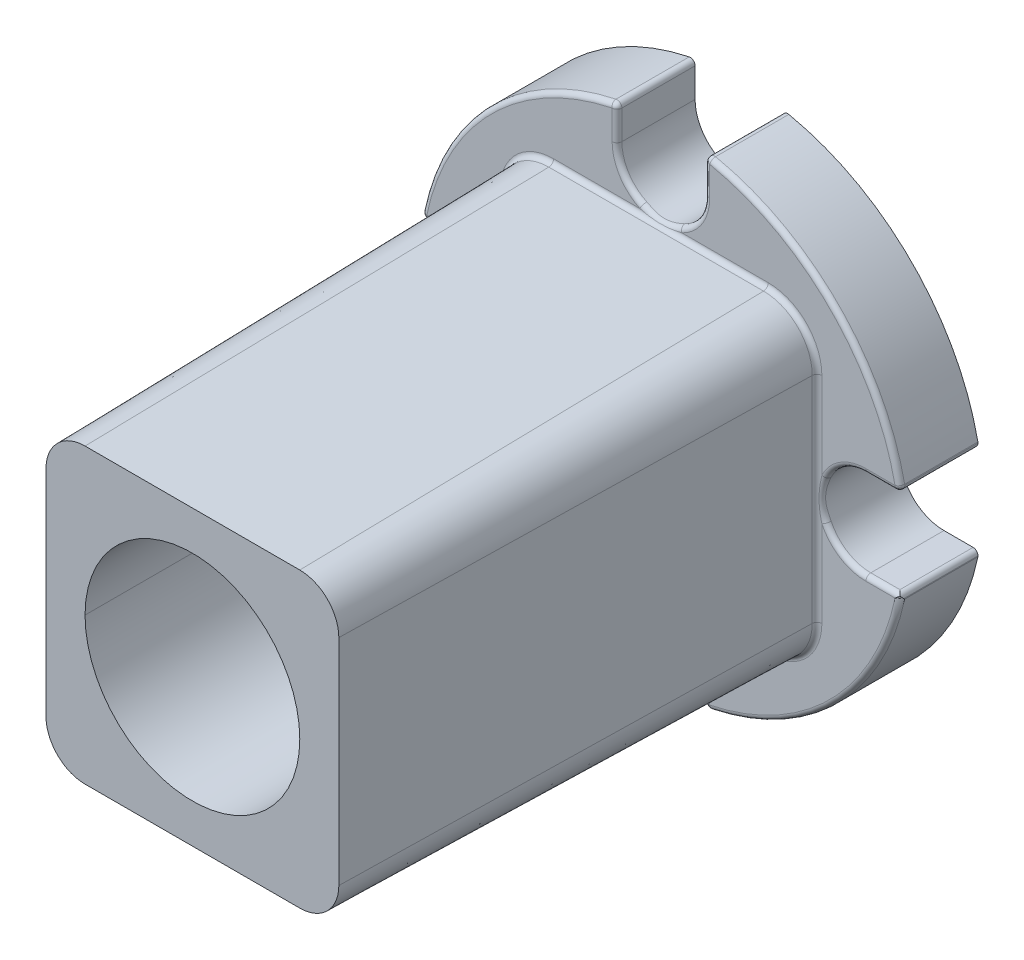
ISO-10303-21;
HEADER;
FILE_DESCRIPTION(('STEP AP214'),'2;1');
FILE_NAME('part.step','',(''),(''),'','','');
FILE_SCHEMA(('AUTOMOTIVE_DESIGN { 1 0 10303 214 1 1 1 1 }'));
ENDSEC;
DATA;
#1=APPLICATION_CONTEXT('core data for automotive mechanical design processes');
#2=APPLICATION_PROTOCOL_DEFINITION('international standard','automotive_design',2000,#1);
#3=PRODUCT_CONTEXT('',#1,'mechanical');
#4=PRODUCT('Part','Part','',(#3));
#5=PRODUCT_RELATED_PRODUCT_CATEGORY('part','',(#4));
#6=PRODUCT_DEFINITION_FORMATION('','',#4);
#7=PRODUCT_DEFINITION_CONTEXT('part definition',#1,'design');
#8=PRODUCT_DEFINITION('design','',#6,#7);
#9=PRODUCT_DEFINITION_SHAPE('','',#8);
#10=(LENGTH_UNIT() NAMED_UNIT(*) SI_UNIT(.MILLI.,.METRE.));
#11=(NAMED_UNIT(*) PLANE_ANGLE_UNIT() SI_UNIT($,.RADIAN.));
#12=(NAMED_UNIT(*) SI_UNIT($,.STERADIAN.) SOLID_ANGLE_UNIT());
#13=UNCERTAINTY_MEASURE_WITH_UNIT(LENGTH_MEASURE(1.E-05),#10,'distance_accuracy_value','');
#14=(GEOMETRIC_REPRESENTATION_CONTEXT(3) GLOBAL_UNCERTAINTY_ASSIGNED_CONTEXT((#13)) GLOBAL_UNIT_ASSIGNED_CONTEXT((#10,
#11,#12)) REPRESENTATION_CONTEXT('',''));
#15=CARTESIAN_POINT('',(0.,0.,0.));
#16=DIRECTION('',(0.,0.,1.));
#17=DIRECTION('',(1.,0.,0.));
#18=AXIS2_PLACEMENT_3D('',#15,#16,#17);
#19=CARTESIAN_POINT('',(23.984369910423,-4.99999999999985,0.));
#20=DIRECTION('',(0.,0.,1.));
#21=DIRECTION('',(1.,0.,0.));
#22=AXIS2_PLACEMENT_3D('',#19,#20,#21);
#23=CYLINDRICAL_SURFACE('',#22,0.5);
#24=CARTESIAN_POINT('',(23.984369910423,-4.99999999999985,0.));
#25=DIRECTION('',(0.,0.,-1.));
#26=DIRECTION('',(-1.,0.,0.));
#27=AXIS2_PLACEMENT_3D('',#24,#25,#26);
#28=CIRCLE('',#27,0.5);
#29=CARTESIAN_POINT('',(24.484369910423,-4.99999999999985,0.));
#30=VERTEX_POINT('',#29);
#31=CARTESIAN_POINT('',(24.4738468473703,-5.10204081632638,0.));
#32=VERTEX_POINT('',#31);
#33=EDGE_CURVE('E616',#30,#32,#28,.T.);
#34=ORIENTED_EDGE('',*,*,#33,.F.);
#35=DIRECTION('',(0.,0.,1.));
#36=VECTOR('',#35,1.);
#37=CARTESIAN_POINT('',(24.484369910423,-4.99999999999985,0.));
#38=LINE('',#37,#36);
#39=CARTESIAN_POINT('',(24.484369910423,-4.99999999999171,7.60103631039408));
#40=VERTEX_POINT('',#39);
#41=EDGE_CURVE('E22',#30,#40,#38,.T.);
#42=ORIENTED_EDGE('',*,*,#41,.T.);
#43=CARTESIAN_POINT('',(24.4738468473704,-5.10204081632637,7.5));
#44=CARTESIAN_POINT('',(24.4747149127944,-5.09787687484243,7.50423903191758));
#45=CARTESIAN_POINT('',(24.4755291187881,-5.09370170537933,7.50847806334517));
#46=CARTESIAN_POINT('',(24.4770498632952,-5.08532909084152,7.51695338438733));
#47=CARTESIAN_POINT('',(24.4777564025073,-5.08113164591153,7.52118967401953));
#48=CARTESIAN_POINT('',(24.4790618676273,-5.07271466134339,7.52965677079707));
#49=CARTESIAN_POINT('',(24.4796607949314,-5.06849512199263,7.53388757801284));
#50=CARTESIAN_POINT('',(24.4807511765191,-5.06003414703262,7.54234097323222));
#51=CARTESIAN_POINT('',(24.4812426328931,-5.05579271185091,7.54656356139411));
#52=CARTESIAN_POINT('',(24.4821182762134,-5.04728815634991,7.55499778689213));
#53=CARTESIAN_POINT('',(24.4825024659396,-5.04302503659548,7.55920942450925));
#54=CARTESIAN_POINT('',(24.4831638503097,-5.03447733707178,7.56761902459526));
#55=CARTESIAN_POINT('',(24.4834410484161,-5.03019275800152,7.57181698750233));
#56=CARTESIAN_POINT('',(24.4838887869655,-5.02160237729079,7.58019652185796));
#57=CARTESIAN_POINT('',(24.4840593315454,-5.01729657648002,7.58437809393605));
#58=CARTESIAN_POINT('',(24.4842941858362,-5.0086640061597,7.59272214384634));
#59=CARTESIAN_POINT('',(24.4843585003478,-5.00433723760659,7.59688462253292));
#60=CARTESIAN_POINT('',(24.4843699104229,-4.99999999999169,7.60103631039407));
#61=B_SPLINE_CURVE_WITH_KNOTS('',3,(#43,#44,#45,#46,#47,#48,#49,#50,#51,#52,#53,#54,#55,#56,#57,
#58,#59,#60),.UNSPECIFIED.,.F.,.F.,(4,2,2,2,2,2,2,2,4),(0.,0.0180150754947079,
0.0360300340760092,0.054044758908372,0.0720591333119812,0.0900730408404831,0.108086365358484,
0.126098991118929,0.144110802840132),.UNSPECIFIED.);
#62=CARTESIAN_POINT('',(24.4738468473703,-5.10204081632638,7.5));
#63=VERTEX_POINT('',#62);
#64=EDGE_CURVE('E1084',#63,#40,#61,.T.);
#65=ORIENTED_EDGE('',*,*,#64,.F.);
#66=DIRECTION('',(0.,0.,1.));
#67=VECTOR('',#66,1.);
#68=CARTESIAN_POINT('',(24.4738468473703,-5.10204081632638,0.));
#69=LINE('',#68,#67);
#70=EDGE_CURVE('E1026',#32,#63,#69,.T.);
#71=ORIENTED_EDGE('',*,*,#70,.F.);
#72=EDGE_LOOP('',(#34,#42,#65,#71));
#73=FACE_BOUND('',#72,.T.);
#74=ADVANCED_FACE('F14',(#73),#23,.T.);
#75=CARTESIAN_POINT('',(23.9843699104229,5.00000000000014,0.));
#76=DIRECTION('',(0.,0.,1.));
#77=DIRECTION('',(1.,0.,0.));
#78=AXIS2_PLACEMENT_3D('',#75,#76,#77);
#79=CYLINDRICAL_SURFACE('',#78,0.5);
#80=CARTESIAN_POINT('',(23.9843699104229,5.00000000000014,0.));
#81=DIRECTION('',(0.,0.,-1.));
#82=DIRECTION('',(-1.,0.,0.));
#83=AXIS2_PLACEMENT_3D('',#80,#81,#82);
#84=CIRCLE('',#83,0.5);
#85=CARTESIAN_POINT('',(24.4843699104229,5.00000000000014,0.));
#86=VERTEX_POINT('',#85);
#87=CARTESIAN_POINT('',(23.9843699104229,4.50000000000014,0.));
#88=VERTEX_POINT('',#87);
#89=EDGE_CURVE('E626',#86,#88,#84,.T.);
#90=ORIENTED_EDGE('',*,*,#89,.F.);
#91=DIRECTION('',(0.,0.,1.));
#92=VECTOR('',#91,1.);
#93=CARTESIAN_POINT('',(24.4843699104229,5.00000000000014,0.));
#94=LINE('',#93,#92);
#95=CARTESIAN_POINT('',(24.4843699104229,5.00000000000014,7.5));
#96=VERTEX_POINT('',#95);
#97=EDGE_CURVE('E1046',#86,#96,#94,.T.);
#98=ORIENTED_EDGE('',*,*,#97,.T.);
#99=CARTESIAN_POINT('',(23.9843699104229,5.00000000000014,7.5));
#100=DIRECTION('',(0.,0.,1.));
#101=DIRECTION('',(1.,0.,0.));
#102=AXIS2_PLACEMENT_3D('',#99,#100,#101);
#103=CIRCLE('',#102,0.5);
#104=CARTESIAN_POINT('',(23.9843699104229,4.50000000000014,7.5));
#105=VERTEX_POINT('',#104);
#106=EDGE_CURVE('E569',#105,#96,#103,.T.);
#107=ORIENTED_EDGE('',*,*,#106,.F.);
#108=DIRECTION('',(0.,0.,1.));
#109=VECTOR('',#108,1.);
#110=CARTESIAN_POINT('',(23.9843699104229,4.50000000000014,0.));
#111=LINE('',#110,#109);
#112=EDGE_CURVE('E1337',#88,#105,#111,.T.);
#113=ORIENTED_EDGE('',*,*,#112,.F.);
#114=EDGE_LOOP('',(#90,#98,#107,#113));
#115=FACE_BOUND('',#114,.T.);
#116=ADVANCED_FACE('F905',(#115),#79,.T.);
#117=CARTESIAN_POINT('',(-23.9843699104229,5.,7.5));
#118=DIRECTION('',(0.,1.,0.));
#119=DIRECTION('',(-1.,0.,0.));
#120=AXIS2_PLACEMENT_3D('',#117,#118,#119);
#121=SPHERICAL_SURFACE('',#120,0.5);
#122=CARTESIAN_POINT('',(-23.9843699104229,5.,7.5));
#123=DIRECTION('',(1.,0.,0.));
#124=DIRECTION('',(0.,0.,1.));
#125=AXIS2_PLACEMENT_3D('',#122,#123,#124);
#126=CIRCLE('',#125,0.5);
#127=CARTESIAN_POINT('',(-23.9843699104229,5.,8.));
#128=VERTEX_POINT('',#127);
#129=CARTESIAN_POINT('',(-23.9843699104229,4.5,7.5));
#130=VERTEX_POINT('',#129);
#131=EDGE_CURVE('E582',#128,#130,#126,.T.);
#132=ORIENTED_EDGE('',*,*,#131,.F.);
#133=CARTESIAN_POINT('',(-23.9843699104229,5.,7.5));
#134=DIRECTION('',(0.,-1.,0.));
#135=DIRECTION('',(0.,0.,1.));
#136=AXIS2_PLACEMENT_3D('',#133,#134,#135);
#137=CIRCLE('',#136,0.5);
#138=CARTESIAN_POINT('',(-24.4843699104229,5.,7.5));
#139=VERTEX_POINT('',#138);
#140=EDGE_CURVE('E549',#128,#139,#137,.T.);
#141=ORIENTED_EDGE('',*,*,#140,.T.);
#142=CARTESIAN_POINT('',(-23.9843699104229,5.,7.5));
#143=DIRECTION('',(0.,0.,-1.));
#144=DIRECTION('',(-1.,0.,0.));
#145=AXIS2_PLACEMENT_3D('',#142,#143,#144);
#146=CIRCLE('',#145,0.5);
#147=EDGE_CURVE('E1236',#130,#139,#146,.T.);
#148=ORIENTED_EDGE('',*,*,#147,.F.);
#149=EDGE_LOOP('',(#132,#141,#148));
#150=FACE_BOUND('',#149,.T.);
#151=ADVANCED_FACE('F902',(#150),#121,.T.);
#152=CARTESIAN_POINT('',(-23.9843699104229,-5.,7.5));
#153=DIRECTION('',(0.,1.,0.));
#154=DIRECTION('',(-1.,0.,0.));
#155=AXIS2_PLACEMENT_3D('',#152,#153,#154);
#156=SPHERICAL_SURFACE('',#155,0.5);
#157=CARTESIAN_POINT('',(-23.9843699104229,-5.,7.5));
#158=DIRECTION('',(0.20408163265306,-0.978953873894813,0.));
#159=DIRECTION('',(0.978953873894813,0.20408163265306,0.));
#160=AXIS2_PLACEMENT_3D('',#157,#158,#159);
#161=CIRCLE('',#160,0.5);
#162=CARTESIAN_POINT('',(-23.9843699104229,-5.,8.));
#163=VERTEX_POINT('',#162);
#164=CARTESIAN_POINT('',(-24.4738468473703,-5.10204081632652,7.5));
#165=VERTEX_POINT('',#164);
#166=EDGE_CURVE('E1128',#163,#165,#161,.T.);
#167=ORIENTED_EDGE('',*,*,#166,.F.);
#168=CARTESIAN_POINT('',(-23.9843699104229,-5.,7.5));
#169=DIRECTION('',(0.,-1.,0.));
#170=DIRECTION('',(0.,0.,1.));
#171=AXIS2_PLACEMENT_3D('',#168,#169,#170);
#172=CIRCLE('',#171,0.5);
#173=CARTESIAN_POINT('',(-24.4843699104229,-5.,7.5));
#174=VERTEX_POINT('',#173);
#175=EDGE_CURVE('E540',#163,#174,#172,.T.);
#176=ORIENTED_EDGE('',*,*,#175,.T.);
#177=CARTESIAN_POINT('',(-23.9843699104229,-5.,7.5));
#178=DIRECTION('',(0.,0.,-1.));
#179=DIRECTION('',(-1.,0.,0.));
#180=AXIS2_PLACEMENT_3D('',#177,#178,#179);
#181=CIRCLE('',#180,0.5);
#182=EDGE_CURVE('E592',#165,#174,#181,.T.);
#183=ORIENTED_EDGE('',*,*,#182,.F.);
#184=EDGE_LOOP('',(#167,#176,#183));
#185=FACE_BOUND('',#184,.T.);
#186=ADVANCED_FACE('F883',(#185),#156,.T.);
#187=CARTESIAN_POINT('',(0.,0.,1.));
#188=DIRECTION('',(0.,0.,-1.));
#189=DIRECTION('',(-1.,0.,0.));
#190=AXIS2_PLACEMENT_3D('',#187,#188,#189);
#191=CONICAL_SURFACE('',#190,4.2,0.78539816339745);
#192=DIRECTION('',(-0.707106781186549,0.,-0.707106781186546));
#193=VECTOR('',#192,1.);
#194=CARTESIAN_POINT('',(-4.2,0.,1.));
#195=LINE('',#194,#193);
#196=CARTESIAN_POINT('',(-4.,0.,1.2));
#197=VERTEX_POINT('',#196);
#198=CARTESIAN_POINT('',(-4.2,0.,1.));
#199=VERTEX_POINT('',#198);
#200=EDGE_CURVE('E532',#197,#199,#195,.T.);
#201=ORIENTED_EDGE('',*,*,#200,.F.);
#202=CARTESIAN_POINT('',(0.,0.,1.2));
#203=DIRECTION('',(0.,0.,-1.));
#204=DIRECTION('',(-1.,0.,0.));
#205=AXIS2_PLACEMENT_3D('',#202,#203,#204);
#206=CIRCLE('',#205,4.);
#207=CARTESIAN_POINT('',(4.,0.,1.2));
#208=VERTEX_POINT('',#207);
#209=EDGE_CURVE('E28',#197,#208,#206,.F.);
#210=ORIENTED_EDGE('',*,*,#209,.T.);
#211=DIRECTION('',(0.707106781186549,0.,-0.707106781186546));
#212=VECTOR('',#211,1.);
#213=CARTESIAN_POINT('',(4.2,0.,1.));
#214=LINE('',#213,#212);
#215=CARTESIAN_POINT('',(4.2,0.,1.));
#216=VERTEX_POINT('',#215);
#217=EDGE_CURVE('E530',#208,#216,#214,.T.);
#218=ORIENTED_EDGE('',*,*,#217,.T.);
#219=CARTESIAN_POINT('',(0.,0.,1.));
#220=DIRECTION('',(0.,0.,-1.));
#221=DIRECTION('',(-1.,0.,0.));
#222=AXIS2_PLACEMENT_3D('',#219,#220,#221);
#223=CIRCLE('',#222,4.2);
#224=EDGE_CURVE('E541',#216,#199,#223,.T.);
#225=ORIENTED_EDGE('',*,*,#224,.T.);
#226=EDGE_LOOP('',(#201,#210,#218,#225));
#227=FACE_BOUND('',#226,.T.);
#228=ADVANCED_FACE('F528',(#227),#191,.F.);
#229=CARTESIAN_POINT('',(0.,0.,11.));
#230=DIRECTION('',(0.,0.,1.));
#231=DIRECTION('',(1.,0.,0.));
#232=AXIS2_PLACEMENT_3D('',#229,#230,#231);
#233=CYLINDRICAL_SURFACE('',#232,11.);
#234=DIRECTION('',(0.,0.,1.));
#235=VECTOR('',#234,1.);
#236=CARTESIAN_POINT('',(11.,0.,11.));
#237=LINE('',#236,#235);
#238=CARTESIAN_POINT('',(11.,0.,32.));
#239=VERTEX_POINT('',#238);
#240=CARTESIAN_POINT('',(11.,0.,56.));
#241=VERTEX_POINT('',#240);
#242=EDGE_CURVE('E697',#239,#241,#237,.T.);
#243=ORIENTED_EDGE('',*,*,#242,.F.);
#244=CARTESIAN_POINT('',(0.,0.,32.));
#245=DIRECTION('',(0.,0.,1.));
#246=DIRECTION('',(1.,0.,0.));
#247=AXIS2_PLACEMENT_3D('',#244,#245,#246);
#248=CIRCLE('',#247,11.);
#249=CARTESIAN_POINT('',(-11.,0.,32.));
#250=VERTEX_POINT('',#249);
#251=EDGE_CURVE('E34',#250,#239,#248,.T.);
#252=ORIENTED_EDGE('',*,*,#251,.F.);
#253=DIRECTION('',(0.,0.,1.));
#254=VECTOR('',#253,1.);
#255=CARTESIAN_POINT('',(-11.,0.,11.));
#256=LINE('',#255,#254);
#257=CARTESIAN_POINT('',(-11.,0.,56.));
#258=VERTEX_POINT('',#257);
#259=EDGE_CURVE('E552',#250,#258,#256,.T.);
#260=ORIENTED_EDGE('',*,*,#259,.T.);
#261=CARTESIAN_POINT('',(0.,0.,56.));
#262=DIRECTION('',(0.,0.,1.));
#263=DIRECTION('',(1.,0.,0.));
#264=AXIS2_PLACEMENT_3D('',#261,#262,#263);
#265=CIRCLE('',#264,11.);
#266=EDGE_CURVE('E611',#258,#241,#265,.T.);
#267=ORIENTED_EDGE('',*,*,#266,.T.);
#268=EDGE_LOOP('',(#243,#252,#260,#267));
#269=FACE_BOUND('',#268,.T.);
#270=ADVANCED_FACE('F882',(#269),#233,.F.);
#271=CARTESIAN_POINT('',(0.,0.,1.));
#272=DIRECTION('',(0.,0.,-1.));
#273=DIRECTION('',(-1.,0.,0.));
#274=AXIS2_PLACEMENT_3D('',#271,#272,#273);
#275=CYLINDRICAL_SURFACE('',#274,15.);
#276=CARTESIAN_POINT('',(0.,0.,1.));
#277=DIRECTION('',(0.,0.,-1.));
#278=DIRECTION('',(-1.,0.,0.));
#279=AXIS2_PLACEMENT_3D('',#276,#277,#278);
#280=CIRCLE('',#279,15.);
#281=CARTESIAN_POINT('',(15.,0.,1.));
#282=VERTEX_POINT('',#281);
#283=CARTESIAN_POINT('',(-15.,0.,1.));
#284=VERTEX_POINT('',#283);
#285=EDGE_CURVE('E1367',#282,#284,#280,.T.);
#286=ORIENTED_EDGE('',*,*,#285,.F.);
#287=DIRECTION('',(0.,0.,-1.));
#288=VECTOR('',#287,1.);
#289=CARTESIAN_POINT('',(15.,0.,1.));
#290=LINE('',#289,#288);
#291=CARTESIAN_POINT('',(15.,0.,0.));
#292=VERTEX_POINT('',#291);
#293=EDGE_CURVE('E615',#282,#292,#290,.T.);
#294=ORIENTED_EDGE('',*,*,#293,.T.);
#295=CARTESIAN_POINT('',(0.,0.,0.));
#296=DIRECTION('',(0.,0.,-1.));
#297=DIRECTION('',(-1.,0.,0.));
#298=AXIS2_PLACEMENT_3D('',#295,#296,#297);
#299=CIRCLE('',#298,15.);
#300=CARTESIAN_POINT('',(-15.,0.,0.));
#301=VERTEX_POINT('',#300);
#302=EDGE_CURVE('E632',#292,#301,#299,.T.);
#303=ORIENTED_EDGE('',*,*,#302,.T.);
#304=DIRECTION('',(0.,0.,-1.));
#305=VECTOR('',#304,1.);
#306=CARTESIAN_POINT('',(-15.,0.,1.));
#307=LINE('',#306,#305);
#308=EDGE_CURVE('E1201',#284,#301,#307,.T.);
#309=ORIENTED_EDGE('',*,*,#308,.F.);
#310=EDGE_LOOP('',(#286,#294,#303,#309));
#311=FACE_BOUND('',#310,.T.);
#312=ADVANCED_FACE('F784',(#311),#275,.F.);
#313=CARTESIAN_POINT('',(-21.,0.,0.));
#314=DIRECTION('',(0.,0.,1.));
#315=DIRECTION('',(1.,0.,0.));
#316=AXIS2_PLACEMENT_3D('',#313,#314,#315);
#317=CYLINDRICAL_SURFACE('',#316,4.5);
#318=CARTESIAN_POINT('',(-21.,0.,0.));
#319=DIRECTION('',(0.,0.,1.));
#320=DIRECTION('',(-1.,0.,0.));
#321=AXIS2_PLACEMENT_3D('',#318,#319,#320);
#322=CIRCLE('',#321,4.5);
#323=CARTESIAN_POINT('',(-16.5,0.,0.));
#324=VERTEX_POINT('',#323);
#325=CARTESIAN_POINT('',(-21.,4.5,0.));
#326=VERTEX_POINT('',#325);
#327=EDGE_CURVE('E1298',#324,#326,#322,.T.);
#328=ORIENTED_EDGE('',*,*,#327,.F.);
#329=DIRECTION('',(0.,0.,1.));
#330=VECTOR('',#329,1.);
#331=CARTESIAN_POINT('',(-16.5,0.,0.));
#332=LINE('',#331,#330);
#333=CARTESIAN_POINT('',(-16.5,0.,7.62810441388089));
#334=VERTEX_POINT('',#333);
#335=EDGE_CURVE('E636',#324,#334,#332,.T.);
#336=ORIENTED_EDGE('',*,*,#335,.T.);
#337=CARTESIAN_POINT('',(-16.9407226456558,1.94223257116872,7.5));
#338=CARTESIAN_POINT('',(-16.9224982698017,1.90414623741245,7.49999833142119));
#339=CARTESIAN_POINT('',(-16.9048046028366,1.86581026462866,7.50057514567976));
#340=CARTESIAN_POINT('',(-16.8705716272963,1.78882999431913,7.50272544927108));
#341=CARTESIAN_POINT('',(-16.8540281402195,1.75018744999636,7.50429509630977));
#342=CARTESIAN_POINT('',(-16.8220882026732,1.67258932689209,7.50826815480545));
#343=CARTESIAN_POINT('',(-16.8066889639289,1.63363478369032,7.51066945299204));
#344=CARTESIAN_POINT('',(-16.777027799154,1.55540598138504,7.51614129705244));
#345=CARTESIAN_POINT('',(-16.7627642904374,1.51613225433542,7.51921088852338));
#346=CARTESIAN_POINT('',(-16.735365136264,1.43725831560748,7.52585532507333));
#347=CARTESIAN_POINT('',(-16.7222289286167,1.39765827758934,7.52942991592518));
#348=CARTESIAN_POINT('',(-16.6970774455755,1.31812604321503,7.53692313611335));
#349=CARTESIAN_POINT('',(-16.6850624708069,1.27819376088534,7.54084185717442));
#350=CARTESIAN_POINT('',(-16.6506540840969,1.15781015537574,7.55286587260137));
#351=CARTESIAN_POINT('',(-16.6299409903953,1.07689830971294,7.56122730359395));
#352=CARTESIAN_POINT('',(-16.5929432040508,0.913638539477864,7.57743873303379));
#353=CARTESIAN_POINT('',(-16.5766783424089,0.831285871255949,7.58528632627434));
#354=CARTESIAN_POINT('',(-16.5557246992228,0.707089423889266,7.59605291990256));
#355=CARTESIAN_POINT('',(-16.5493134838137,0.66557392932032,7.59947469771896));
#356=CARTESIAN_POINT('',(-16.5376691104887,0.582478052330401,7.60585060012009));
#357=CARTESIAN_POINT('',(-16.5324322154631,0.540898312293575,7.60880619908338));
#358=CARTESIAN_POINT('',(-16.5231436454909,0.457739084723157,7.61413156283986));
#359=CARTESIAN_POINT('',(-16.5190872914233,0.416160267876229,7.616503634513));
#360=CARTESIAN_POINT('',(-16.5121392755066,0.332981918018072,7.62062099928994));
#361=CARTESIAN_POINT('',(-16.5092446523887,0.291382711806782,7.62236788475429));
#362=CARTESIAN_POINT('',(-16.5046187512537,0.208163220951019,7.6251946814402));
#363=CARTESIAN_POINT('',(-16.5028856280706,0.166543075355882,7.62627565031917));
#364=CARTESIAN_POINT('',(-16.5005762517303,0.083282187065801,7.62773056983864));
#365=CARTESIAN_POINT('',(-16.4999993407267,0.0416414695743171,7.62810492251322));
#366=CARTESIAN_POINT('',(-16.499999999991,0.,7.62810441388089));
#367=B_SPLINE_CURVE_WITH_KNOTS('',3,(#337,#338,#339,#340,#341,#342,#343,#344,#345,#346,#347,
#348,#349,#350,#351,#352,#353,#354,#355,#356,#357,#358,#359,#360,#361,#362,#363,#364,#365,#366),
.UNSPECIFIED.,.F.,.F.,(4,2,2,2,2,2,2,2,2,2,2,2,2,2,4),(0.,0.126652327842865,0.252817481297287,
0.378664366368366,0.504332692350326,0.629937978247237,0.755576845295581,1.00725637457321,
1.26004029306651,1.38646511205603,1.51248170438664,1.63799180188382,1.76317990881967,
1.88816866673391,2.01308628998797),.UNSPECIFIED.);
#368=CARTESIAN_POINT('',(-16.9407226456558,1.94223257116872,7.5));
#369=VERTEX_POINT('',#368);
#370=EDGE_CURVE('E766',#334,#369,#367,.F.);
#371=ORIENTED_EDGE('',*,*,#370,.T.);
#372=CARTESIAN_POINT('',(-21.,0.,7.5));
#373=DIRECTION('',(0.,0.,1.));
#374=DIRECTION('',(-1.,0.,0.));
#375=AXIS2_PLACEMENT_3D('',#372,#373,#374);
#376=CIRCLE('',#375,4.5);
#377=CARTESIAN_POINT('',(-21.,4.5,7.5));
#378=VERTEX_POINT('',#377);
#379=EDGE_CURVE('E1523',#369,#378,#376,.T.);
#380=ORIENTED_EDGE('',*,*,#379,.T.);
#381=DIRECTION('',(0.,0.,1.));
#382=VECTOR('',#381,1.);
#383=CARTESIAN_POINT('',(-21.,4.5,0.));
#384=LINE('',#383,#382);
#385=EDGE_CURVE('E726',#326,#378,#384,.T.);
#386=ORIENTED_EDGE('',*,*,#385,.F.);
#387=EDGE_LOOP('',(#328,#336,#371,#380,#386));
#388=FACE_BOUND('',#387,.T.);
#389=ADVANCED_FACE('F773',(#388),#317,.F.);
#390=CARTESIAN_POINT('',(0.,0.,8.));
#391=DIRECTION('',(0.,0.,-1.));
#392=DIRECTION('',(-1.,0.,0.));
#393=AXIS2_PLACEMENT_3D('',#390,#391,#392);
#394=PLANE('',#393);
#395=CARTESIAN_POINT('',(0.,21.,8.));
#396=DIRECTION('',(0.,0.,-1.));
#397=DIRECTION('',(-1.,0.,0.));
#398=AXIS2_PLACEMENT_3D('',#395,#396,#397);
#399=CIRCLE('',#398,5.);
#400=CARTESIAN_POINT('',(-2.15803619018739,16.4896918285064,8.));
#401=VERTEX_POINT('',#400);
#402=CARTESIAN_POINT('',(-5.00000000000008,21.,8.));
#403=VERTEX_POINT('',#402);
#404=EDGE_CURVE('E1215',#401,#403,#399,.T.);
#405=ORIENTED_EDGE('',*,*,#404,.T.);
#406=DIRECTION('',(0.,1.,0.));
#407=VECTOR('',#406,1.);
#408=CARTESIAN_POINT('',(-5.,0.,8.));
#409=LINE('',#408,#407);
#410=CARTESIAN_POINT('',(-5.00000000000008,23.9843699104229,8.));
#411=VERTEX_POINT('',#410);
#412=EDGE_CURVE('E1171',#403,#411,#409,.T.);
#413=ORIENTED_EDGE('',*,*,#412,.T.);
#414=CARTESIAN_POINT('',(0.,0.,8.));
#415=DIRECTION('',(0.,0.,1.));
#416=DIRECTION('',(-1.,0.,0.));
#417=AXIS2_PLACEMENT_3D('',#414,#415,#416);
#418=CIRCLE('',#417,24.5);
#419=EDGE_CURVE('E1147',#411,#128,#418,.T.);
#420=ORIENTED_EDGE('',*,*,#419,.T.);
#421=DIRECTION('',(1.,0.,0.));
#422=VECTOR('',#421,1.);
#423=CARTESIAN_POINT('',(0.,5.,8.));
#424=LINE('',#423,#422);
#425=CARTESIAN_POINT('',(-21.,5.,8.));
#426=VERTEX_POINT('',#425);
#427=EDGE_CURVE('E1143',#128,#426,#424,.T.);
#428=ORIENTED_EDGE('',*,*,#427,.T.);
#429=CARTESIAN_POINT('',(-21.,0.,8.));
#430=DIRECTION('',(0.,0.,-1.));
#431=DIRECTION('',(-1.,0.,0.));
#432=AXIS2_PLACEMENT_3D('',#429,#430,#431);
#433=CIRCLE('',#432,5.);
#434=CARTESIAN_POINT('',(-16.4896918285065,2.15803619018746,8.));
#435=VERTEX_POINT('',#434);
#436=EDGE_CURVE('E1148',#426,#435,#433,.T.);
#437=ORIENTED_EDGE('',*,*,#436,.T.);
#438=DIRECTION('',(0.,1.,0.));
#439=VECTOR('',#438,1.);
#440=CARTESIAN_POINT('',(-16.4896918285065,11.,8.));
#441=LINE('',#440,#439);
#442=CARTESIAN_POINT('',(-16.4896918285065,11.,8.));
#443=VERTEX_POINT('',#442);
#444=EDGE_CURVE('E574',#435,#443,#441,.T.);
#445=ORIENTED_EDGE('',*,*,#444,.T.);
#446=CARTESIAN_POINT('',(-11.,11.,8.));
#447=DIRECTION('',(0.,0.,-1.));
#448=DIRECTION('',(-1.,0.,0.));
#449=AXIS2_PLACEMENT_3D('',#446,#447,#448);
#450=CIRCLE('',#449,5.48969182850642);
#451=CARTESIAN_POINT('',(-11.,16.4896918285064,8.));
#452=VERTEX_POINT('',#451);
#453=EDGE_CURVE('E570',#443,#452,#450,.T.);
#454=ORIENTED_EDGE('',*,*,#453,.T.);
#455=DIRECTION('',(1.,0.,0.));
#456=VECTOR('',#455,1.);
#457=CARTESIAN_POINT('',(11.,16.4896918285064,8.));
#458=LINE('',#457,#456);
#459=EDGE_CURVE('E575',#452,#401,#458,.T.);
#460=ORIENTED_EDGE('',*,*,#459,.T.);
#461=EDGE_LOOP('',(#405,#413,#420,#428,#437,#445,#454,#460));
#462=FACE_BOUND('',#461,.T.);
#463=ADVANCED_FACE('F783',(#462),#394,.F.);
#464=CARTESIAN_POINT('',(0.,0.,8.));
#465=DIRECTION('',(0.,0.,-1.));
#466=DIRECTION('',(-1.,0.,0.));
#467=AXIS2_PLACEMENT_3D('',#464,#465,#466);
#468=PLANE('',#467);
#469=CARTESIAN_POINT('',(-21.,0.,8.));
#470=DIRECTION('',(0.,0.,-1.));
#471=DIRECTION('',(-1.,0.,0.));
#472=AXIS2_PLACEMENT_3D('',#469,#470,#471);
#473=CIRCLE('',#472,5.);
#474=CARTESIAN_POINT('',(-16.4896918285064,-2.15803619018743,8.));
#475=VERTEX_POINT('',#474);
#476=CARTESIAN_POINT('',(-21.,-5.,8.));
#477=VERTEX_POINT('',#476);
#478=EDGE_CURVE('E1392',#475,#477,#473,.T.);
#479=ORIENTED_EDGE('',*,*,#478,.T.);
#480=DIRECTION('',(-1.,0.,0.));
#481=VECTOR('',#480,1.);
#482=CARTESIAN_POINT('',(0.,-5.00000000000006,8.));
#483=LINE('',#482,#481);
#484=EDGE_CURVE('E1176',#477,#163,#483,.T.);
#485=ORIENTED_EDGE('',*,*,#484,.T.);
#486=CARTESIAN_POINT('',(0.,0.,8.));
#487=DIRECTION('',(0.,0.,1.));
#488=DIRECTION('',(-1.,0.,0.));
#489=AXIS2_PLACEMENT_3D('',#486,#487,#488);
#490=CIRCLE('',#489,24.5);
#491=CARTESIAN_POINT('',(-5.00000000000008,-23.9843699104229,8.));
#492=VERTEX_POINT('',#491);
#493=EDGE_CURVE('E1172',#163,#492,#490,.T.);
#494=ORIENTED_EDGE('',*,*,#493,.T.);
#495=DIRECTION('',(0.,1.,0.));
#496=VECTOR('',#495,1.);
#497=CARTESIAN_POINT('',(-5.00000000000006,0.,8.));
#498=LINE('',#497,#496);
#499=CARTESIAN_POINT('',(-5.00000000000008,-21.,8.));
#500=VERTEX_POINT('',#499);
#501=EDGE_CURVE('E1177',#492,#500,#498,.T.);
#502=ORIENTED_EDGE('',*,*,#501,.T.);
#503=CARTESIAN_POINT('',(0.,-21.,8.));
#504=DIRECTION('',(0.,0.,-1.));
#505=DIRECTION('',(-1.,0.,0.));
#506=AXIS2_PLACEMENT_3D('',#503,#504,#505);
#507=CIRCLE('',#506,5.);
#508=CARTESIAN_POINT('',(-2.15803619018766,-16.4896918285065,8.));
#509=VERTEX_POINT('',#508);
#510=EDGE_CURVE('E1240',#500,#509,#507,.T.);
#511=ORIENTED_EDGE('',*,*,#510,.T.);
#512=DIRECTION('',(-1.,0.,0.));
#513=VECTOR('',#512,1.);
#514=CARTESIAN_POINT('',(-11.,-16.4896918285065,8.));
#515=LINE('',#514,#513);
#516=CARTESIAN_POINT('',(-11.,-16.4896918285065,8.));
#517=VERTEX_POINT('',#516);
#518=EDGE_CURVE('E1350',#509,#517,#515,.T.);
#519=ORIENTED_EDGE('',*,*,#518,.T.);
#520=CARTESIAN_POINT('',(-11.,-11.0000000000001,8.));
#521=DIRECTION('',(0.,0.,-1.));
#522=DIRECTION('',(-1.,0.,0.));
#523=AXIS2_PLACEMENT_3D('',#520,#521,#522);
#524=CIRCLE('',#523,5.48969182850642);
#525=CARTESIAN_POINT('',(-16.4896918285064,-11.0000000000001,8.));
#526=VERTEX_POINT('',#525);
#527=EDGE_CURVE('E1346',#517,#526,#524,.T.);
#528=ORIENTED_EDGE('',*,*,#527,.T.);
#529=DIRECTION('',(0.,1.,0.));
#530=VECTOR('',#529,1.);
#531=CARTESIAN_POINT('',(-16.4896918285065,11.,8.));
#532=LINE('',#531,#530);
#533=EDGE_CURVE('E734',#526,#475,#532,.T.);
#534=ORIENTED_EDGE('',*,*,#533,.T.);
#535=EDGE_LOOP('',(#479,#485,#494,#502,#511,#519,#528,#534));
#536=FACE_BOUND('',#535,.T.);
#537=ADVANCED_FACE('F1616',(#536),#468,.F.);
#538=CARTESIAN_POINT('',(0.,0.,8.));
#539=DIRECTION('',(0.,0.,-1.));
#540=DIRECTION('',(-1.,0.,0.));
#541=AXIS2_PLACEMENT_3D('',#538,#539,#540);
#542=PLANE('',#541);
#543=DIRECTION('',(0.,-1.,0.));
#544=VECTOR('',#543,1.);
#545=CARTESIAN_POINT('',(5.,0.,8.));
#546=LINE('',#545,#544);
#547=CARTESIAN_POINT('',(4.99999999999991,23.984369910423,8.));
#548=VERTEX_POINT('',#547);
#549=CARTESIAN_POINT('',(4.99999999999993,21.,8.));
#550=VERTEX_POINT('',#549);
#551=EDGE_CURVE('E730',#548,#550,#546,.T.);
#552=ORIENTED_EDGE('',*,*,#551,.T.);
#553=CARTESIAN_POINT('',(0.,21.,8.));
#554=DIRECTION('',(0.,0.,-1.));
#555=DIRECTION('',(-1.,0.,0.));
#556=AXIS2_PLACEMENT_3D('',#553,#554,#555);
#557=CIRCLE('',#556,5.);
#558=CARTESIAN_POINT('',(2.15803619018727,16.4896918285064,8.));
#559=VERTEX_POINT('',#558);
#560=EDGE_CURVE('E735',#550,#559,#557,.T.);
#561=ORIENTED_EDGE('',*,*,#560,.T.);
#562=DIRECTION('',(1.,0.,0.));
#563=VECTOR('',#562,1.);
#564=CARTESIAN_POINT('',(11.,16.4896918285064,8.));
#565=LINE('',#564,#563);
#566=CARTESIAN_POINT('',(11.,16.4896918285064,8.));
#567=VERTEX_POINT('',#566);
#568=EDGE_CURVE('E1317',#559,#567,#565,.T.);
#569=ORIENTED_EDGE('',*,*,#568,.T.);
#570=CARTESIAN_POINT('',(11.,11.,8.));
#571=DIRECTION('',(0.,0.,-1.));
#572=DIRECTION('',(-1.,0.,0.));
#573=AXIS2_PLACEMENT_3D('',#570,#571,#572);
#574=CIRCLE('',#573,5.48969182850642);
#575=CARTESIAN_POINT('',(16.4896918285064,11.,8.));
#576=VERTEX_POINT('',#575);
#577=EDGE_CURVE('E846',#567,#576,#574,.T.);
#578=ORIENTED_EDGE('',*,*,#577,.T.);
#579=DIRECTION('',(0.,-1.,0.));
#580=VECTOR('',#579,1.);
#581=CARTESIAN_POINT('',(16.4896918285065,-11.,8.));
#582=LINE('',#581,#580);
#583=CARTESIAN_POINT('',(16.4896918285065,2.15803619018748,8.));
#584=VERTEX_POINT('',#583);
#585=EDGE_CURVE('E839',#576,#584,#582,.T.);
#586=ORIENTED_EDGE('',*,*,#585,.T.);
#587=CARTESIAN_POINT('',(21.,0.,8.));
#588=DIRECTION('',(0.,0.,-1.));
#589=DIRECTION('',(-1.,0.,0.));
#590=AXIS2_PLACEMENT_3D('',#587,#588,#589);
#591=CIRCLE('',#590,5.);
#592=CARTESIAN_POINT('',(21.,5.,8.));
#593=VERTEX_POINT('',#592);
#594=EDGE_CURVE('E835',#584,#593,#591,.T.);
#595=ORIENTED_EDGE('',*,*,#594,.T.);
#596=DIRECTION('',(1.,0.,0.));
#597=VECTOR('',#596,1.);
#598=CARTESIAN_POINT('',(-2.31833205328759E-13,4.99999999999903,8.));
#599=LINE('',#598,#597);
#600=CARTESIAN_POINT('',(23.9843699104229,5.00000000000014,8.));
#601=VERTEX_POINT('',#600);
#602=EDGE_CURVE('E840',#593,#601,#599,.T.);
#603=ORIENTED_EDGE('',*,*,#602,.T.);
#604=CARTESIAN_POINT('',(0.,0.,8.));
#605=DIRECTION('',(0.,0.,1.));
#606=DIRECTION('',(-1.,0.,0.));
#607=AXIS2_PLACEMENT_3D('',#604,#605,#606);
#608=CIRCLE('',#607,24.5);
#609=EDGE_CURVE('E1257',#601,#548,#608,.T.);
#610=ORIENTED_EDGE('',*,*,#609,.T.);
#611=EDGE_LOOP('',(#552,#561,#569,#578,#586,#595,#603,#610));
#612=FACE_BOUND('',#611,.T.);
#613=ADVANCED_FACE('F911',(#612),#542,.F.);
#614=CARTESIAN_POINT('',(0.,0.,8.));
#615=DIRECTION('',(0.,0.,-1.));
#616=DIRECTION('',(-1.,0.,0.));
#617=AXIS2_PLACEMENT_3D('',#614,#615,#616);
#618=PLANE('',#617);
#619=DIRECTION('',(-1.,0.,0.));
#620=VECTOR('',#619,1.);
#621=CARTESIAN_POINT('',(-11.,-16.4896918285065,8.));
#622=LINE('',#621,#620);
#623=CARTESIAN_POINT('',(11.0000000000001,-16.4896918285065,8.));
#624=VERTEX_POINT('',#623);
#625=CARTESIAN_POINT('',(2.15803619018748,-16.4896918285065,8.));
#626=VERTEX_POINT('',#625);
#627=EDGE_CURVE('E1321',#624,#626,#622,.T.);
#628=ORIENTED_EDGE('',*,*,#627,.T.);
#629=CARTESIAN_POINT('',(0.,-21.,8.));
#630=DIRECTION('',(0.,0.,-1.));
#631=DIRECTION('',(-1.,0.,0.));
#632=AXIS2_PLACEMENT_3D('',#629,#630,#631);
#633=CIRCLE('',#632,5.);
#634=CARTESIAN_POINT('',(4.99999999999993,-21.,8.));
#635=VERTEX_POINT('',#634);
#636=EDGE_CURVE('E1200',#626,#635,#633,.T.);
#637=ORIENTED_EDGE('',*,*,#636,.T.);
#638=DIRECTION('',(0.,-1.,0.));
#639=VECTOR('',#638,1.);
#640=CARTESIAN_POINT('',(5.,0.,8.));
#641=LINE('',#640,#639);
#642=CARTESIAN_POINT('',(4.99999999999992,-23.984369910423,8.));
#643=VERTEX_POINT('',#642);
#644=EDGE_CURVE('E1101',#635,#643,#641,.T.);
#645=ORIENTED_EDGE('',*,*,#644,.T.);
#646=CARTESIAN_POINT('',(0.,0.,8.));
#647=DIRECTION('',(0.,0.,1.));
#648=DIRECTION('',(-1.,0.,0.));
#649=AXIS2_PLACEMENT_3D('',#646,#647,#648);
#650=CIRCLE('',#649,24.5);
#651=CARTESIAN_POINT('',(23.984369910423,-4.99999999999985,8.));
#652=VERTEX_POINT('',#651);
#653=EDGE_CURVE('E1097',#643,#652,#650,.T.);
#654=ORIENTED_EDGE('',*,*,#653,.T.);
#655=DIRECTION('',(-1.,0.,0.));
#656=VECTOR('',#655,1.);
#657=CARTESIAN_POINT('',(2.45115316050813E-13,-5.00000000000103,8.));
#658=LINE('',#657,#656);
#659=CARTESIAN_POINT('',(21.,-5.,8.));
#660=VERTEX_POINT('',#659);
#661=EDGE_CURVE('E832',#652,#660,#658,.T.);
#662=ORIENTED_EDGE('',*,*,#661,.T.);
#663=CARTESIAN_POINT('',(21.,0.,8.));
#664=DIRECTION('',(0.,0.,-1.));
#665=DIRECTION('',(-1.,0.,0.));
#666=AXIS2_PLACEMENT_3D('',#663,#664,#665);
#667=CIRCLE('',#666,5.);
#668=CARTESIAN_POINT('',(16.4896918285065,-2.15803619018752,8.));
#669=VERTEX_POINT('',#668);
#670=EDGE_CURVE('E825',#660,#669,#667,.T.);
#671=ORIENTED_EDGE('',*,*,#670,.T.);
#672=DIRECTION('',(0.,-1.,0.));
#673=VECTOR('',#672,1.);
#674=CARTESIAN_POINT('',(16.4896918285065,-11.,8.));
#675=LINE('',#674,#673);
#676=CARTESIAN_POINT('',(16.4896918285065,-11.,8.));
#677=VERTEX_POINT('',#676);
#678=EDGE_CURVE('E816',#669,#677,#675,.T.);
#679=ORIENTED_EDGE('',*,*,#678,.T.);
#680=CARTESIAN_POINT('',(11.0000000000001,-11.,8.));
#681=DIRECTION('',(0.,0.,-1.));
#682=DIRECTION('',(-1.,0.,0.));
#683=AXIS2_PLACEMENT_3D('',#680,#681,#682);
#684=CIRCLE('',#683,5.48969182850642);
#685=EDGE_CURVE('E826',#677,#624,#684,.T.);
#686=ORIENTED_EDGE('',*,*,#685,.T.);
#687=EDGE_LOOP('',(#628,#637,#645,#654,#662,#671,#679,#686));
#688=FACE_BOUND('',#687,.T.);
#689=ADVANCED_FACE('F907',(#688),#618,.F.);
#690=CARTESIAN_POINT('',(0.,0.,0.));
#691=DIRECTION('',(0.,0.,1.));
#692=DIRECTION('',(1.,0.,0.));
#693=AXIS2_PLACEMENT_3D('',#690,#691,#692);
#694=CYLINDRICAL_SURFACE('',#693,25.);
#695=CARTESIAN_POINT('',(0.,0.,7.5));
#696=DIRECTION('',(0.,0.,-1.));
#697=DIRECTION('',(-1.,0.,0.));
#698=AXIS2_PLACEMENT_3D('',#695,#696,#697);
#699=CIRCLE('',#698,25.);
#700=CARTESIAN_POINT('',(-24.4738468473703,5.10204081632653,7.5));
#701=VERTEX_POINT('',#700);
#702=CARTESIAN_POINT('',(-5.10204081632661,24.4738468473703,7.5));
#703=VERTEX_POINT('',#702);
#704=EDGE_CURVE('E1131',#701,#703,#699,.T.);
#705=ORIENTED_EDGE('',*,*,#704,.T.);
#706=DIRECTION('',(0.,0.,-1.));
#707=VECTOR('',#706,1.);
#708=CARTESIAN_POINT('',(-5.10204081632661,24.4738468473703,0.));
#709=LINE('',#708,#707);
#710=CARTESIAN_POINT('',(-5.10204081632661,24.4738468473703,0.));
#711=VERTEX_POINT('',#710);
#712=EDGE_CURVE('E1325',#703,#711,#709,.T.);
#713=ORIENTED_EDGE('',*,*,#712,.T.);
#714=CARTESIAN_POINT('',(0.,0.,0.));
#715=DIRECTION('',(0.,0.,-1.));
#716=DIRECTION('',(-1.,0.,0.));
#717=AXIS2_PLACEMENT_3D('',#714,#715,#716);
#718=CIRCLE('',#717,25.);
#719=CARTESIAN_POINT('',(-24.4738468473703,5.10204081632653,0.));
#720=VERTEX_POINT('',#719);
#721=EDGE_CURVE('E603',#720,#711,#718,.T.);
#722=ORIENTED_EDGE('',*,*,#721,.F.);
#723=DIRECTION('',(0.,0.,1.));
#724=VECTOR('',#723,1.);
#725=CARTESIAN_POINT('',(-24.4738468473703,5.10204081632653,0.));
#726=LINE('',#725,#724);
#727=EDGE_CURVE('E1210',#720,#701,#726,.T.);
#728=ORIENTED_EDGE('',*,*,#727,.T.);
#729=EDGE_LOOP('',(#705,#713,#722,#728));
#730=FACE_BOUND('',#729,.T.);
#731=ADVANCED_FACE('F910',(#730),#694,.T.);
#732=CARTESIAN_POINT('',(-4.50000000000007,21.,0.));
#733=DIRECTION('',(-1.,0.,0.));
#734=DIRECTION('',(0.,0.,-1.));
#735=AXIS2_PLACEMENT_3D('',#732,#733,#734);
#736=PLANE('',#735);
#737=DIRECTION('',(0.,-1.,0.));
#738=VECTOR('',#737,1.);
#739=CARTESIAN_POINT('',(-4.50000000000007,21.,0.));
#740=LINE('',#739,#738);
#741=CARTESIAN_POINT('',(-4.50000000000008,23.9843699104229,0.));
#742=VERTEX_POINT('',#741);
#743=CARTESIAN_POINT('',(-4.50000000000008,21.,0.));
#744=VERTEX_POINT('',#743);
#745=EDGE_CURVE('E604',#742,#744,#740,.T.);
#746=ORIENTED_EDGE('',*,*,#745,.F.);
#747=DIRECTION('',(0.,0.,1.));
#748=VECTOR('',#747,1.);
#749=CARTESIAN_POINT('',(-4.50000000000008,23.9843699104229,0.));
#750=LINE('',#749,#748);
#751=CARTESIAN_POINT('',(-4.50000000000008,23.9843699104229,7.5));
#752=VERTEX_POINT('',#751);
#753=EDGE_CURVE('E1206',#742,#752,#750,.T.);
#754=ORIENTED_EDGE('',*,*,#753,.T.);
#755=DIRECTION('',(0.,-1.,0.));
#756=VECTOR('',#755,1.);
#757=CARTESIAN_POINT('',(-4.50000000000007,21.,7.5));
#758=LINE('',#757,#756);
#759=CARTESIAN_POINT('',(-4.50000000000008,21.,7.5));
#760=VERTEX_POINT('',#759);
#761=EDGE_CURVE('E1211',#752,#760,#758,.T.);
#762=ORIENTED_EDGE('',*,*,#761,.T.);
#763=DIRECTION('',(0.,0.,1.));
#764=VECTOR('',#763,1.);
#765=CARTESIAN_POINT('',(-4.50000000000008,21.,0.));
#766=LINE('',#765,#764);
#767=EDGE_CURVE('E1461',#744,#760,#766,.T.);
#768=ORIENTED_EDGE('',*,*,#767,.F.);
#769=EDGE_LOOP('',(#746,#754,#762,#768));
#770=FACE_BOUND('',#769,.T.);
#771=ADVANCED_FACE('F1463',(#770),#736,.F.);
#772=CARTESIAN_POINT('',(0.,21.,0.));
#773=DIRECTION('',(0.,0.,1.));
#774=DIRECTION('',(1.,0.,0.));
#775=AXIS2_PLACEMENT_3D('',#772,#773,#774);
#776=CYLINDRICAL_SURFACE('',#775,4.5);
#777=ORIENTED_EDGE('',*,*,#767,.T.);
#778=CARTESIAN_POINT('',(0.,21.,7.5));
#779=DIRECTION('',(0.,0.,1.));
#780=DIRECTION('',(-1.,0.,0.));
#781=AXIS2_PLACEMENT_3D('',#778,#779,#780);
#782=CIRCLE('',#781,4.5);
#783=CARTESIAN_POINT('',(-1.94223257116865,16.9407226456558,7.5));
#784=VERTEX_POINT('',#783);
#785=EDGE_CURVE('E1469',#760,#784,#782,.T.);
#786=ORIENTED_EDGE('',*,*,#785,.T.);
#787=CARTESIAN_POINT('',(1.94223257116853,16.9407226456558,7.5));
#788=CARTESIAN_POINT('',(1.6367857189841,16.7945762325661,7.50000003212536));
#789=CARTESIAN_POINT('',(1.32174036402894,16.68548952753,7.53699131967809));
#790=CARTESIAN_POINT('',(0.832182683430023,16.5744524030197,7.58548892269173));
#791=CARTESIAN_POINT('',(0.665377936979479,16.5463206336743,7.60083497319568));
#792=CARTESIAN_POINT('',(0.332851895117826,16.5092097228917,7.62212888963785));
#793=CARTESIAN_POINT('',(0.166428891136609,16.4999940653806,7.62810811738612));
#794=CARTESIAN_POINT('',(-0.16674966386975,16.5000059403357,7.62810070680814));
#795=CARTESIAN_POINT('',(-0.333505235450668,16.5092334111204,7.62211051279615));
#796=CARTESIAN_POINT('',(-0.66734012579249,16.5465892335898,7.60068567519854));
#797=CARTESIAN_POINT('',(-0.83379155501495,16.5747727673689,7.58533432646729));
#798=CARTESIAN_POINT('',(-1.32196218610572,16.6856294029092,7.53695972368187));
#799=CARTESIAN_POINT('',(-1.63665046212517,16.7945115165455,7.50000003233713));
#800=CARTESIAN_POINT('',(-1.94223257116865,16.9407226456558,7.5));
#801=(BOUNDED_CURVE() B_SPLINE_CURVE(3,(#787,#788,#789,#790,#791,#792,#793,#794,#795,#796,#797,
#798,#799,#800),.UNSPECIFIED.,.F.,.F.) B_SPLINE_CURVE_WITH_KNOTS((4,2,2,2,2,2,4),(0.,
0.00111373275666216,0.00167059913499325,0.00222746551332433,0.00278433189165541,
0.0033411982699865,0.00445493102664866),
.UNSPECIFIED.) CURVE() GEOMETRIC_REPRESENTATION_ITEM() RATIONAL_B_SPLINE_CURVE((1.,1.,1.,1.,1.,
1.,1.,1.,1.,1.,1.,1.,1.,1.)) REPRESENTATION_ITEM(''));
#802=CARTESIAN_POINT('',(1.94223257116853,16.9407226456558,7.5));
#803=VERTEX_POINT('',#802);
#804=EDGE_CURVE('E2111',#784,#803,#801,.F.);
#805=ORIENTED_EDGE('',*,*,#804,.T.);
#806=CARTESIAN_POINT('',(0.,21.,7.5));
#807=DIRECTION('',(0.,0.,1.));
#808=DIRECTION('',(-1.,0.,0.));
#809=AXIS2_PLACEMENT_3D('',#806,#807,#808);
#810=CIRCLE('',#809,4.5);
#811=CARTESIAN_POINT('',(4.49999999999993,21.,7.5));
#812=VERTEX_POINT('',#811);
#813=EDGE_CURVE('E641',#803,#812,#810,.T.);
#814=ORIENTED_EDGE('',*,*,#813,.T.);
#815=DIRECTION('',(0.,0.,1.));
#816=VECTOR('',#815,1.);
#817=CARTESIAN_POINT('',(4.49999999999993,21.,0.));
#818=LINE('',#817,#816);
#819=CARTESIAN_POINT('',(4.49999999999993,21.,0.));
#820=VERTEX_POINT('',#819);
#821=EDGE_CURVE('E1231',#820,#812,#818,.T.);
#822=ORIENTED_EDGE('',*,*,#821,.F.);
#823=CARTESIAN_POINT('',(0.,21.,0.));
#824=DIRECTION('',(0.,0.,1.));
#825=DIRECTION('',(-1.,0.,0.));
#826=AXIS2_PLACEMENT_3D('',#823,#824,#825);
#827=CIRCLE('',#826,4.5);
#828=EDGE_CURVE('E722',#744,#820,#827,.T.);
#829=ORIENTED_EDGE('',*,*,#828,.F.);
#830=EDGE_LOOP('',(#777,#786,#805,#814,#822,#829));
#831=FACE_BOUND('',#830,.T.);
#832=ADVANCED_FACE('F785',(#831),#776,.F.);
#833=CARTESIAN_POINT('',(4.49999999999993,21.,0.));
#834=DIRECTION('',(1.,0.,0.));
#835=DIRECTION('',(0.,0.,-1.));
#836=AXIS2_PLACEMENT_3D('',#833,#834,#835);
#837=PLANE('',#836);
#838=DIRECTION('',(0.,1.,0.));
#839=VECTOR('',#838,1.);
#840=CARTESIAN_POINT('',(4.49999999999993,21.,7.5));
#841=LINE('',#840,#839);
#842=CARTESIAN_POINT('',(4.49999999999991,23.984369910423,7.5));
#843=VERTEX_POINT('',#842);
#844=EDGE_CURVE('E637',#812,#843,#841,.T.);
#845=ORIENTED_EDGE('',*,*,#844,.T.);
#846=DIRECTION('',(0.,0.,-1.));
#847=VECTOR('',#846,1.);
#848=CARTESIAN_POINT('',(4.49999999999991,23.984369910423,0.));
#849=LINE('',#848,#847);
#850=CARTESIAN_POINT('',(4.49999999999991,23.984369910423,0.));
#851=VERTEX_POINT('',#850);
#852=EDGE_CURVE('E642',#843,#851,#849,.T.);
#853=ORIENTED_EDGE('',*,*,#852,.T.);
#854=DIRECTION('',(0.,1.,0.));
#855=VECTOR('',#854,1.);
#856=CARTESIAN_POINT('',(4.49999999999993,21.,0.));
#857=LINE('',#856,#855);
#858=EDGE_CURVE('E725',#820,#851,#857,.T.);
#859=ORIENTED_EDGE('',*,*,#858,.F.);
#860=ORIENTED_EDGE('',*,*,#821,.T.);
#861=EDGE_LOOP('',(#845,#853,#859,#860));
#862=FACE_BOUND('',#861,.T.);
#863=ADVANCED_FACE('F900',(#862),#837,.F.);
#864=CARTESIAN_POINT('',(0.,0.,0.));
#865=DIRECTION('',(0.,0.,1.));
#866=DIRECTION('',(1.,0.,0.));
#867=AXIS2_PLACEMENT_3D('',#864,#865,#866);
#868=CYLINDRICAL_SURFACE('',#867,25.);
#869=CARTESIAN_POINT('',(0.,0.,7.5));
#870=DIRECTION('',(0.,0.,-1.));
#871=DIRECTION('',(-1.,0.,0.));
#872=AXIS2_PLACEMENT_3D('',#869,#870,#871);
#873=CIRCLE('',#872,25.);
#874=CARTESIAN_POINT('',(5.10204081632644,24.4738468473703,7.5));
#875=VERTEX_POINT('',#874);
#876=CARTESIAN_POINT('',(24.4738468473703,5.10204081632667,7.5));
#877=VERTEX_POINT('',#876);
#878=EDGE_CURVE('E691',#875,#877,#873,.T.);
#879=ORIENTED_EDGE('',*,*,#878,.T.);
#880=DIRECTION('',(0.,0.,-1.));
#881=VECTOR('',#880,1.);
#882=CARTESIAN_POINT('',(24.4738468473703,5.10204081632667,0.));
#883=LINE('',#882,#881);
#884=CARTESIAN_POINT('',(24.4738468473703,5.10204081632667,0.));
#885=VERTEX_POINT('',#884);
#886=EDGE_CURVE('E687',#877,#885,#883,.T.);
#887=ORIENTED_EDGE('',*,*,#886,.T.);
#888=CARTESIAN_POINT('',(0.,0.,0.));
#889=DIRECTION('',(0.,0.,-1.));
#890=DIRECTION('',(-1.,0.,0.));
#891=AXIS2_PLACEMENT_3D('',#888,#889,#890);
#892=CIRCLE('',#891,25.);
#893=CARTESIAN_POINT('',(5.10204081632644,24.4738468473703,0.));
#894=VERTEX_POINT('',#893);
#895=EDGE_CURVE('E625',#894,#885,#892,.T.);
#896=ORIENTED_EDGE('',*,*,#895,.F.);
#897=DIRECTION('',(0.,0.,1.));
#898=VECTOR('',#897,1.);
#899=CARTESIAN_POINT('',(5.10204081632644,24.4738468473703,0.));
#900=LINE('',#899,#898);
#901=EDGE_CURVE('E692',#894,#875,#900,.T.);
#902=ORIENTED_EDGE('',*,*,#901,.T.);
#903=EDGE_LOOP('',(#879,#887,#896,#902));
#904=FACE_BOUND('',#903,.T.);
#905=ADVANCED_FACE('F896',(#904),#868,.T.);
#906=CARTESIAN_POINT('',(21.,4.5,0.));
#907=DIRECTION('',(0.,1.,0.));
#908=DIRECTION('',(-1.,0.,0.));
#909=AXIS2_PLACEMENT_3D('',#906,#907,#908);
#910=PLANE('',#909);
#911=DIRECTION('',(-1.,0.,0.));
#912=VECTOR('',#911,1.);
#913=CARTESIAN_POINT('',(21.,4.5,0.));
#914=LINE('',#913,#912);
#915=CARTESIAN_POINT('',(21.,4.5,0.));
#916=VERTEX_POINT('',#915);
#917=EDGE_CURVE('E1139',#88,#916,#914,.T.);
#918=ORIENTED_EDGE('',*,*,#917,.F.);
#919=ORIENTED_EDGE('',*,*,#112,.T.);
#920=DIRECTION('',(-1.,0.,0.));
#921=VECTOR('',#920,1.);
#922=CARTESIAN_POINT('',(21.,4.5,7.5));
#923=LINE('',#922,#921);
#924=CARTESIAN_POINT('',(21.,4.5,7.5));
#925=VERTEX_POINT('',#924);
#926=EDGE_CURVE('E609',#105,#925,#923,.T.);
#927=ORIENTED_EDGE('',*,*,#926,.T.);
#928=DIRECTION('',(0.,0.,1.));
#929=VECTOR('',#928,1.);
#930=CARTESIAN_POINT('',(21.,4.5,0.));
#931=LINE('',#930,#929);
#932=EDGE_CURVE('E605',#916,#925,#931,.T.);
#933=ORIENTED_EDGE('',*,*,#932,.F.);
#934=EDGE_LOOP('',(#918,#919,#927,#933));
#935=FACE_BOUND('',#934,.T.);
#936=ADVANCED_FACE('F899',(#935),#910,.F.);
#937=CARTESIAN_POINT('',(21.,0.,0.));
#938=DIRECTION('',(0.,0.,1.));
#939=DIRECTION('',(1.,0.,0.));
#940=AXIS2_PLACEMENT_3D('',#937,#938,#939);
#941=CYLINDRICAL_SURFACE('',#940,4.5);
#942=ORIENTED_EDGE('',*,*,#932,.T.);
#943=CARTESIAN_POINT('',(21.,0.,7.5));
#944=DIRECTION('',(0.,0.,1.));
#945=DIRECTION('',(-1.,0.,0.));
#946=AXIS2_PLACEMENT_3D('',#943,#944,#945);
#947=CIRCLE('',#946,4.5);
#948=CARTESIAN_POINT('',(16.9407226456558,1.94223257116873,7.5));
#949=VERTEX_POINT('',#948);
#950=EDGE_CURVE('E610',#925,#949,#947,.T.);
#951=ORIENTED_EDGE('',*,*,#950,.T.);
#952=CARTESIAN_POINT('',(16.9407226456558,-1.94223257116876,7.5));
#953=CARTESIAN_POINT('',(16.7945762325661,-1.6367857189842,7.50000003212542));
#954=CARTESIAN_POINT('',(16.6854895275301,-1.32174036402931,7.53699131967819));
#955=CARTESIAN_POINT('',(16.5744524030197,-0.832182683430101,7.58548892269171));
#956=CARTESIAN_POINT('',(16.5463206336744,-0.665377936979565,7.60083497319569));
#957=CARTESIAN_POINT('',(16.5092097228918,-0.332851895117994,7.62212888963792));
#958=CARTESIAN_POINT('',(16.4999940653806,-0.166428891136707,7.62810811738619));
#959=CARTESIAN_POINT('',(16.5000059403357,0.16674966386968,7.62810070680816));
#960=CARTESIAN_POINT('',(16.5092334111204,0.333505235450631,7.62211051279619));
#961=CARTESIAN_POINT('',(16.5465892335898,0.667340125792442,7.60068567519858));
#962=CARTESIAN_POINT('',(16.5747727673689,0.83379155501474,7.58533432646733));
#963=CARTESIAN_POINT('',(16.6856294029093,1.32196218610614,7.53695972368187));
#964=CARTESIAN_POINT('',(16.7945115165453,1.63665046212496,7.50000003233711));
#965=CARTESIAN_POINT('',(16.9407226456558,1.94223257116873,7.5));
#966=(BOUNDED_CURVE() B_SPLINE_CURVE(3,(#952,#953,#954,#955,#956,#957,#958,#959,#960,#961,#962,
#963,#964,#965),.UNSPECIFIED.,.F.,.F.) B_SPLINE_CURVE_WITH_KNOTS((4,2,2,2,2,2,4),(0.,
0.00111373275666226,0.0016705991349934,0.00222746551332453,0.00278433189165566,
0.00334119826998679,0.00445493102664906),
.UNSPECIFIED.) CURVE() GEOMETRIC_REPRESENTATION_ITEM() RATIONAL_B_SPLINE_CURVE((1.,1.,1.,1.,1.,
1.,1.,1.,1.,1.,1.,1.,1.,1.)) REPRESENTATION_ITEM(''));
#967=CARTESIAN_POINT('',(16.9407226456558,-1.94223257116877,7.5));
#968=VERTEX_POINT('',#967);
#969=EDGE_CURVE('E935',#949,#968,#966,.F.);
#970=ORIENTED_EDGE('',*,*,#969,.T.);
#971=CARTESIAN_POINT('',(21.,0.,7.5));
#972=DIRECTION('',(0.,0.,1.));
#973=DIRECTION('',(-1.,0.,0.));
#974=AXIS2_PLACEMENT_3D('',#971,#972,#973);
#975=CIRCLE('',#974,4.5);
#976=CARTESIAN_POINT('',(21.,-4.5,7.5));
#977=VERTEX_POINT('',#976);
#978=EDGE_CURVE('E943',#968,#977,#975,.T.);
#979=ORIENTED_EDGE('',*,*,#978,.T.);
#980=DIRECTION('',(0.,0.,1.));
#981=VECTOR('',#980,1.);
#982=CARTESIAN_POINT('',(21.,-4.5,0.));
#983=LINE('',#982,#981);
#984=CARTESIAN_POINT('',(21.,-4.5,0.));
#985=VERTEX_POINT('',#984);
#986=EDGE_CURVE('E1035',#985,#977,#983,.T.);
#987=ORIENTED_EDGE('',*,*,#986,.F.);
#988=CARTESIAN_POINT('',(21.,0.,0.));
#989=DIRECTION('',(0.,0.,1.));
#990=DIRECTION('',(1.,0.,0.));
#991=AXIS2_PLACEMENT_3D('',#988,#989,#990);
#992=CIRCLE('',#991,4.5);
#993=EDGE_CURVE('E1204',#916,#985,#992,.T.);
#994=ORIENTED_EDGE('',*,*,#993,.F.);
#995=EDGE_LOOP('',(#942,#951,#970,#979,#987,#994));
#996=FACE_BOUND('',#995,.T.);
#997=ADVANCED_FACE('F913',(#996),#941,.F.);
#998=CARTESIAN_POINT('',(21.,-4.5,0.));
#999=DIRECTION('',(0.,-1.,0.));
#1000=DIRECTION('',(1.,0.,0.));
#1001=AXIS2_PLACEMENT_3D('',#998,#999,#1000);
#1002=PLANE('',#1001);
#1003=DIRECTION('',(1.,0.,0.));
#1004=VECTOR('',#1003,1.);
#1005=CARTESIAN_POINT('',(21.,-4.5,7.5));
#1006=LINE('',#1005,#1004);
#1007=CARTESIAN_POINT('',(23.984369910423,-4.49999999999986,7.5));
#1008=VERTEX_POINT('',#1007);
#1009=EDGE_CURVE('E970',#977,#1008,#1006,.T.);
#1010=ORIENTED_EDGE('',*,*,#1009,.T.);
#1011=DIRECTION('',(0.,0.,-1.));
#1012=VECTOR('',#1011,1.);
#1013=CARTESIAN_POINT('',(23.984369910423,-4.49999999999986,0.));
#1014=LINE('',#1013,#1012);
#1015=CARTESIAN_POINT('',(23.984369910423,-4.49999999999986,0.));
#1016=VERTEX_POINT('',#1015);
#1017=EDGE_CURVE('E1262',#1008,#1016,#1014,.T.);
#1018=ORIENTED_EDGE('',*,*,#1017,.T.);
#1019=DIRECTION('',(1.,0.,0.));
#1020=VECTOR('',#1019,1.);
#1021=CARTESIAN_POINT('',(21.,-4.5,0.));
#1022=LINE('',#1021,#1020);
#1023=EDGE_CURVE('E671',#985,#1016,#1022,.T.);
#1024=ORIENTED_EDGE('',*,*,#1023,.F.);
#1025=ORIENTED_EDGE('',*,*,#986,.T.);
#1026=EDGE_LOOP('',(#1010,#1018,#1024,#1025));
#1027=FACE_BOUND('',#1026,.T.);
#1028=ADVANCED_FACE('F917',(#1027),#1002,.F.);
#1029=CARTESIAN_POINT('',(0.,0.,0.));
#1030=DIRECTION('',(0.,0.,1.));
#1031=DIRECTION('',(1.,0.,0.));
#1032=AXIS2_PLACEMENT_3D('',#1029,#1030,#1031);
#1033=CYLINDRICAL_SURFACE('',#1032,25.);
#1034=CARTESIAN_POINT('',(0.,0.,0.));
#1035=DIRECTION('',(0.,0.,-1.));
#1036=DIRECTION('',(-1.,0.,0.));
#1037=AXIS2_PLACEMENT_3D('',#1034,#1035,#1036);
#1038=CIRCLE('',#1037,25.);
#1039=CARTESIAN_POINT('',(5.10204081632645,-24.4738468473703,0.));
#1040=VERTEX_POINT('',#1039);
#1041=EDGE_CURVE('E620',#32,#1040,#1038,.T.);
#1042=ORIENTED_EDGE('',*,*,#1041,.F.);
#1043=ORIENTED_EDGE('',*,*,#70,.T.);
#1044=CARTESIAN_POINT('',(0.,0.,7.5));
#1045=DIRECTION('',(0.,0.,-1.));
#1046=DIRECTION('',(-1.,0.,0.));
#1047=AXIS2_PLACEMENT_3D('',#1044,#1045,#1046);
#1048=CIRCLE('',#1047,25.);
#1049=CARTESIAN_POINT('',(5.10204081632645,-24.4738468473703,7.5));
#1050=VERTEX_POINT('',#1049);
#1051=EDGE_CURVE('E662',#63,#1050,#1048,.T.);
#1052=ORIENTED_EDGE('',*,*,#1051,.T.);
#1053=DIRECTION('',(0.,0.,-1.));
#1054=VECTOR('',#1053,1.);
#1055=CARTESIAN_POINT('',(5.10204081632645,-24.4738468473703,0.));
#1056=LINE('',#1055,#1054);
#1057=EDGE_CURVE('E658',#1050,#1040,#1056,.T.);
#1058=ORIENTED_EDGE('',*,*,#1057,.T.);
#1059=EDGE_LOOP('',(#1042,#1043,#1052,#1058));
#1060=FACE_BOUND('',#1059,.T.);
#1061=ADVANCED_FACE('F1789',(#1060),#1033,.T.);
#1062=CARTESIAN_POINT('',(4.49999999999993,-21.,0.));
#1063=DIRECTION('',(1.,0.,0.));
#1064=DIRECTION('',(0.,1.,0.));
#1065=AXIS2_PLACEMENT_3D('',#1062,#1063,#1064);
#1066=PLANE('',#1065);
#1067=DIRECTION('',(0.,1.,0.));
#1068=VECTOR('',#1067,1.);
#1069=CARTESIAN_POINT('',(4.49999999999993,-21.,0.));
#1070=LINE('',#1069,#1068);
#1071=CARTESIAN_POINT('',(4.49999999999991,-23.984369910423,0.));
#1072=VERTEX_POINT('',#1071);
#1073=CARTESIAN_POINT('',(4.49999999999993,-21.,0.));
#1074=VERTEX_POINT('',#1073);
#1075=EDGE_CURVE('E760',#1072,#1074,#1070,.T.);
#1076=ORIENTED_EDGE('',*,*,#1075,.F.);
#1077=DIRECTION('',(0.,0.,1.));
#1078=VECTOR('',#1077,1.);
#1079=CARTESIAN_POINT('',(4.49999999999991,-23.984369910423,0.));
#1080=LINE('',#1079,#1078);
#1081=CARTESIAN_POINT('',(4.49999999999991,-23.984369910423,7.5));
#1082=VERTEX_POINT('',#1081);
#1083=EDGE_CURVE('E663',#1072,#1082,#1080,.T.);
#1084=ORIENTED_EDGE('',*,*,#1083,.T.);
#1085=DIRECTION('',(0.,1.,0.));
#1086=VECTOR('',#1085,1.);
#1087=CARTESIAN_POINT('',(4.49999999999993,-21.,7.5));
#1088=LINE('',#1087,#1086);
#1089=CARTESIAN_POINT('',(4.49999999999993,-21.,7.5));
#1090=VERTEX_POINT('',#1089);
#1091=EDGE_CURVE('E706',#1082,#1090,#1088,.T.);
#1092=ORIENTED_EDGE('',*,*,#1091,.T.);
#1093=DIRECTION('',(0.,0.,1.));
#1094=VECTOR('',#1093,1.);
#1095=CARTESIAN_POINT('',(4.49999999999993,-21.,0.));
#1096=LINE('',#1095,#1094);
#1097=EDGE_CURVE('E1362',#1074,#1090,#1096,.T.);
#1098=ORIENTED_EDGE('',*,*,#1097,.F.);
#1099=EDGE_LOOP('',(#1076,#1084,#1092,#1098));
#1100=FACE_BOUND('',#1099,.T.);
#1101=ADVANCED_FACE('F872',(#1100),#1066,.F.);
#1102=CARTESIAN_POINT('',(0.,-21.,0.));
#1103=DIRECTION('',(0.,0.,1.));
#1104=DIRECTION('',(1.,0.,0.));
#1105=AXIS2_PLACEMENT_3D('',#1102,#1103,#1104);
#1106=CYLINDRICAL_SURFACE('',#1105,4.5);
#1107=ORIENTED_EDGE('',*,*,#1097,.T.);
#1108=CARTESIAN_POINT('',(0.,-21.,7.5));
#1109=DIRECTION('',(0.,0.,1.));
#1110=DIRECTION('',(-1.,0.,0.));
#1111=AXIS2_PLACEMENT_3D('',#1108,#1109,#1110);
#1112=CIRCLE('',#1111,4.5);
#1113=CARTESIAN_POINT('',(1.94223257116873,-16.9407226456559,7.5));
#1114=VERTEX_POINT('',#1113);
#1115=EDGE_CURVE('E1734',#1090,#1114,#1112,.T.);
#1116=ORIENTED_EDGE('',*,*,#1115,.T.);
#1117=CARTESIAN_POINT('',(-1.9422325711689,-16.9407226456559,7.5));
#1118=CARTESIAN_POINT('',(-1.63678571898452,-16.7945762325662,7.50000003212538));
#1119=CARTESIAN_POINT('',(-1.32174036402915,-16.68548952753,7.53699131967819));
#1120=CARTESIAN_POINT('',(-0.832182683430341,-16.5744524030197,7.58548892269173));
#1121=CARTESIAN_POINT('',(-0.665377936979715,-16.5463206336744,7.60083497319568));
#1122=CARTESIAN_POINT('',(-0.33285189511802,-16.5092097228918,7.62212888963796));
#1123=CARTESIAN_POINT('',(-0.166428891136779,-16.4999940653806,7.62810811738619));
#1124=CARTESIAN_POINT('',(0.166749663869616,-16.5000059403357,7.6281007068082));
#1125=CARTESIAN_POINT('',(0.333505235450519,-16.5092334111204,7.62211051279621));
#1126=CARTESIAN_POINT('',(0.667340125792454,-16.5465892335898,7.60068567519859));
#1127=CARTESIAN_POINT('',(0.833791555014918,-16.5747727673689,7.58533432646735));
#1128=CARTESIAN_POINT('',(1.32196218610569,-16.6856294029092,7.53695972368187));
#1129=CARTESIAN_POINT('',(1.63665046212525,-16.7945115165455,7.50000003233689));
#1130=CARTESIAN_POINT('',(1.94223257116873,-16.9407226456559,7.5));
#1131=(BOUNDED_CURVE() B_SPLINE_CURVE(3,(#1117,#1118,#1119,#1120,#1121,#1122,#1123,#1124,#1125,
#1126,#1127,#1128,#1129,#1130),.UNSPECIFIED.,.F.,.F.) B_SPLINE_CURVE_WITH_KNOTS((4,2,2,2,2,2,4),
(0.,0.0011137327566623,0.00167059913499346,0.00222746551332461,0.00278433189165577,
0.00334119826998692,0.00445493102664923),
.UNSPECIFIED.) CURVE() GEOMETRIC_REPRESENTATION_ITEM() RATIONAL_B_SPLINE_CURVE((1.,1.,1.,1.,1.,
1.,1.,1.,1.,1.,1.,1.,1.,1.)) REPRESENTATION_ITEM(''));
#1132=CARTESIAN_POINT('',(-1.94223257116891,-16.9407226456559,7.5));
#1133=VERTEX_POINT('',#1132);
#1134=EDGE_CURVE('E980',#1114,#1133,#1131,.F.);
#1135=ORIENTED_EDGE('',*,*,#1134,.T.);
#1136=CARTESIAN_POINT('',(0.,-21.,7.5));
#1137=DIRECTION('',(0.,0.,1.));
#1138=DIRECTION('',(-1.,0.,0.));
#1139=AXIS2_PLACEMENT_3D('',#1136,#1137,#1138);
#1140=CIRCLE('',#1139,4.5);
#1141=CARTESIAN_POINT('',(-4.50000000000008,-21.,7.5));
#1142=VERTEX_POINT('',#1141);
#1143=EDGE_CURVE('E746',#1133,#1142,#1140,.T.);
#1144=ORIENTED_EDGE('',*,*,#1143,.T.);
#1145=DIRECTION('',(0.,0.,1.));
#1146=VECTOR('',#1145,1.);
#1147=CARTESIAN_POINT('',(-4.50000000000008,-21.,0.));
#1148=LINE('',#1147,#1146);
#1149=CARTESIAN_POINT('',(-4.50000000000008,-21.,0.));
#1150=VERTEX_POINT('',#1149);
#1151=EDGE_CURVE('E720',#1150,#1142,#1148,.T.);
#1152=ORIENTED_EDGE('',*,*,#1151,.F.);
#1153=CARTESIAN_POINT('',(0.,-21.,0.));
#1154=DIRECTION('',(0.,0.,1.));
#1155=DIRECTION('',(1.,0.,0.));
#1156=AXIS2_PLACEMENT_3D('',#1153,#1154,#1155);
#1157=CIRCLE('',#1156,4.5);
#1158=EDGE_CURVE('E757',#1074,#1150,#1157,.T.);
#1159=ORIENTED_EDGE('',*,*,#1158,.F.);
#1160=EDGE_LOOP('',(#1107,#1116,#1135,#1144,#1152,#1159));
#1161=FACE_BOUND('',#1160,.T.);
#1162=ADVANCED_FACE('F987',(#1161),#1106,.F.);
#1163=CARTESIAN_POINT('',(-4.50000000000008,-21.,0.));
#1164=DIRECTION('',(-1.,0.,0.));
#1165=DIRECTION('',(0.,1.,0.));
#1166=AXIS2_PLACEMENT_3D('',#1163,#1164,#1165);
#1167=PLANE('',#1166);
#1168=DIRECTION('',(0.,-1.,0.));
#1169=VECTOR('',#1168,1.);
#1170=CARTESIAN_POINT('',(-4.50000000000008,-21.,7.5));
#1171=LINE('',#1170,#1169);
#1172=CARTESIAN_POINT('',(-4.50000000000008,-23.9843699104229,7.5));
#1173=VERTEX_POINT('',#1172);
#1174=EDGE_CURVE('E742',#1142,#1173,#1171,.T.);
#1175=ORIENTED_EDGE('',*,*,#1174,.T.);
#1176=DIRECTION('',(0.,0.,-1.));
#1177=VECTOR('',#1176,1.);
#1178=CARTESIAN_POINT('',(-4.50000000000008,-23.9843699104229,0.));
#1179=LINE('',#1178,#1177);
#1180=CARTESIAN_POINT('',(-4.50000000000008,-23.9843699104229,0.));
#1181=VERTEX_POINT('',#1180);
#1182=EDGE_CURVE('E741',#1173,#1181,#1179,.T.);
#1183=ORIENTED_EDGE('',*,*,#1182,.T.);
#1184=DIRECTION('',(0.,-1.,0.));
#1185=VECTOR('',#1184,1.);
#1186=CARTESIAN_POINT('',(-4.50000000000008,-21.,0.));
#1187=LINE('',#1186,#1185);
#1188=EDGE_CURVE('E597',#1150,#1181,#1187,.T.);
#1189=ORIENTED_EDGE('',*,*,#1188,.F.);
#1190=ORIENTED_EDGE('',*,*,#1151,.T.);
#1191=EDGE_LOOP('',(#1175,#1183,#1189,#1190));
#1192=FACE_BOUND('',#1191,.T.);
#1193=ADVANCED_FACE('F997',(#1192),#1167,.F.);
#1194=CARTESIAN_POINT('',(0.,0.,0.));
#1195=DIRECTION('',(0.,0.,1.));
#1196=DIRECTION('',(1.,0.,0.));
#1197=AXIS2_PLACEMENT_3D('',#1194,#1195,#1196);
#1198=CYLINDRICAL_SURFACE('',#1197,25.);
#1199=CARTESIAN_POINT('',(0.,0.,7.5));
#1200=DIRECTION('',(0.,0.,-1.));
#1201=DIRECTION('',(-1.,0.,0.));
#1202=AXIS2_PLACEMENT_3D('',#1199,#1200,#1201);
#1203=CIRCLE('',#1202,25.);
#1204=CARTESIAN_POINT('',(-5.10204081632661,-24.4738468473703,7.5));
#1205=VERTEX_POINT('',#1204);
#1206=EDGE_CURVE('E716',#1205,#165,#1203,.T.);
#1207=ORIENTED_EDGE('',*,*,#1206,.T.);
#1208=DIRECTION('',(0.,0.,-1.));
#1209=VECTOR('',#1208,1.);
#1210=CARTESIAN_POINT('',(-24.4738468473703,-5.10204081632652,0.));
#1211=LINE('',#1210,#1209);
#1212=CARTESIAN_POINT('',(-24.4738468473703,-5.10204081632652,0.));
#1213=VERTEX_POINT('',#1212);
#1214=EDGE_CURVE('E721',#165,#1213,#1211,.T.);
#1215=ORIENTED_EDGE('',*,*,#1214,.T.);
#1216=CARTESIAN_POINT('',(0.,0.,0.));
#1217=DIRECTION('',(0.,0.,-1.));
#1218=DIRECTION('',(-1.,0.,0.));
#1219=AXIS2_PLACEMENT_3D('',#1216,#1217,#1218);
#1220=CIRCLE('',#1219,25.);
#1221=CARTESIAN_POINT('',(-5.10204081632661,-24.4738468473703,0.));
#1222=VERTEX_POINT('',#1221);
#1223=EDGE_CURVE('E598',#1222,#1213,#1220,.T.);
#1224=ORIENTED_EDGE('',*,*,#1223,.F.);
#1225=DIRECTION('',(0.,0.,1.));
#1226=VECTOR('',#1225,1.);
#1227=CARTESIAN_POINT('',(-5.10204081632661,-24.4738468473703,0.));
#1228=LINE('',#1227,#1226);
#1229=EDGE_CURVE('E1326',#1222,#1205,#1228,.T.);
#1230=ORIENTED_EDGE('',*,*,#1229,.T.);
#1231=EDGE_LOOP('',(#1207,#1215,#1224,#1230));
#1232=FACE_BOUND('',#1231,.T.);
#1233=ADVANCED_FACE('F1587',(#1232),#1198,.T.);
#1234=CARTESIAN_POINT('',(-21.,-4.5,0.));
#1235=DIRECTION('',(0.,-1.,0.));
#1236=DIRECTION('',(0.,0.,1.));
#1237=AXIS2_PLACEMENT_3D('',#1234,#1235,#1236);
#1238=PLANE('',#1237);
#1239=DIRECTION('',(1.,0.,0.));
#1240=VECTOR('',#1239,1.);
#1241=CARTESIAN_POINT('',(-21.,-4.5,0.));
#1242=LINE('',#1241,#1240);
#1243=CARTESIAN_POINT('',(-23.9843699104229,-4.5,0.));
#1244=VERTEX_POINT('',#1243);
#1245=CARTESIAN_POINT('',(-21.,-4.5,0.));
#1246=VERTEX_POINT('',#1245);
#1247=EDGE_CURVE('E648',#1244,#1246,#1242,.T.);
#1248=ORIENTED_EDGE('',*,*,#1247,.F.);
#1249=DIRECTION('',(0.,0.,1.));
#1250=VECTOR('',#1249,1.);
#1251=CARTESIAN_POINT('',(-23.9843699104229,-4.5,0.));
#1252=LINE('',#1251,#1250);
#1253=CARTESIAN_POINT('',(-23.9843699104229,-4.5,7.5));
#1254=VERTEX_POINT('',#1253);
#1255=EDGE_CURVE('E1291',#1244,#1254,#1252,.T.);
#1256=ORIENTED_EDGE('',*,*,#1255,.T.);
#1257=DIRECTION('',(1.,0.,0.));
#1258=VECTOR('',#1257,1.);
#1259=CARTESIAN_POINT('',(-21.,-4.5,7.5));
#1260=LINE('',#1259,#1258);
#1261=CARTESIAN_POINT('',(-21.,-4.5,7.5));
#1262=VERTEX_POINT('',#1261);
#1263=EDGE_CURVE('E1267',#1254,#1262,#1260,.T.);
#1264=ORIENTED_EDGE('',*,*,#1263,.T.);
#1265=DIRECTION('',(0.,0.,1.));
#1266=VECTOR('',#1265,1.);
#1267=CARTESIAN_POINT('',(-21.,-4.5,0.));
#1268=LINE('',#1267,#1266);
#1269=EDGE_CURVE('E1263',#1246,#1262,#1268,.T.);
#1270=ORIENTED_EDGE('',*,*,#1269,.F.);
#1271=EDGE_LOOP('',(#1248,#1256,#1264,#1270));
#1272=FACE_BOUND('',#1271,.T.);
#1273=ADVANCED_FACE('F1583',(#1272),#1238,.F.);
#1274=CARTESIAN_POINT('',(-21.,0.,0.));
#1275=DIRECTION('',(0.,0.,1.));
#1276=DIRECTION('',(1.,0.,0.));
#1277=AXIS2_PLACEMENT_3D('',#1274,#1275,#1276);
#1278=CYLINDRICAL_SURFACE('',#1277,4.5);
#1279=ORIENTED_EDGE('',*,*,#335,.F.);
#1280=CARTESIAN_POINT('',(-21.,0.,0.));
#1281=DIRECTION('',(0.,0.,1.));
#1282=DIRECTION('',(-1.,0.,0.));
#1283=AXIS2_PLACEMENT_3D('',#1280,#1281,#1282);
#1284=CIRCLE('',#1283,4.5);
#1285=EDGE_CURVE('E652',#1246,#324,#1284,.T.);
#1286=ORIENTED_EDGE('',*,*,#1285,.F.);
#1287=ORIENTED_EDGE('',*,*,#1269,.T.);
#1288=CARTESIAN_POINT('',(-21.,0.,7.5));
#1289=DIRECTION('',(0.,0.,1.));
#1290=DIRECTION('',(-1.,0.,0.));
#1291=AXIS2_PLACEMENT_3D('',#1288,#1289,#1290);
#1292=CIRCLE('',#1291,4.5);
#1293=CARTESIAN_POINT('',(-16.9407226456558,-1.94223257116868,7.5));
#1294=VERTEX_POINT('',#1293);
#1295=EDGE_CURVE('E1268',#1262,#1294,#1292,.T.);
#1296=ORIENTED_EDGE('',*,*,#1295,.T.);
#1297=CARTESIAN_POINT('',(-16.499999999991,0.,7.62810441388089));
#1298=CARTESIAN_POINT('',(-16.4999993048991,-0.0416689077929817,7.62810497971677));
#1299=CARTESIAN_POINT('',(-16.5005769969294,-0.0833370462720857,7.6277299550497));
#1300=CARTESIAN_POINT('',(-16.5028905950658,-0.166694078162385,7.62627201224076));
#1301=CARTESIAN_POINT('',(-16.5046283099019,-0.208382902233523,7.62518798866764));
#1302=CARTESIAN_POINT('',(-16.5092693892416,-0.291780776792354,7.6223519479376));
#1303=CARTESIAN_POINT('',(-16.5121757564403,-0.333489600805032,7.62059821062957));
#1304=CARTESIAN_POINT('',(-16.5191573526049,-0.416927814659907,7.61646184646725));
#1305=CARTESIAN_POINT('',(-16.5232367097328,-0.458656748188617,7.61407700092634));
#1306=CARTESIAN_POINT('',(-16.5325735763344,-0.542078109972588,7.60872628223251));
#1307=CARTESIAN_POINT('',(-16.537834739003,-0.583770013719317,7.60575861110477));
#1308=CARTESIAN_POINT('',(-16.5495206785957,-0.666992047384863,7.59936418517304));
#1309=CARTESIAN_POINT('',(-16.5559465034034,-0.708521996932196,7.59593701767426));
#1310=CARTESIAN_POINT('',(-16.5769181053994,-0.832579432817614,7.58516983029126));
#1311=CARTESIAN_POINT('',(-16.5931809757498,-0.914779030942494,7.57732983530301));
#1312=CARTESIAN_POINT('',(-16.6301445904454,-1.07770302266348,7.56114349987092));
#1313=CARTESIAN_POINT('',(-16.6508236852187,-1.15843259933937,7.55279976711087));
#1314=CARTESIAN_POINT('',(-16.6851744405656,-1.27857036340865,7.54079797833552));
#1315=CARTESIAN_POINT('',(-16.6971731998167,-1.31843711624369,7.53688484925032));
#1316=CARTESIAN_POINT('',(-16.722293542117,-1.39785520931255,7.52940149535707));
#1317=CARTESIAN_POINT('',(-16.7354152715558,-1.43740650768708,7.52583131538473));
#1318=CARTESIAN_POINT('',(-16.7627883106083,-1.51619955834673,7.51919426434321));
#1319=CARTESIAN_POINT('',(-16.7770406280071,-1.55544099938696,7.51612784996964));
#1320=CARTESIAN_POINT('',(-16.806683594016,-1.63362155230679,7.51066105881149));
#1321=CARTESIAN_POINT('',(-16.8220762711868,-1.67255998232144,7.50826190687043));
#1322=CARTESIAN_POINT('',(-16.8540086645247,-1.75014191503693,7.5042919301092));
#1323=CARTESIAN_POINT('',(-16.8705516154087,-1.78878421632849,7.50272355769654));
#1324=CARTESIAN_POINT('',(-16.9047904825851,-1.8657797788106,7.50057459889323));
#1325=CARTESIAN_POINT('',(-16.9224910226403,-1.9041310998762,7.49999826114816));
#1326=CARTESIAN_POINT('',(-16.9407226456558,-1.94223257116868,7.5));
#1327=B_SPLINE_CURVE_WITH_KNOTS('',3,(#1297,#1298,#1299,#1300,#1301,#1302,#1303,#1304,#1305,
#1306,#1307,#1308,#1309,#1310,#1311,#1312,#1313,#1314,#1315,#1316,#1317,#1318,#1319,#1320,#1321,
#1322,#1323,#1324,#1325,#1326),.UNSPECIFIED.,.F.,.F.,(4,2,2,2,2,2,2,2,2,2,2,2,2,2,4),(0.,
0.124999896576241,0.250195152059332,0.375714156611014,0.50168042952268,0.628041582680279,
0.754516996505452,1.00684986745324,1.25797301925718,1.38340896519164,1.50886128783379,
1.6344267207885,1.76022114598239,1.88638486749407,2.01308758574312),.UNSPECIFIED.);
#1328=EDGE_CURVE('E1377',#1294,#334,#1327,.F.);
#1329=ORIENTED_EDGE('',*,*,#1328,.T.);
#1330=EDGE_LOOP('',(#1279,#1286,#1287,#1296,#1329));
#1331=FACE_BOUND('',#1330,.T.);
#1332=ADVANCED_FACE('F1586',(#1331),#1278,.F.);
#1333=CARTESIAN_POINT('',(-21.,4.5,0.));
#1334=DIRECTION('',(0.,1.,0.));
#1335=DIRECTION('',(-1.,0.,0.));
#1336=AXIS2_PLACEMENT_3D('',#1333,#1334,#1335);
#1337=PLANE('',#1336);
#1338=DIRECTION('',(-1.,0.,0.));
#1339=VECTOR('',#1338,1.);
#1340=CARTESIAN_POINT('',(-21.,4.5,7.5));
#1341=LINE('',#1340,#1339);
#1342=EDGE_CURVE('E1345',#378,#130,#1341,.T.);
#1343=ORIENTED_EDGE('',*,*,#1342,.T.);
#1344=DIRECTION('',(0.,0.,-1.));
#1345=VECTOR('',#1344,1.);
#1346=CARTESIAN_POINT('',(-23.9843699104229,4.5,0.));
#1347=LINE('',#1346,#1345);
#1348=CARTESIAN_POINT('',(-23.9843699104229,4.5,0.));
#1349=VERTEX_POINT('',#1348);
#1350=EDGE_CURVE('E729',#130,#1349,#1347,.T.);
#1351=ORIENTED_EDGE('',*,*,#1350,.T.);
#1352=DIRECTION('',(-1.,0.,0.));
#1353=VECTOR('',#1352,1.);
#1354=CARTESIAN_POINT('',(-21.,4.5,0.));
#1355=LINE('',#1354,#1353);
#1356=EDGE_CURVE('E711',#326,#1349,#1355,.T.);
#1357=ORIENTED_EDGE('',*,*,#1356,.F.);
#1358=ORIENTED_EDGE('',*,*,#385,.T.);
#1359=EDGE_LOOP('',(#1343,#1351,#1357,#1358));
#1360=FACE_BOUND('',#1359,.T.);
#1361=ADVANCED_FACE('F888',(#1360),#1337,.F.);
#1362=CARTESIAN_POINT('',(0.,0.,0.));
#1363=DIRECTION('',(0.,0.,-1.));
#1364=DIRECTION('',(-1.,0.,0.));
#1365=AXIS2_PLACEMENT_3D('',#1362,#1363,#1364);
#1366=PLANE('',#1365);
#1367=ORIENTED_EDGE('',*,*,#1023,.T.);
#1368=CARTESIAN_POINT('',(23.984369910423,-4.99999999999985,0.));
#1369=DIRECTION('',(0.,0.,-1.));
#1370=DIRECTION('',(-1.,0.,0.));
#1371=AXIS2_PLACEMENT_3D('',#1368,#1369,#1370);
#1372=CIRCLE('',#1371,0.5);
#1373=EDGE_CURVE('E619',#1016,#30,#1372,.T.);
#1374=ORIENTED_EDGE('',*,*,#1373,.T.);
#1375=ORIENTED_EDGE('',*,*,#33,.T.);
#1376=ORIENTED_EDGE('',*,*,#1041,.T.);
#1377=CARTESIAN_POINT('',(4.99999999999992,-23.984369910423,0.));
#1378=DIRECTION('',(0.,0.,-1.));
#1379=DIRECTION('',(-1.,0.,0.));
#1380=AXIS2_PLACEMENT_3D('',#1377,#1378,#1379);
#1381=CIRCLE('',#1380,0.5);
#1382=EDGE_CURVE('E738',#1040,#1072,#1381,.T.);
#1383=ORIENTED_EDGE('',*,*,#1382,.T.);
#1384=ORIENTED_EDGE('',*,*,#1075,.T.);
#1385=ORIENTED_EDGE('',*,*,#1158,.T.);
#1386=ORIENTED_EDGE('',*,*,#1188,.T.);
#1387=CARTESIAN_POINT('',(-5.00000000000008,-23.9843699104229,0.));
#1388=DIRECTION('',(0.,0.,-1.));
#1389=DIRECTION('',(-1.,0.,0.));
#1390=AXIS2_PLACEMENT_3D('',#1387,#1388,#1389);
#1391=CIRCLE('',#1390,0.5);
#1392=EDGE_CURVE('E593',#1181,#1222,#1391,.T.);
#1393=ORIENTED_EDGE('',*,*,#1392,.T.);
#1394=ORIENTED_EDGE('',*,*,#1223,.T.);
#1395=CARTESIAN_POINT('',(-23.9843699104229,-5.,0.));
#1396=DIRECTION('',(0.,0.,-1.));
#1397=DIRECTION('',(-1.,0.,0.));
#1398=AXIS2_PLACEMENT_3D('',#1395,#1396,#1397);
#1399=CIRCLE('',#1398,0.5);
#1400=EDGE_CURVE('E651',#1213,#1244,#1399,.T.);
#1401=ORIENTED_EDGE('',*,*,#1400,.T.);
#1402=ORIENTED_EDGE('',*,*,#1247,.T.);
#1403=ORIENTED_EDGE('',*,*,#1285,.T.);
#1404=ORIENTED_EDGE('',*,*,#327,.T.);
#1405=ORIENTED_EDGE('',*,*,#1356,.T.);
#1406=CARTESIAN_POINT('',(-23.9843699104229,5.,0.));
#1407=DIRECTION('',(0.,0.,-1.));
#1408=DIRECTION('',(-1.,0.,0.));
#1409=AXIS2_PLACEMENT_3D('',#1406,#1407,#1408);
#1410=CIRCLE('',#1409,0.5);
#1411=EDGE_CURVE('E707',#1349,#720,#1410,.T.);
#1412=ORIENTED_EDGE('',*,*,#1411,.T.);
#1413=ORIENTED_EDGE('',*,*,#721,.T.);
#1414=CARTESIAN_POINT('',(-5.00000000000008,23.9843699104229,0.));
#1415=DIRECTION('',(0.,0.,-1.));
#1416=DIRECTION('',(-1.,0.,0.));
#1417=AXIS2_PLACEMENT_3D('',#1414,#1415,#1416);
#1418=CIRCLE('',#1417,0.5);
#1419=EDGE_CURVE('E599',#711,#742,#1418,.T.);
#1420=ORIENTED_EDGE('',*,*,#1419,.T.);
#1421=ORIENTED_EDGE('',*,*,#745,.T.);
#1422=ORIENTED_EDGE('',*,*,#828,.T.);
#1423=ORIENTED_EDGE('',*,*,#858,.T.);
#1424=CARTESIAN_POINT('',(4.99999999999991,23.984369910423,0.));
#1425=DIRECTION('',(0.,0.,-1.));
#1426=DIRECTION('',(-1.,0.,0.));
#1427=AXIS2_PLACEMENT_3D('',#1424,#1425,#1426);
#1428=CIRCLE('',#1427,0.5);
#1429=EDGE_CURVE('E1284',#851,#894,#1428,.T.);
#1430=ORIENTED_EDGE('',*,*,#1429,.T.);
#1431=ORIENTED_EDGE('',*,*,#895,.T.);
#1432=CARTESIAN_POINT('',(23.9843699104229,5.00000000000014,0.));
#1433=DIRECTION('',(0.,0.,-1.));
#1434=DIRECTION('',(-1.,0.,0.));
#1435=AXIS2_PLACEMENT_3D('',#1432,#1433,#1434);
#1436=CIRCLE('',#1435,0.5);
#1437=EDGE_CURVE('E621',#885,#86,#1436,.T.);
#1438=ORIENTED_EDGE('',*,*,#1437,.T.);
#1439=ORIENTED_EDGE('',*,*,#89,.T.);
#1440=ORIENTED_EDGE('',*,*,#917,.T.);
#1441=ORIENTED_EDGE('',*,*,#993,.T.);
#1442=EDGE_LOOP('',(#1367,#1374,#1375,#1376,#1383,#1384,#1385,#1386,#1393,#1394,#1401,#1402,
#1403,#1404,#1405,#1412,#1413,#1420,#1421,#1422,#1423,#1430,#1431,#1438,#1439,#1440,#1441));
#1443=FACE_BOUND('',#1442,.T.);
#1444=CARTESIAN_POINT('',(0.,0.,0.));
#1445=DIRECTION('',(0.,0.,-1.));
#1446=DIRECTION('',(-1.,0.,0.));
#1447=AXIS2_PLACEMENT_3D('',#1444,#1445,#1446);
#1448=CIRCLE('',#1447,15.);
#1449=EDGE_CURVE('E1205',#301,#292,#1448,.T.);
#1450=ORIENTED_EDGE('',*,*,#1449,.F.);
#1451=ORIENTED_EDGE('',*,*,#302,.F.);
#1452=EDGE_LOOP('',(#1450,#1451));
#1453=FACE_BOUND('',#1452,.T.);
#1454=ADVANCED_FACE('F884',(#1443,#1453),#1366,.T.);
#1455=CARTESIAN_POINT('',(0.,0.,1.));
#1456=DIRECTION('',(0.,0.,-1.));
#1457=DIRECTION('',(-1.,0.,0.));
#1458=AXIS2_PLACEMENT_3D('',#1455,#1456,#1457);
#1459=CYLINDRICAL_SURFACE('',#1458,15.);
#1460=ORIENTED_EDGE('',*,*,#293,.F.);
#1461=CARTESIAN_POINT('',(0.,0.,1.));
#1462=DIRECTION('',(0.,0.,-1.));
#1463=DIRECTION('',(-1.,0.,0.));
#1464=AXIS2_PLACEMENT_3D('',#1461,#1462,#1463);
#1465=CIRCLE('',#1464,15.);
#1466=EDGE_CURVE('E1363',#284,#282,#1465,.T.);
#1467=ORIENTED_EDGE('',*,*,#1466,.F.);
#1468=ORIENTED_EDGE('',*,*,#308,.T.);
#1469=ORIENTED_EDGE('',*,*,#1449,.T.);
#1470=EDGE_LOOP('',(#1460,#1467,#1468,#1469));
#1471=FACE_BOUND('',#1470,.T.);
#1472=ADVANCED_FACE('F887',(#1471),#1459,.F.);
#1473=CARTESIAN_POINT('',(0.,0.,1.));
#1474=DIRECTION('',(0.,0.,-1.));
#1475=DIRECTION('',(-1.,0.,0.));
#1476=AXIS2_PLACEMENT_3D('',#1473,#1474,#1475);
#1477=PLANE('',#1476);
#1478=ORIENTED_EDGE('',*,*,#1466,.T.);
#1479=ORIENTED_EDGE('',*,*,#285,.T.);
#1480=EDGE_LOOP('',(#1478,#1479));
#1481=FACE_BOUND('',#1480,.T.);
#1482=CARTESIAN_POINT('',(0.,0.,1.));
#1483=DIRECTION('',(0.,0.,-1.));
#1484=DIRECTION('',(-1.,0.,0.));
#1485=AXIS2_PLACEMENT_3D('',#1482,#1483,#1484);
#1486=CIRCLE('',#1485,4.2);
#1487=EDGE_CURVE('E538',#199,#216,#1486,.T.);
#1488=ORIENTED_EDGE('',*,*,#1487,.F.);
#1489=ORIENTED_EDGE('',*,*,#224,.F.);
#1490=EDGE_LOOP('',(#1488,#1489));
#1491=FACE_BOUND('',#1490,.T.);
#1492=ADVANCED_FACE('F1608',(#1481,#1491),#1477,.T.);
#1493=CARTESIAN_POINT('',(-11.,-11.0000000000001,8.));
#1494=DIRECTION('',(0.,0.,-1.));
#1495=DIRECTION('',(-1.,0.,0.));
#1496=AXIS2_PLACEMENT_3D('',#1493,#1494,#1495);
#1497=CONICAL_SURFACE('',#1496,5.,0.0208303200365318);
#1498=DIRECTION('',(-0.0208288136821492,0.,-0.999783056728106));
#1499=VECTOR('',#1498,1.);
#1500=CARTESIAN_POINT('',(-16.,-11.0000000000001,8.));
#1501=LINE('',#1500,#1499);
#1502=CARTESIAN_POINT('',(-14.999999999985,-11.0000000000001,56.));
#1503=VERTEX_POINT('',#1502);
#1504=CARTESIAN_POINT('',(-15.9898003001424,-11.0000000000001,8.48958559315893));
#1505=VERTEX_POINT('',#1504);
#1506=EDGE_CURVE('E562',#1503,#1505,#1501,.T.);
#1507=ORIENTED_EDGE('',*,*,#1506,.T.);
#1508=CARTESIAN_POINT('',(-11.,-11.0000000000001,8.48958559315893));
#1509=DIRECTION('',(0.,0.,1.));
#1510=DIRECTION('',(-1.,0.,0.));
#1511=AXIS2_PLACEMENT_3D('',#1508,#1509,#1510);
#1512=CIRCLE('',#1511,4.98980030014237);
#1513=CARTESIAN_POINT('',(-11.,-15.9898003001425,8.48958559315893));
#1514=VERTEX_POINT('',#1513);
#1515=EDGE_CURVE('E558',#1505,#1514,#1512,.T.);
#1516=ORIENTED_EDGE('',*,*,#1515,.T.);
#1517=DIRECTION('',(0.,-0.0208288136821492,-0.999783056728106));
#1518=VECTOR('',#1517,1.);
#1519=CARTESIAN_POINT('',(-11.,-16.,8.));
#1520=LINE('',#1519,#1518);
#1521=CARTESIAN_POINT('',(-11.,-14.9999999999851,56.));
#1522=VERTEX_POINT('',#1521);
#1523=EDGE_CURVE('E563',#1522,#1514,#1520,.T.);
#1524=ORIENTED_EDGE('',*,*,#1523,.F.);
#1525=CARTESIAN_POINT('',(-11.,-11.0000000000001,56.));
#1526=DIRECTION('',(0.,0.,1.));
#1527=DIRECTION('',(-1.,0.,0.));
#1528=AXIS2_PLACEMENT_3D('',#1525,#1526,#1527);
#1529=CIRCLE('',#1528,3.99999999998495);
#1530=EDGE_CURVE('E646',#1503,#1522,#1529,.T.);
#1531=ORIENTED_EDGE('',*,*,#1530,.F.);
#1532=EDGE_LOOP('',(#1507,#1516,#1524,#1531));
#1533=FACE_BOUND('',#1532,.T.);
#1534=ADVANCED_FACE('F1578',(#1533),#1497,.T.);
#1535=CARTESIAN_POINT('',(-11.,-16.,8.));
#1536=DIRECTION('',(0.,-0.999783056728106,0.0208288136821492));
#1537=DIRECTION('',(0.,0.0208288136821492,0.999783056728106));
#1538=AXIS2_PLACEMENT_3D('',#1535,#1536,#1537);
#1539=PLANE('',#1538);
#1540=ORIENTED_EDGE('',*,*,#1523,.T.);
#1541=DIRECTION('',(1.,0.,0.));
#1542=VECTOR('',#1541,1.);
#1543=CARTESIAN_POINT('',(11.0000000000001,-15.9898003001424,8.48958559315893));
#1544=LINE('',#1543,#1542);
#1545=CARTESIAN_POINT('',(11.0000000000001,-15.9898003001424,8.48958559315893));
#1546=VERTEX_POINT('',#1545);
#1547=EDGE_CURVE('E653',#1514,#1546,#1544,.T.);
#1548=ORIENTED_EDGE('',*,*,#1547,.T.);
#1549=DIRECTION('',(0.,-0.0208288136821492,-0.999783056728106));
#1550=VECTOR('',#1549,1.);
#1551=CARTESIAN_POINT('',(11.0000000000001,-16.,8.));
#1552=LINE('',#1551,#1550);
#1553=CARTESIAN_POINT('',(11.0000000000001,-14.999999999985,56.));
#1554=VERTEX_POINT('',#1553);
#1555=EDGE_CURVE('E657',#1554,#1546,#1552,.T.);
#1556=ORIENTED_EDGE('',*,*,#1555,.F.);
#1557=DIRECTION('',(1.,0.,0.));
#1558=VECTOR('',#1557,1.);
#1559=CARTESIAN_POINT('',(-11.,-14.9999999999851,56.));
#1560=LINE('',#1559,#1558);
#1561=EDGE_CURVE('E643',#1522,#1554,#1560,.T.);
#1562=ORIENTED_EDGE('',*,*,#1561,.F.);
#1563=EDGE_LOOP('',(#1540,#1548,#1556,#1562));
#1564=FACE_BOUND('',#1563,.T.);
#1565=ADVANCED_FACE('F1574',(#1564),#1539,.T.);
#1566=CARTESIAN_POINT('',(11.0000000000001,-11.,8.));
#1567=DIRECTION('',(0.,0.,-1.));
#1568=DIRECTION('',(-1.,0.,0.));
#1569=AXIS2_PLACEMENT_3D('',#1566,#1567,#1568);
#1570=CONICAL_SURFACE('',#1569,5.,0.0208303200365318);
#1571=ORIENTED_EDGE('',*,*,#1555,.T.);
#1572=CARTESIAN_POINT('',(11.0000000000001,-11.,8.48958559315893));
#1573=DIRECTION('',(0.,0.,1.));
#1574=DIRECTION('',(-1.,0.,0.));
#1575=AXIS2_PLACEMENT_3D('',#1572,#1573,#1574);
#1576=CIRCLE('',#1575,4.98980030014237);
#1577=CARTESIAN_POINT('',(15.9898003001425,-11.,8.48958559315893));
#1578=VERTEX_POINT('',#1577);
#1579=EDGE_CURVE('E1244',#1546,#1578,#1576,.T.);
#1580=ORIENTED_EDGE('',*,*,#1579,.T.);
#1581=DIRECTION('',(0.0208288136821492,0.,-0.999783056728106));
#1582=VECTOR('',#1581,1.);
#1583=CARTESIAN_POINT('',(16.,-11.,8.));
#1584=LINE('',#1583,#1582);
#1585=CARTESIAN_POINT('',(14.9999999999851,-11.,56.));
#1586=VERTEX_POINT('',#1585);
#1587=EDGE_CURVE('E1311',#1586,#1578,#1584,.T.);
#1588=ORIENTED_EDGE('',*,*,#1587,.F.);
#1589=CARTESIAN_POINT('',(11.0000000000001,-11.,56.));
#1590=DIRECTION('',(0.,0.,1.));
#1591=DIRECTION('',(-1.,0.,0.));
#1592=AXIS2_PLACEMENT_3D('',#1589,#1590,#1591);
#1593=CIRCLE('',#1592,3.99999999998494);
#1594=EDGE_CURVE('E647',#1554,#1586,#1593,.T.);
#1595=ORIENTED_EDGE('',*,*,#1594,.F.);
#1596=EDGE_LOOP('',(#1571,#1580,#1588,#1595));
#1597=FACE_BOUND('',#1596,.T.);
#1598=ADVANCED_FACE('F1577',(#1597),#1570,.T.);
#1599=CARTESIAN_POINT('',(16.,-11.,8.));
#1600=DIRECTION('',(0.999783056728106,0.,0.0208288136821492));
#1601=DIRECTION('',(0.0208288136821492,0.,-0.999783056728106));
#1602=AXIS2_PLACEMENT_3D('',#1599,#1600,#1601);
#1603=PLANE('',#1602);
#1604=ORIENTED_EDGE('',*,*,#1587,.T.);
#1605=DIRECTION('',(0.,1.,0.));
#1606=VECTOR('',#1605,1.);
#1607=CARTESIAN_POINT('',(15.9898003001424,11.,8.48958559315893));
#1608=LINE('',#1607,#1606);
#1609=CARTESIAN_POINT('',(15.9898003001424,11.,8.48958559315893));
#1610=VERTEX_POINT('',#1609);
#1611=EDGE_CURVE('E1125',#1578,#1610,#1608,.T.);
#1612=ORIENTED_EDGE('',*,*,#1611,.T.);
#1613=DIRECTION('',(0.0208288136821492,0.,-0.999783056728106));
#1614=VECTOR('',#1613,1.);
#1615=CARTESIAN_POINT('',(16.,11.,8.));
#1616=LINE('',#1615,#1614);
#1617=CARTESIAN_POINT('',(14.999999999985,11.,56.));
#1618=VERTEX_POINT('',#1617);
#1619=EDGE_CURVE('E580',#1618,#1610,#1616,.T.);
#1620=ORIENTED_EDGE('',*,*,#1619,.F.);
#1621=DIRECTION('',(0.,1.,0.));
#1622=VECTOR('',#1621,1.);
#1623=CARTESIAN_POINT('',(14.9999999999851,-11.,56.));
#1624=LINE('',#1623,#1622);
#1625=EDGE_CURVE('E630',#1586,#1618,#1624,.T.);
#1626=ORIENTED_EDGE('',*,*,#1625,.F.);
#1627=EDGE_LOOP('',(#1604,#1612,#1620,#1626));
#1628=FACE_BOUND('',#1627,.T.);
#1629=ADVANCED_FACE('F797',(#1628),#1603,.T.);
#1630=CARTESIAN_POINT('',(11.,11.,8.));
#1631=DIRECTION('',(0.,0.,-1.));
#1632=DIRECTION('',(1.,0.,0.));
#1633=AXIS2_PLACEMENT_3D('',#1630,#1631,#1632);
#1634=CONICAL_SURFACE('',#1633,5.,0.0208303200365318);
#1635=ORIENTED_EDGE('',*,*,#1619,.T.);
#1636=CARTESIAN_POINT('',(11.,11.,8.48958559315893));
#1637=DIRECTION('',(0.,0.,1.));
#1638=DIRECTION('',(-1.,0.,0.));
#1639=AXIS2_PLACEMENT_3D('',#1636,#1637,#1638);
#1640=CIRCLE('',#1639,4.98980030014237);
#1641=CARTESIAN_POINT('',(11.,15.9898003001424,8.48958559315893));
#1642=VERTEX_POINT('',#1641);
#1643=EDGE_CURVE('E576',#1610,#1642,#1640,.T.);
#1644=ORIENTED_EDGE('',*,*,#1643,.T.);
#1645=DIRECTION('',(0.,0.0208288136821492,-0.999783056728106));
#1646=VECTOR('',#1645,1.);
#1647=CARTESIAN_POINT('',(11.,16.,8.));
#1648=LINE('',#1647,#1646);
#1649=CARTESIAN_POINT('',(11.,14.999999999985,56.));
#1650=VERTEX_POINT('',#1649);
#1651=EDGE_CURVE('E581',#1650,#1642,#1648,.T.);
#1652=ORIENTED_EDGE('',*,*,#1651,.F.);
#1653=CARTESIAN_POINT('',(11.,11.,56.));
#1654=DIRECTION('',(0.,0.,1.));
#1655=DIRECTION('',(-1.,0.,0.));
#1656=AXIS2_PLACEMENT_3D('',#1653,#1654,#1655);
#1657=CIRCLE('',#1656,3.99999999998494);
#1658=EDGE_CURVE('E627',#1618,#1650,#1657,.T.);
#1659=ORIENTED_EDGE('',*,*,#1658,.F.);
#1660=EDGE_LOOP('',(#1635,#1644,#1652,#1659));
#1661=FACE_BOUND('',#1660,.T.);
#1662=ADVANCED_FACE('F2624',(#1661),#1634,.T.);
#1663=CARTESIAN_POINT('',(11.,16.,8.));
#1664=DIRECTION('',(0.,0.999783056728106,0.0208288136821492));
#1665=DIRECTION('',(1.,0.,1.66533453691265E-13));
#1666=AXIS2_PLACEMENT_3D('',#1663,#1664,#1665);
#1667=PLANE('',#1666);
#1668=ORIENTED_EDGE('',*,*,#1651,.T.);
#1669=DIRECTION('',(-1.,0.,0.));
#1670=VECTOR('',#1669,1.);
#1671=CARTESIAN_POINT('',(-11.,15.9898003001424,8.48958559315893));
#1672=LINE('',#1671,#1670);
#1673=CARTESIAN_POINT('',(-11.,15.9898003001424,8.48958559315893));
#1674=VERTEX_POINT('',#1673);
#1675=EDGE_CURVE('E1180',#1642,#1674,#1672,.T.);
#1676=ORIENTED_EDGE('',*,*,#1675,.T.);
#1677=DIRECTION('',(0.,0.0208288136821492,-0.999783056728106));
#1678=VECTOR('',#1677,1.);
#1679=CARTESIAN_POINT('',(-11.,16.,8.));
#1680=LINE('',#1679,#1678);
#1681=CARTESIAN_POINT('',(-11.,14.9999999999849,56.));
#1682=VERTEX_POINT('',#1681);
#1683=EDGE_CURVE('E1184',#1682,#1674,#1680,.T.);
#1684=ORIENTED_EDGE('',*,*,#1683,.F.);
#1685=DIRECTION('',(-1.,0.,0.));
#1686=VECTOR('',#1685,1.);
#1687=CARTESIAN_POINT('',(-11.,14.9999999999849,56.));
#1688=LINE('',#1687,#1686);
#1689=EDGE_CURVE('E631',#1650,#1682,#1688,.T.);
#1690=ORIENTED_EDGE('',*,*,#1689,.F.);
#1691=EDGE_LOOP('',(#1668,#1676,#1684,#1690));
#1692=FACE_BOUND('',#1691,.T.);
#1693=ADVANCED_FACE('F16',(#1692),#1667,.T.);
#1694=CARTESIAN_POINT('',(-11.,11.,8.));
#1695=DIRECTION('',(0.,0.,-1.));
#1696=DIRECTION('',(-1.,0.,0.));
#1697=AXIS2_PLACEMENT_3D('',#1694,#1695,#1696);
#1698=CONICAL_SURFACE('',#1697,5.,0.0208303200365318);
#1699=ORIENTED_EDGE('',*,*,#1683,.T.);
#1700=CARTESIAN_POINT('',(-11.,11.,8.48958559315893));
#1701=DIRECTION('',(0.,0.,1.));
#1702=DIRECTION('',(-1.,0.,0.));
#1703=AXIS2_PLACEMENT_3D('',#1700,#1701,#1702);
#1704=CIRCLE('',#1703,4.98980030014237);
#1705=CARTESIAN_POINT('',(-15.9898003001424,11.,8.48958559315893));
#1706=VERTEX_POINT('',#1705);
#1707=EDGE_CURVE('E1306',#1674,#1706,#1704,.T.);
#1708=ORIENTED_EDGE('',*,*,#1707,.T.);
#1709=DIRECTION('',(-0.0208288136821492,0.,-0.999783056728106));
#1710=VECTOR('',#1709,1.);
#1711=CARTESIAN_POINT('',(-16.,11.,8.));
#1712=LINE('',#1711,#1710);
#1713=CARTESIAN_POINT('',(-14.999999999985,11.,56.));
#1714=VERTEX_POINT('',#1713);
#1715=EDGE_CURVE('E715',#1714,#1706,#1712,.T.);
#1716=ORIENTED_EDGE('',*,*,#1715,.F.);
#1717=CARTESIAN_POINT('',(-11.,11.,56.));
#1718=DIRECTION('',(0.,0.,1.));
#1719=DIRECTION('',(-1.,0.,0.));
#1720=AXIS2_PLACEMENT_3D('',#1717,#1718,#1719);
#1721=CIRCLE('',#1720,3.99999999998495);
#1722=EDGE_CURVE('E1271',#1682,#1714,#1721,.T.);
#1723=ORIENTED_EDGE('',*,*,#1722,.F.);
#1724=EDGE_LOOP('',(#1699,#1708,#1716,#1723));
#1725=FACE_BOUND('',#1724,.T.);
#1726=ADVANCED_FACE('F2659',(#1725),#1698,.T.);
#1727=CARTESIAN_POINT('',(-16.,11.,8.));
#1728=DIRECTION('',(-0.999783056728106,0.,0.0208288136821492));
#1729=DIRECTION('',(0.,-1.,-1.66533453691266E-13));
#1730=AXIS2_PLACEMENT_3D('',#1727,#1728,#1729);
#1731=PLANE('',#1730);
#1732=ORIENTED_EDGE('',*,*,#1715,.T.);
#1733=DIRECTION('',(0.,-1.,0.));
#1734=VECTOR('',#1733,1.);
#1735=CARTESIAN_POINT('',(-15.9898003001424,-11.0000000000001,8.48958559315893));
#1736=LINE('',#1735,#1734);
#1737=EDGE_CURVE('E712',#1706,#1505,#1736,.T.);
#1738=ORIENTED_EDGE('',*,*,#1737,.T.);
#1739=ORIENTED_EDGE('',*,*,#1506,.F.);
#1740=DIRECTION('',(0.,-1.,0.));
#1741=VECTOR('',#1740,1.);
#1742=CARTESIAN_POINT('',(-14.999999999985,-11.0000000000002,56.));
#1743=LINE('',#1742,#1741);
#1744=EDGE_CURVE('E1156',#1714,#1503,#1743,.T.);
#1745=ORIENTED_EDGE('',*,*,#1744,.F.);
#1746=EDGE_LOOP('',(#1732,#1738,#1739,#1745));
#1747=FACE_BOUND('',#1746,.T.);
#1748=ADVANCED_FACE('F1597',(#1747),#1731,.T.);
#1749=CARTESIAN_POINT('',(-11.,-11.0000000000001,56.));
#1750=DIRECTION('',(0.,0.,-1.));
#1751=DIRECTION('',(-1.,0.,0.));
#1752=AXIS2_PLACEMENT_3D('',#1749,#1750,#1751);
#1753=PLANE('',#1752);
#1754=ORIENTED_EDGE('',*,*,#1530,.T.);
#1755=ORIENTED_EDGE('',*,*,#1561,.T.);
#1756=ORIENTED_EDGE('',*,*,#1594,.T.);
#1757=ORIENTED_EDGE('',*,*,#1625,.T.);
#1758=ORIENTED_EDGE('',*,*,#1658,.T.);
#1759=ORIENTED_EDGE('',*,*,#1689,.T.);
#1760=ORIENTED_EDGE('',*,*,#1722,.T.);
#1761=ORIENTED_EDGE('',*,*,#1744,.T.);
#1762=EDGE_LOOP('',(#1754,#1755,#1756,#1757,#1758,#1759,#1760,#1761));
#1763=FACE_BOUND('',#1762,.T.);
#1764=CARTESIAN_POINT('',(0.,0.,56.));
#1765=DIRECTION('',(0.,0.,1.));
#1766=DIRECTION('',(1.,0.,0.));
#1767=AXIS2_PLACEMENT_3D('',#1764,#1765,#1766);
#1768=CIRCLE('',#1767,11.);
#1769=EDGE_CURVE('E693',#241,#258,#1768,.T.);
#1770=ORIENTED_EDGE('',*,*,#1769,.F.);
#1771=ORIENTED_EDGE('',*,*,#266,.F.);
#1772=EDGE_LOOP('',(#1770,#1771));
#1773=FACE_BOUND('',#1772,.T.);
#1774=ADVANCED_FACE('F1594',(#1763,#1773),#1753,.F.);
#1775=CARTESIAN_POINT('',(0.,0.,11.));
#1776=DIRECTION('',(0.,0.,1.));
#1777=DIRECTION('',(1.,0.,0.));
#1778=AXIS2_PLACEMENT_3D('',#1775,#1776,#1777);
#1779=CYLINDRICAL_SURFACE('',#1778,11.);
#1780=ORIENTED_EDGE('',*,*,#259,.F.);
#1781=EDGE_CURVE('E702',#239,#250,#248,.T.);
#1782=ORIENTED_EDGE('',*,*,#1781,.F.);
#1783=ORIENTED_EDGE('',*,*,#242,.T.);
#1784=ORIENTED_EDGE('',*,*,#1769,.T.);
#1785=EDGE_LOOP('',(#1780,#1782,#1783,#1784));
#1786=FACE_BOUND('',#1785,.T.);
#1787=ADVANCED_FACE('F1067',(#1786),#1779,.F.);
#1788=CARTESIAN_POINT('',(0.,0.,1.));
#1789=DIRECTION('',(0.,0.,-1.));
#1790=DIRECTION('',(-1.,0.,0.));
#1791=AXIS2_PLACEMENT_3D('',#1788,#1789,#1790);
#1792=CONICAL_SURFACE('',#1791,4.2,0.78539816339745);
#1793=ORIENTED_EDGE('',*,*,#217,.F.);
#1794=CARTESIAN_POINT('',(0.,0.,1.2));
#1795=DIRECTION('',(0.,0.,-1.));
#1796=DIRECTION('',(-1.,0.,0.));
#1797=AXIS2_PLACEMENT_3D('',#1794,#1795,#1796);
#1798=CIRCLE('',#1797,4.);
#1799=EDGE_CURVE('E9',#208,#197,#1798,.F.);
#1800=ORIENTED_EDGE('',*,*,#1799,.T.);
#1801=ORIENTED_EDGE('',*,*,#200,.T.);
#1802=ORIENTED_EDGE('',*,*,#1487,.T.);
#1803=EDGE_LOOP('',(#1793,#1800,#1801,#1802));
#1804=FACE_BOUND('',#1803,.T.);
#1805=ADVANCED_FACE('F536',(#1804),#1792,.F.);
#1806=CARTESIAN_POINT('',(-16.4896918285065,11.,8.5));
#1807=DIRECTION('',(0.,-1.,0.));
#1808=DIRECTION('',(-1.,0.,0.));
#1809=AXIS2_PLACEMENT_3D('',#1806,#1807,#1808);
#1810=CYLINDRICAL_SURFACE('',#1809,0.5);
#1811=ORIENTED_EDGE('',*,*,#444,.F.);
#1812=CARTESIAN_POINT('',(-16.4896918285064,-2.15803619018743,8.));
#1813=CARTESIAN_POINT('',(-16.4084437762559,-1.81841838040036,8.));
#1814=CARTESIAN_POINT('',(-16.3479733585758,-1.46884687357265,8.01847985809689));
#1815=CARTESIAN_POINT('',(-16.2863863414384,-0.926435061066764,8.04266716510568));
#1816=CARTESIAN_POINT('',(-16.2707288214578,-0.741489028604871,8.05034283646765));
#1817=CARTESIAN_POINT('',(-16.2499755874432,-0.37056137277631,8.06105525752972));
#1818=CARTESIAN_POINT('',(-16.2448492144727,-0.185277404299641,8.0640503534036));
#1819=CARTESIAN_POINT('',(-16.2448426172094,0.184920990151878,8.0640540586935));
#1820=CARTESIAN_POINT('',(-16.2499624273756,0.36983543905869,8.06106444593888));
#1821=CARTESIAN_POINT('',(-16.2705795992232,0.739308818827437,8.05041748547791));
#1822=CARTESIAN_POINT('',(-16.2862083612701,0.924647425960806,8.04274446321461));
#1823=CARTESIAN_POINT('',(-16.3478956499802,1.46860040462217,8.01849565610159));
#1824=CARTESIAN_POINT('',(-16.4084797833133,1.81856889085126,8.));
#1825=CARTESIAN_POINT('',(-16.4896918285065,2.15803619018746,8.));
#1826=(BOUNDED_CURVE() B_SPLINE_CURVE(3,(#1812,#1813,#1814,#1815,#1816,#1817,#1818,#1819,#1820,
#1821,#1822,#1823,#1824,#1825),.UNSPECIFIED.,.F.,.F.) B_SPLINE_CURVE_WITH_KNOTS((4,2,2,2,2,2,4),
(0.,0.00111373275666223,0.00167059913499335,0.00222746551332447,0.00278433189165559,
0.0033411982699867,0.00445493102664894),
.UNSPECIFIED.) CURVE() GEOMETRIC_REPRESENTATION_ITEM() RATIONAL_B_SPLINE_CURVE((1.,1.,1.,1.,1.,
1.,1.,1.,1.,1.,1.,1.,1.,1.)) REPRESENTATION_ITEM(''));
#1827=EDGE_CURVE('E1275',#435,#475,#1826,.F.);
#1828=ORIENTED_EDGE('',*,*,#1827,.T.);
#1829=ORIENTED_EDGE('',*,*,#533,.F.);
#1830=CARTESIAN_POINT('',(-16.4896918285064,-11.0000000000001,8.5));
#1831=DIRECTION('',(0.,1.,0.));
#1832=DIRECTION('',(0.,0.,-1.));
#1833=AXIS2_PLACEMENT_3D('',#1830,#1831,#1832);
#1834=CIRCLE('',#1833,0.5);
#1835=EDGE_CURVE('E1153',#1505,#526,#1834,.T.);
#1836=ORIENTED_EDGE('',*,*,#1835,.F.);
#1837=ORIENTED_EDGE('',*,*,#1737,.F.);
#1838=CARTESIAN_POINT('',(-16.4896918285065,11.,8.5));
#1839=DIRECTION('',(0.,-1.,0.));
#1840=DIRECTION('',(-1.,0.,0.));
#1841=AXIS2_PLACEMENT_3D('',#1838,#1839,#1840);
#1842=CIRCLE('',#1841,0.5);
#1843=EDGE_CURVE('E1149',#443,#1706,#1842,.T.);
#1844=ORIENTED_EDGE('',*,*,#1843,.F.);
#1845=EDGE_LOOP('',(#1811,#1828,#1829,#1836,#1837,#1844));
#1846=FACE_BOUND('',#1845,.T.);
#1847=ADVANCED_FACE('F919',(#1846),#1810,.F.);
#1848=CARTESIAN_POINT('',(-11.,-11.0000000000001,8.5));
#1849=DIRECTION('',(0.,0.,-1.));
#1850=DIRECTION('',(-1.,0.,0.));
#1851=AXIS2_PLACEMENT_3D('',#1848,#1849,#1850);
#1852=TOROIDAL_SURFACE('',#1851,5.48969182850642,0.5);
#1853=ORIENTED_EDGE('',*,*,#1835,.T.);
#1854=ORIENTED_EDGE('',*,*,#527,.F.);
#1855=CARTESIAN_POINT('',(-11.,-16.4896918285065,8.5));
#1856=DIRECTION('',(-1.,0.,0.));
#1857=DIRECTION('',(0.,1.,0.));
#1858=AXIS2_PLACEMENT_3D('',#1855,#1856,#1857);
#1859=CIRCLE('',#1858,0.5);
#1860=EDGE_CURVE('E1398',#1514,#517,#1859,.T.);
#1861=ORIENTED_EDGE('',*,*,#1860,.F.);
#1862=ORIENTED_EDGE('',*,*,#1515,.F.);
#1863=EDGE_LOOP('',(#1853,#1854,#1861,#1862));
#1864=FACE_BOUND('',#1863,.T.);
#1865=ADVANCED_FACE('F1612',(#1864),#1852,.F.);
#1866=CARTESIAN_POINT('',(-11.,11.,8.5));
#1867=DIRECTION('',(0.,0.,-1.));
#1868=DIRECTION('',(-1.,0.,0.));
#1869=AXIS2_PLACEMENT_3D('',#1866,#1867,#1868);
#1870=TOROIDAL_SURFACE('',#1869,5.48969182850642,0.5);
#1871=ORIENTED_EDGE('',*,*,#1843,.T.);
#1872=ORIENTED_EDGE('',*,*,#1707,.F.);
#1873=CARTESIAN_POINT('',(-11.,16.4896918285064,8.5));
#1874=DIRECTION('',(-1.,0.,0.));
#1875=DIRECTION('',(0.,1.,0.));
#1876=AXIS2_PLACEMENT_3D('',#1873,#1874,#1875);
#1877=CIRCLE('',#1876,0.5);
#1878=EDGE_CURVE('E685',#452,#1674,#1877,.T.);
#1879=ORIENTED_EDGE('',*,*,#1878,.F.);
#1880=ORIENTED_EDGE('',*,*,#453,.F.);
#1881=EDGE_LOOP('',(#1871,#1872,#1879,#1880));
#1882=FACE_BOUND('',#1881,.T.);
#1883=ADVANCED_FACE('F1572',(#1882),#1870,.F.);
#1884=CARTESIAN_POINT('',(-11.,-16.4896918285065,8.5));
#1885=DIRECTION('',(1.,0.,0.));
#1886=DIRECTION('',(0.,-1.,0.));
#1887=AXIS2_PLACEMENT_3D('',#1884,#1885,#1886);
#1888=CYLINDRICAL_SURFACE('',#1887,0.5);
#1889=ORIENTED_EDGE('',*,*,#518,.F.);
#1890=CARTESIAN_POINT('',(2.15803619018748,-16.4896918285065,8.));
#1891=CARTESIAN_POINT('',(1.81841838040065,-16.4084437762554,8.));
#1892=CARTESIAN_POINT('',(1.46884687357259,-16.3479733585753,8.01847985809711));
#1893=CARTESIAN_POINT('',(0.926435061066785,-16.2863863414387,8.04266716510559));
#1894=CARTESIAN_POINT('',(0.741489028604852,-16.2707288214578,8.05034283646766));
#1895=CARTESIAN_POINT('',(0.370561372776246,-16.2499755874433,8.06105525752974));
#1896=CARTESIAN_POINT('',(0.185277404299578,-16.2448492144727,8.06405035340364));
#1897=CARTESIAN_POINT('',(-0.184920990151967,-16.2448426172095,8.0640540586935));
#1898=CARTESIAN_POINT('',(-0.369835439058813,-16.2499624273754,8.06106444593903));
#1899=CARTESIAN_POINT('',(-0.739308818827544,-16.2705795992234,8.05041748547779));
#1900=CARTESIAN_POINT('',(-0.924647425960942,-16.2862083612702,8.04274446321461));
#1901=CARTESIAN_POINT('',(-1.46860040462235,-16.3478956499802,8.01849565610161));
#1902=CARTESIAN_POINT('',(-1.81856889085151,-16.4084797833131,8.));
#1903=CARTESIAN_POINT('',(-2.15803619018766,-16.4896918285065,8.));
#1904=(BOUNDED_CURVE() B_SPLINE_CURVE(3,(#1890,#1891,#1892,#1893,#1894,#1895,#1896,#1897,#1898,
#1899,#1900,#1901,#1902,#1903),.UNSPECIFIED.,.F.,.F.) B_SPLINE_CURVE_WITH_KNOTS((4,2,2,2,2,2,4),
(0.,0.00111373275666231,0.00167059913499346,0.00222746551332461,0.00278433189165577,
0.00334119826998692,0.00445493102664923),
.UNSPECIFIED.) CURVE() GEOMETRIC_REPRESENTATION_ITEM() RATIONAL_B_SPLINE_CURVE((1.,1.,1.,1.,1.,
1.,1.,1.,1.,1.,1.,1.,1.,1.)) REPRESENTATION_ITEM(''));
#1905=EDGE_CURVE('E1154',#509,#626,#1904,.F.);
#1906=ORIENTED_EDGE('',*,*,#1905,.T.);
#1907=ORIENTED_EDGE('',*,*,#627,.F.);
#1908=CARTESIAN_POINT('',(11.0000000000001,-16.4896918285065,8.5));
#1909=DIRECTION('',(-1.,0.,0.));
#1910=DIRECTION('',(0.,0.,1.));
#1911=AXIS2_PLACEMENT_3D('',#1908,#1909,#1910);
#1912=CIRCLE('',#1911,0.5);
#1913=EDGE_CURVE('E681',#1546,#624,#1912,.T.);
#1914=ORIENTED_EDGE('',*,*,#1913,.F.);
#1915=ORIENTED_EDGE('',*,*,#1547,.F.);
#1916=ORIENTED_EDGE('',*,*,#1860,.T.);
#1917=EDGE_LOOP('',(#1889,#1906,#1907,#1914,#1915,#1916));
#1918=FACE_BOUND('',#1917,.T.);
#1919=ADVANCED_FACE('F1562',(#1918),#1888,.F.);
#1920=CARTESIAN_POINT('',(11.,16.4896918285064,8.5));
#1921=DIRECTION('',(-1.,0.,0.));
#1922=DIRECTION('',(0.,1.,0.));
#1923=AXIS2_PLACEMENT_3D('',#1920,#1921,#1922);
#1924=CYLINDRICAL_SURFACE('',#1923,0.5);
#1925=ORIENTED_EDGE('',*,*,#568,.F.);
#1926=CARTESIAN_POINT('',(-2.15803619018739,16.4896918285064,8.));
#1927=CARTESIAN_POINT('',(-1.81841838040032,16.408443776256,8.));
#1928=CARTESIAN_POINT('',(-1.4688468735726,16.3479733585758,8.01847985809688));
#1929=CARTESIAN_POINT('',(-0.926435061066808,16.2863863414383,8.04266716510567));
#1930=CARTESIAN_POINT('',(-0.741489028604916,16.2707288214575,8.05034283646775));
#1931=CARTESIAN_POINT('',(-0.370561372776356,16.2499755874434,8.0610552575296));
#1932=CARTESIAN_POINT('',(-0.185277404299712,16.2448492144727,8.0640503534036));
#1933=CARTESIAN_POINT('',(0.184920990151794,16.2448426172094,8.06405405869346));
#1934=CARTESIAN_POINT('',(0.369835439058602,16.2499624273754,8.06106444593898));
#1935=CARTESIAN_POINT('',(0.739308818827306,16.2705795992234,8.05041748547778));
#1936=CARTESIAN_POINT('',(0.924647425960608,16.2862083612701,8.04274446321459));
#1937=CARTESIAN_POINT('',(1.46860040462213,16.3478956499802,8.01849565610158));
#1938=CARTESIAN_POINT('',(1.81856889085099,16.4084797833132,8.));
#1939=CARTESIAN_POINT('',(2.15803619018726,16.4896918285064,8.));
#1940=(BOUNDED_CURVE() B_SPLINE_CURVE(3,(#1926,#1927,#1928,#1929,#1930,#1931,#1932,#1933,#1934,
#1935,#1936,#1937,#1938,#1939),.UNSPECIFIED.,.F.,.F.) B_SPLINE_CURVE_WITH_KNOTS((4,2,2,2,2,2,4),
(0.,0.00111373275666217,0.00167059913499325,0.00222746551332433,0.00278433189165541,
0.0033411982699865,0.00445493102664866),
.UNSPECIFIED.) CURVE() GEOMETRIC_REPRESENTATION_ITEM() RATIONAL_B_SPLINE_CURVE((1.,1.,1.,1.,1.,
1.,1.,1.,1.,1.,1.,1.,1.,1.)) REPRESENTATION_ITEM(''));
#1941=EDGE_CURVE('E1163',#559,#401,#1940,.F.);
#1942=ORIENTED_EDGE('',*,*,#1941,.T.);
#1943=ORIENTED_EDGE('',*,*,#459,.F.);
#1944=ORIENTED_EDGE('',*,*,#1878,.T.);
#1945=ORIENTED_EDGE('',*,*,#1675,.F.);
#1946=CARTESIAN_POINT('',(11.,16.4896918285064,8.5));
#1947=DIRECTION('',(-1.,0.,0.));
#1948=DIRECTION('',(0.,1.,0.));
#1949=AXIS2_PLACEMENT_3D('',#1946,#1947,#1948);
#1950=CIRCLE('',#1949,0.5);
#1951=EDGE_CURVE('E686',#567,#1642,#1950,.T.);
#1952=ORIENTED_EDGE('',*,*,#1951,.F.);
#1953=EDGE_LOOP('',(#1925,#1942,#1943,#1944,#1945,#1952));
#1954=FACE_BOUND('',#1953,.T.);
#1955=ADVANCED_FACE('F1009',(#1954),#1924,.F.);
#1956=CARTESIAN_POINT('',(11.0000000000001,-11.,8.5));
#1957=DIRECTION('',(0.,0.,-1.));
#1958=DIRECTION('',(-1.,0.,0.));
#1959=AXIS2_PLACEMENT_3D('',#1956,#1957,#1958);
#1960=TOROIDAL_SURFACE('',#1959,5.48969182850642,0.5);
#1961=ORIENTED_EDGE('',*,*,#1913,.T.);
#1962=ORIENTED_EDGE('',*,*,#685,.F.);
#1963=CARTESIAN_POINT('',(16.4896918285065,-11.,8.5));
#1964=DIRECTION('',(0.,-1.,0.));
#1965=DIRECTION('',(-1.,0.,0.));
#1966=AXIS2_PLACEMENT_3D('',#1963,#1964,#1965);
#1967=CIRCLE('',#1966,0.5);
#1968=EDGE_CURVE('E1132',#1578,#677,#1967,.T.);
#1969=ORIENTED_EDGE('',*,*,#1968,.F.);
#1970=ORIENTED_EDGE('',*,*,#1579,.F.);
#1971=EDGE_LOOP('',(#1961,#1962,#1969,#1970));
#1972=FACE_BOUND('',#1971,.T.);
#1973=ADVANCED_FACE('F1005',(#1972),#1960,.F.);
#1974=CARTESIAN_POINT('',(11.,11.,8.5));
#1975=DIRECTION('',(0.,0.,-1.));
#1976=DIRECTION('',(-1.,0.,0.));
#1977=AXIS2_PLACEMENT_3D('',#1974,#1975,#1976);
#1978=TOROIDAL_SURFACE('',#1977,5.48969182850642,0.5);
#1979=ORIENTED_EDGE('',*,*,#1951,.T.);
#1980=ORIENTED_EDGE('',*,*,#1643,.F.);
#1981=CARTESIAN_POINT('',(16.4896918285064,11.,8.5));
#1982=DIRECTION('',(0.,1.,0.));
#1983=DIRECTION('',(1.,0.,0.));
#1984=AXIS2_PLACEMENT_3D('',#1981,#1982,#1983);
#1985=CIRCLE('',#1984,0.5);
#1986=EDGE_CURVE('E1136',#576,#1610,#1985,.T.);
#1987=ORIENTED_EDGE('',*,*,#1986,.F.);
#1988=ORIENTED_EDGE('',*,*,#577,.F.);
#1989=EDGE_LOOP('',(#1979,#1980,#1987,#1988));
#1990=FACE_BOUND('',#1989,.T.);
#1991=ADVANCED_FACE('F1008',(#1990),#1978,.F.);
#1992=CARTESIAN_POINT('',(16.4896918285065,-11.,8.5));
#1993=DIRECTION('',(0.,1.,0.));
#1994=DIRECTION('',(1.,0.,0.));
#1995=AXIS2_PLACEMENT_3D('',#1992,#1993,#1994);
#1996=CYLINDRICAL_SURFACE('',#1995,0.5);
#1997=ORIENTED_EDGE('',*,*,#678,.F.);
#1998=CARTESIAN_POINT('',(16.4896918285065,2.15803619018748,8.));
#1999=CARTESIAN_POINT('',(16.408443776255,1.81841838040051,8.));
#2000=CARTESIAN_POINT('',(16.3479733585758,1.46884687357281,8.01847985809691));
#2001=CARTESIAN_POINT('',(16.2863863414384,0.92643506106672,8.04266716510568));
#2002=CARTESIAN_POINT('',(16.2707288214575,0.741489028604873,8.05034283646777));
#2003=CARTESIAN_POINT('',(16.2499755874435,0.370561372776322,8.06105525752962));
#2004=CARTESIAN_POINT('',(16.2448492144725,0.185277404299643,8.06405035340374));
#2005=CARTESIAN_POINT('',(16.2448426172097,-0.184920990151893,8.06405405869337));
#2006=CARTESIAN_POINT('',(16.2499624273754,-0.369835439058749,8.06106444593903));
#2007=CARTESIAN_POINT('',(16.2705795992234,-0.739308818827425,8.05041748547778));
#2008=CARTESIAN_POINT('',(16.2862083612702,-0.924647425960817,8.04274446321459));
#2009=CARTESIAN_POINT('',(16.3478956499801,-1.46860040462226,8.01849565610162));
#2010=CARTESIAN_POINT('',(16.4084797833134,-1.81856889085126,8.));
#2011=CARTESIAN_POINT('',(16.4896918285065,-2.15803619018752,8.));
#2012=(BOUNDED_CURVE() B_SPLINE_CURVE(3,(#1998,#1999,#2000,#2001,#2002,#2003,#2004,#2005,#2006,
#2007,#2008,#2009,#2010,#2011),.UNSPECIFIED.,.F.,.F.) B_SPLINE_CURVE_WITH_KNOTS((4,2,2,2,2,2,4),
(0.,0.00111373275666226,0.00167059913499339,0.00222746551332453,0.00278433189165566,
0.00334119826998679,0.00445493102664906),
.UNSPECIFIED.) CURVE() GEOMETRIC_REPRESENTATION_ITEM() RATIONAL_B_SPLINE_CURVE((1.,1.,1.,1.,1.,
1.,1.,1.,1.,1.,1.,1.,1.,1.)) REPRESENTATION_ITEM(''));
#2013=EDGE_CURVE('E1336',#669,#584,#2012,.F.);
#2014=ORIENTED_EDGE('',*,*,#2013,.T.);
#2015=ORIENTED_EDGE('',*,*,#585,.F.);
#2016=ORIENTED_EDGE('',*,*,#1986,.T.);
#2017=ORIENTED_EDGE('',*,*,#1611,.F.);
#2018=ORIENTED_EDGE('',*,*,#1968,.T.);
#2019=EDGE_LOOP('',(#1997,#2014,#2015,#2016,#2017,#2018));
#2020=FACE_BOUND('',#2019,.T.);
#2021=ADVANCED_FACE('F2464',(#2020),#1996,.F.);
#2022=CARTESIAN_POINT('',(21.,5.,7.5));
#2023=DIRECTION('',(-1.,0.,0.));
#2024=DIRECTION('',(0.,1.,0.));
#2025=AXIS2_PLACEMENT_3D('',#2022,#2023,#2024);
#2026=CYLINDRICAL_SURFACE('',#2025,0.5);
#2027=ORIENTED_EDGE('',*,*,#926,.F.);
#2028=CARTESIAN_POINT('',(23.9843699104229,5.00000000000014,7.5));
#2029=DIRECTION('',(-1.,0.,0.));
#2030=DIRECTION('',(0.,1.,0.));
#2031=AXIS2_PLACEMENT_3D('',#2028,#2029,#2030);
#2032=CIRCLE('',#2031,0.5);
#2033=EDGE_CURVE('E959',#105,#601,#2032,.T.);
#2034=ORIENTED_EDGE('',*,*,#2033,.T.);
#2035=ORIENTED_EDGE('',*,*,#602,.F.);
#2036=CARTESIAN_POINT('',(21.,5.,7.5));
#2037=DIRECTION('',(-1.,0.,0.));
#2038=DIRECTION('',(0.,1.,0.));
#2039=AXIS2_PLACEMENT_3D('',#2036,#2037,#2038);
#2040=CIRCLE('',#2039,0.5);
#2041=EDGE_CURVE('E952',#925,#593,#2040,.T.);
#2042=ORIENTED_EDGE('',*,*,#2041,.F.);
#2043=EDGE_LOOP('',(#2027,#2034,#2035,#2042));
#2044=FACE_BOUND('',#2043,.T.);
#2045=ADVANCED_FACE('F2518',(#2044),#2026,.T.);
#2046=CARTESIAN_POINT('',(21.,0.,7.5));
#2047=DIRECTION('',(0.,0.,-1.));
#2048=DIRECTION('',(-1.,0.,0.));
#2049=AXIS2_PLACEMENT_3D('',#2046,#2047,#2048);
#2050=TOROIDAL_SURFACE('',#2049,5.,0.5);
#2051=ORIENTED_EDGE('',*,*,#2041,.T.);
#2052=ORIENTED_EDGE('',*,*,#594,.F.);
#2053=CARTESIAN_POINT('',(16.4896918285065,2.15803619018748,7.5));
#2054=DIRECTION('',(-0.431607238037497,-0.902061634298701,0.));
#2055=DIRECTION('',(-0.902061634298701,0.431607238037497,0.));
#2056=AXIS2_PLACEMENT_3D('',#2053,#2054,#2055);
#2057=CIRCLE('',#2056,0.5);
#2058=EDGE_CURVE('E938',#949,#584,#2057,.T.);
#2059=ORIENTED_EDGE('',*,*,#2058,.F.);
#2060=ORIENTED_EDGE('',*,*,#950,.F.);
#2061=EDGE_LOOP('',(#2051,#2052,#2059,#2060));
#2062=FACE_BOUND('',#2061,.T.);
#2063=ADVANCED_FACE('F795',(#2062),#2050,.T.);
#2064=CARTESIAN_POINT('',(16.4896918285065,2.15803619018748,8.));
#2065=CARTESIAN_POINT('',(16.9407226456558,1.94223257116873,7.99999999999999));
#2066=CARTESIAN_POINT('',(16.9407226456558,1.94223257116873,7.5));
#2067=CARTESIAN_POINT('',(16.408443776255,1.81841838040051,8.));
#2068=CARTESIAN_POINT('',(16.8180461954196,1.68583810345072,7.93142430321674));
#2069=CARTESIAN_POINT('',(16.7945115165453,1.63665046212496,7.50000003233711));
#2070=CARTESIAN_POINT('',(16.3479733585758,1.46884687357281,8.01847985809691));
#2071=CARTESIAN_POINT('',(16.6980163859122,1.36618934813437,7.91375663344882));
#2072=CARTESIAN_POINT('',(16.6856294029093,1.32196218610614,7.53695972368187));
#2073=CARTESIAN_POINT('',(16.2863863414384,0.92643506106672,8.04266716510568));
#2074=CARTESIAN_POINT('',(16.5803574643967,0.863302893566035,7.91160668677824));
#2075=CARTESIAN_POINT('',(16.5747727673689,0.83379155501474,7.58533432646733));
#2076=CARTESIAN_POINT('',(16.2707288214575,0.741489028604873,8.05034283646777));
#2077=CARTESIAN_POINT('',(16.5499342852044,0.691307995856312,7.91425589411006));
#2078=CARTESIAN_POINT('',(16.5465892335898,0.667340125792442,7.60068567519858));
#2079=CARTESIAN_POINT('',(16.2499755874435,0.370561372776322,8.06105525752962));
#2080=CARTESIAN_POINT('',(16.5100928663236,0.347020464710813,7.91887751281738));
#2081=CARTESIAN_POINT('',(16.5092334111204,0.333505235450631,7.62211051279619));
#2082=CARTESIAN_POINT('',(16.2448492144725,0.185277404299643,8.06405035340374));
#2083=CARTESIAN_POINT('',(16.5000063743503,0.172840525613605,7.92074631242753));
#2084=CARTESIAN_POINT('',(16.5000059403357,0.16674966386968,7.62810070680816));
#2085=CARTESIAN_POINT('',(16.2448426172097,-0.184920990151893,8.06405405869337));
#2086=CARTESIAN_POINT('',(16.4999936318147,-0.172507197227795,7.92074838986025));
#2087=CARTESIAN_POINT('',(16.4999940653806,-0.166428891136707,7.62810811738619));
#2088=CARTESIAN_POINT('',(16.2499624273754,-0.369835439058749,8.06106444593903));
#2089=CARTESIAN_POINT('',(16.5100649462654,-0.34632816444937,7.91888553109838));
#2090=CARTESIAN_POINT('',(16.5092097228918,-0.332851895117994,7.62212888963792));
#2091=CARTESIAN_POINT('',(16.2705795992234,-0.739308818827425,8.05041748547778));
#2092=CARTESIAN_POINT('',(16.5496464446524,-0.689275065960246,7.91428446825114));
#2093=CARTESIAN_POINT('',(16.5463206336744,-0.665377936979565,7.60083497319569));
#2094=CARTESIAN_POINT('',(16.2862083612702,-0.924647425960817,8.04274446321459));
#2095=CARTESIAN_POINT('',(16.580022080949,-0.861673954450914,7.91161606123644));
#2096=CARTESIAN_POINT('',(16.5744524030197,-0.832182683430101,7.58548892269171));
#2097=CARTESIAN_POINT('',(16.3478956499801,-1.46860040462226,8.01849565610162));
#2098=CARTESIAN_POINT('',(16.6978842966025,-1.36603282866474,7.91372185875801));
#2099=CARTESIAN_POINT('',(16.6854895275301,-1.32174036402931,7.53699131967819));
#2100=CARTESIAN_POINT('',(16.4084797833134,-1.81856889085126,8.));
#2101=CARTESIAN_POINT('',(16.8180993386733,-1.68594917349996,7.93145400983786));
#2102=CARTESIAN_POINT('',(16.7945762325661,-1.6367857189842,7.50000003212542));
#2103=CARTESIAN_POINT('',(16.4896918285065,-2.15803619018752,8.));
#2104=CARTESIAN_POINT('',(16.9407226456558,-1.94223257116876,7.99999999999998));
#2105=CARTESIAN_POINT('',(16.9407226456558,-1.94223257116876,7.5));
#2106=(BOUNDED_SURFACE() B_SPLINE_SURFACE(3,2,((#2064,#2065,#2066),(#2067,#2068,#2069),(#2070,
#2071,#2072),(#2073,#2074,#2075),(#2076,#2077,#2078),(#2079,#2080,#2081),(#2082,#2083,#2084),
(#2085,#2086,#2087),(#2088,#2089,#2090),(#2091,#2092,#2093),(#2094,#2095,#2096),(#2097,#2098,
#2099),(#2100,#2101,#2102),(#2103,#2104,#2105)),.UNSPECIFIED.,.F.,.F.,
.F.) B_SPLINE_SURFACE_WITH_KNOTS((4,2,2,2,2,2,4),(3,3),(0.,0.00111373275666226,
0.00167059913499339,0.00222746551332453,0.00278433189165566,0.00334119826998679,
0.00445493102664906),(0.,1.),
.UNSPECIFIED.) GEOMETRIC_REPRESENTATION_ITEM() RATIONAL_B_SPLINE_SURFACE(((1.,0.707106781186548,
1.),(1.,0.758836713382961,1.),(1.,0.797421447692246,1.),(1.,0.836617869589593,1.),(1.,
0.846579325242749,1.),(1.,0.859781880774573,1.),(1.,0.863042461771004,1.),(1.,0.863046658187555,
1.),(1.,0.859790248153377,1.),(1.,0.846674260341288,1.),(1.,0.836731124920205,1.),(1.,
0.797470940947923,1.),(1.,0.758814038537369,1.),(1.,0.707106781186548,1.))) REPRESENTATION_ITEM('') SURFACE());
#2107=CARTESIAN_POINT('',(16.4896918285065,-2.15803619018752,7.5));
#2108=DIRECTION('',(0.431607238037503,-0.902061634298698,0.));
#2109=DIRECTION('',(-0.902061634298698,-0.431607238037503,0.));
#2110=AXIS2_PLACEMENT_3D('',#2107,#2108,#2109);
#2111=CIRCLE('',#2110,0.5);
#2112=EDGE_CURVE('E940',#968,#669,#2111,.T.);
#2113=ORIENTED_EDGE('',*,*,#2058,.T.);
#2114=ORIENTED_EDGE('',*,*,#2013,.F.);
#2115=ORIENTED_EDGE('',*,*,#2112,.F.);
#2116=ORIENTED_EDGE('',*,*,#969,.F.);
#2117=EDGE_LOOP('',(#2113,#2114,#2115,#2116));
#2118=FACE_BOUND('',#2117,.T.);
#2119=ADVANCED_FACE('F788',(#2118),#2106,.T.);
#2120=CARTESIAN_POINT('',(21.,0.,7.5));
#2121=DIRECTION('',(0.,0.,-1.));
#2122=DIRECTION('',(-1.,0.,0.));
#2123=AXIS2_PLACEMENT_3D('',#2120,#2121,#2122);
#2124=TOROIDAL_SURFACE('',#2123,5.,0.5);
#2125=ORIENTED_EDGE('',*,*,#2112,.T.);
#2126=ORIENTED_EDGE('',*,*,#670,.F.);
#2127=CARTESIAN_POINT('',(21.,-5.,7.5));
#2128=DIRECTION('',(1.,0.,0.));
#2129=DIRECTION('',(0.,0.,-1.));
#2130=AXIS2_PLACEMENT_3D('',#2127,#2128,#2129);
#2131=CIRCLE('',#2130,0.5);
#2132=EDGE_CURVE('E750',#977,#660,#2131,.T.);
#2133=ORIENTED_EDGE('',*,*,#2132,.F.);
#2134=ORIENTED_EDGE('',*,*,#978,.F.);
#2135=EDGE_LOOP('',(#2125,#2126,#2133,#2134));
#2136=FACE_BOUND('',#2135,.T.);
#2137=ADVANCED_FACE('F794',(#2136),#2124,.T.);
#2138=CARTESIAN_POINT('',(21.,-5.,7.5));
#2139=DIRECTION('',(1.,0.,0.));
#2140=DIRECTION('',(0.,-1.,0.));
#2141=AXIS2_PLACEMENT_3D('',#2138,#2139,#2140);
#2142=CYLINDRICAL_SURFACE('',#2141,0.5);
#2143=CARTESIAN_POINT('',(23.9843699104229,-4.99999999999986,8.));
#2144=CARTESIAN_POINT('',(23.99505882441,-4.99130862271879,8.0000000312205));
#2145=CARTESIAN_POINT('',(24.0057395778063,-4.9826071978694,7.99977338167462));
#2146=CARTESIAN_POINT('',(24.0264210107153,-4.96574076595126,7.99889190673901));
#2147=CARTESIAN_POINT('',(24.0364229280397,-4.9575758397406,7.99826440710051));
#2148=CARTESIAN_POINT('',(24.0557469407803,-4.94179757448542,7.99666000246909));
#2149=CARTESIAN_POINT('',(24.0650704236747,-4.93418332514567,7.99570883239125));
#2150=CARTESIAN_POINT('',(24.0830366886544,-4.91951438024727,7.99353124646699));
#2151=CARTESIAN_POINT('',(24.0916811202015,-4.91245808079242,7.99232896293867));
#2152=CARTESIAN_POINT('',(24.1156131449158,-4.89293430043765,7.98856788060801));
#2153=CARTESIAN_POINT('',(24.1308748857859,-4.8804968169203,7.98567857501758));
#2154=CARTESIAN_POINT('',(24.1586630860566,-4.85784646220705,7.97948489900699));
#2155=CARTESIAN_POINT('',(24.1712108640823,-4.84761698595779,7.97633607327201));
#2156=CARTESIAN_POINT('',(24.1928038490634,-4.82994707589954,7.97025970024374));
#2157=CARTESIAN_POINT('',(24.2018860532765,-4.82249428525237,7.96749922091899));
#2158=CARTESIAN_POINT('',(24.2196862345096,-4.80787370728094,7.96167903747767));
#2159=CARTESIAN_POINT('',(24.2284067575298,-4.8007042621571,7.95863130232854));
#2160=CARTESIAN_POINT('',(24.2454805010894,-4.78665480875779,7.95226250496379));
#2161=CARTESIAN_POINT('',(24.2538365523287,-4.77977287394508,7.94895329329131));
#2162=CARTESIAN_POINT('',(24.2701818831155,-4.76630480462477,7.94208800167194));
#2163=CARTESIAN_POINT('',(24.2781741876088,-4.75971638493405,7.93854361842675));
#2164=CARTESIAN_POINT('',(24.2937916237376,-4.74683885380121,7.93123355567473));
#2165=CARTESIAN_POINT('',(24.3014200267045,-4.74054715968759,7.92747942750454));
#2166=CARTESIAN_POINT('',(24.3163094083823,-4.72826512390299,7.91977477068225));
#2167=CARTESIAN_POINT('',(24.3235739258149,-4.72227192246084,7.91583564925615));
#2168=CARTESIAN_POINT('',(24.3377354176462,-4.71058720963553,7.90778519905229));
#2169=CARTESIAN_POINT('',(24.3446362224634,-4.7048925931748,7.90368513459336));
#2170=CARTESIAN_POINT('',(24.3580693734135,-4.69380406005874,7.89533574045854));
#2171=CARTESIAN_POINT('',(24.3646059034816,-4.6884068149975,7.8910975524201));
#2172=CARTESIAN_POINT('',(24.3710826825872,-4.68305642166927,7.88671277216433));
#2173=B_SPLINE_CURVE_WITH_KNOTS('',3,(#2143,#2144,#2145,#2146,#2147,#2148,#2149,#2150,#2151,
#2152,#2153,#2154,#2155,#2156,#2157,#2158,#2159,#2160,#2161,#2162,#2163,#2164,#2165,#2166,#2167,
#2168,#2169,#2170,#2171,#2172),.UNSPECIFIED.,.F.,.F.,(4,2,2,2,2,2,2,2,2,2,2,2,2,2,4),(0.,
0.0413276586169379,0.0801013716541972,0.116321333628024,0.149987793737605,0.209656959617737,
0.259119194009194,0.295318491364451,0.330392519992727,0.364345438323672,0.397181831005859,
0.428906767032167,0.459525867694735,0.489045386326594,0.517472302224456),.UNSPECIFIED.);
#2174=CARTESIAN_POINT('',(24.3710826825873,-4.68305642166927,7.88671277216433));
#2175=VERTEX_POINT('',#2174);
#2176=EDGE_CURVE('E854',#652,#2175,#2173,.T.);
#2177=ORIENTED_EDGE('',*,*,#2176,.T.);
#2178=CARTESIAN_POINT('',(24.3710826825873,-4.68305642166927,7.88671277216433));
#2179=CARTESIAN_POINT('',(24.2744878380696,-4.56519803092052,7.7901179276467));
#2180=CARTESIAN_POINT('',(24.1367548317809,-4.49999999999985,7.65238492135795));
#2181=CARTESIAN_POINT('',(23.984369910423,-4.49999999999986,7.5));
#2182=(BOUNDED_CURVE() B_SPLINE_CURVE(3,(#2178,#2179,#2180,#2181),.UNSPECIFIED.,.F.,
.F.) B_SPLINE_CURVE_WITH_KNOTS((4,4),(0.686568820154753,1.5707963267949),
.UNSPECIFIED.) CURVE() GEOMETRIC_REPRESENTATION_ITEM() RATIONAL_B_SPLINE_CURVE((1.,
0.935899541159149,0.935899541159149,1.)) REPRESENTATION_ITEM(''));
#2183=EDGE_CURVE('E1089',#2175,#1008,#2182,.T.);
#2184=ORIENTED_EDGE('',*,*,#2183,.T.);
#2185=ORIENTED_EDGE('',*,*,#1009,.F.);
#2186=ORIENTED_EDGE('',*,*,#2132,.T.);
#2187=ORIENTED_EDGE('',*,*,#661,.F.);
#2188=EDGE_LOOP('',(#2177,#2184,#2185,#2186,#2187));
#2189=FACE_BOUND('',#2188,.T.);
#2190=ADVANCED_FACE('F861',(#2189),#2142,.T.);
#2191=CARTESIAN_POINT('',(0.,0.,7.5));
#2192=DIRECTION('',(0.,0.,-1.));
#2193=DIRECTION('',(-1.,0.,0.));
#2194=AXIS2_PLACEMENT_3D('',#2191,#2192,#2193);
#2195=TOROIDAL_SURFACE('',#2194,24.5,0.5);
#2196=ORIENTED_EDGE('',*,*,#609,.F.);
#2197=CARTESIAN_POINT('',(23.9843699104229,5.00000000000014,7.5));
#2198=DIRECTION('',(-0.204081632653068,0.978953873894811,0.));
#2199=DIRECTION('',(-0.978953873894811,-0.204081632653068,0.));
#2200=AXIS2_PLACEMENT_3D('',#2197,#2198,#2199);
#2201=CIRCLE('',#2200,0.5);
#2202=EDGE_CURVE('E747',#601,#877,#2201,.T.);
#2203=ORIENTED_EDGE('',*,*,#2202,.T.);
#2204=ORIENTED_EDGE('',*,*,#878,.F.);
#2205=CARTESIAN_POINT('',(4.99999999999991,23.984369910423,7.5));
#2206=DIRECTION('',(0.978953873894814,-0.204081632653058,0.));
#2207=DIRECTION('',(-0.204081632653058,-0.978953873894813,0.));
#2208=AXIS2_PLACEMENT_3D('',#2205,#2206,#2207);
#2209=CIRCLE('',#2208,0.5);
#2210=EDGE_CURVE('E751',#875,#548,#2209,.T.);
#2211=ORIENTED_EDGE('',*,*,#2210,.T.);
#2212=EDGE_LOOP('',(#2196,#2203,#2204,#2211));
#2213=FACE_BOUND('',#2212,.T.);
#2214=ADVANCED_FACE('F871',(#2213),#2195,.T.);
#2215=CARTESIAN_POINT('',(0.,0.,7.5));
#2216=DIRECTION('',(0.,0.,-1.));
#2217=DIRECTION('',(-1.,0.,0.));
#2218=AXIS2_PLACEMENT_3D('',#2215,#2216,#2217);
#2219=TOROIDAL_SURFACE('',#2218,24.5,0.5);
#2220=ORIENTED_EDGE('',*,*,#1051,.F.);
#2221=ORIENTED_EDGE('',*,*,#64,.T.);
#2222=CARTESIAN_POINT('',(24.4843699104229,-4.99999999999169,7.60103631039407));
#2223=CARTESIAN_POINT('',(24.484369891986,-4.99158562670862,7.60919603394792));
#2224=CARTESIAN_POINT('',(24.4841538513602,-4.98315876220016,7.6173433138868));
#2225=CARTESIAN_POINT('',(24.4832951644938,-4.96652029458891,7.6333693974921));
#2226=CARTESIAN_POINT('',(24.4826645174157,-4.95830920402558,7.64124937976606));
#2227=CARTESIAN_POINT('',(24.4810063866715,-4.94210901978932,7.65672832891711));
#2228=CARTESIAN_POINT('',(24.4799907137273,-4.93412026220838,7.66432890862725));
#2229=CARTESIAN_POINT('',(24.4775919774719,-4.91837148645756,7.67923887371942));
#2230=CARTESIAN_POINT('',(24.476220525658,-4.91061161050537,7.68655027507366));
#2231=CARTESIAN_POINT('',(24.4731392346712,-4.8953270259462,7.70087404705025));
#2232=CARTESIAN_POINT('',(24.4714407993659,-4.88780225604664,7.70788880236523));
#2233=CARTESIAN_POINT('',(24.4677339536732,-4.87299406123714,7.72161361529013));
#2234=CARTESIAN_POINT('',(24.4657367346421,-4.86571035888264,7.72832639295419));
#2235=CARTESIAN_POINT('',(24.4614600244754,-4.85139019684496,7.74144361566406));
#2236=CARTESIAN_POINT('',(24.4591915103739,-4.84435323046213,7.74785108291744));
#2237=CARTESIAN_POINT('',(24.4543990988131,-4.83053215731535,7.76035593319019));
#2238=CARTESIAN_POINT('',(24.4518859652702,-4.82374730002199,7.76645660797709));
#2239=CARTESIAN_POINT('',(24.4466303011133,-4.81043577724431,7.77834785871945));
#2240=CARTESIAN_POINT('',(24.4438983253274,-4.80390810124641,7.78414196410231));
#2241=CARTESIAN_POINT('',(24.4382299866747,-4.79111599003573,7.79542165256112));
#2242=CARTESIAN_POINT('',(24.4353039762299,-4.78485026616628,7.80091097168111));
#2243=CARTESIAN_POINT('',(24.4292715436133,-4.77258682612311,7.81158411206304));
#2244=CARTESIAN_POINT('',(24.4261752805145,-4.76658752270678,7.81677184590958));
#2245=CARTESIAN_POINT('',(24.4198252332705,-4.75486142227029,7.82684614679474));
#2246=CARTESIAN_POINT('',(24.4165814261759,-4.74913271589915,7.83173677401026));
#2247=CARTESIAN_POINT('',(24.4099580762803,-4.73795202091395,7.84122236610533));
#2248=CARTESIAN_POINT('',(24.406588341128,-4.73249777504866,7.84582151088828));
#2249=CARTESIAN_POINT('',(24.3997337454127,-4.72187003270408,7.85473067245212));
#2250=CARTESIAN_POINT('',(24.3962585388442,-4.71669389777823,7.85904496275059));
#2251=CARTESIAN_POINT('',(24.3892125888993,-4.70662590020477,7.86739189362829));
#2252=CARTESIAN_POINT('',(24.3856513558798,-4.7017309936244,7.8714288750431));
#2253=CARTESIAN_POINT('',(24.3784513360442,-4.6922296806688,7.87922934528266));
#2254=CARTESIAN_POINT('',(24.3748219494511,-4.68761974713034,7.88299722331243));
#2255=CARTESIAN_POINT('',(24.3710826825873,-4.68305642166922,7.88671277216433));
#2256=B_SPLINE_CURVE_WITH_KNOTS('',3,(#2222,#2223,#2224,#2225,#2226,#2227,#2228,#2229,#2230,
#2231,#2232,#2233,#2234,#2235,#2236,#2237,#2238,#2239,#2240,#2241,#2242,#2243,#2244,#2245,#2246,
#2247,#2248,#2249,#2250,#2251,#2252,#2253,#2254,#2255),.UNSPECIFIED.,.F.,.F.,(4,2,2,2,2,2,2,2,2,
2,2,2,2,2,2,2,4),(0.,0.0351615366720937,0.0693477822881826,0.102560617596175,0.134802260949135,
0.166075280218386,0.196382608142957,0.225727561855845,0.254113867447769,0.281545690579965,
0.308027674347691,0.333564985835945,0.358163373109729,0.381829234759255,0.404569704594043,
0.426392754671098,0.447307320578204),.UNSPECIFIED.);
#2257=EDGE_CURVE('E1052',#40,#2175,#2256,.T.);
#2258=ORIENTED_EDGE('',*,*,#2257,.T.);
#2259=ORIENTED_EDGE('',*,*,#2176,.F.);
#2260=ORIENTED_EDGE('',*,*,#653,.F.);
#2261=CARTESIAN_POINT('',(4.99999999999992,-23.984369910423,7.5));
#2262=DIRECTION('',(0.978953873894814,0.204081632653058,0.));
#2263=DIRECTION('',(-0.204081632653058,0.978953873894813,0.));
#2264=AXIS2_PLACEMENT_3D('',#2261,#2262,#2263);
#2265=CIRCLE('',#2264,0.5);
#2266=EDGE_CURVE('E1250',#643,#1050,#2265,.T.);
#2267=ORIENTED_EDGE('',*,*,#2266,.T.);
#2268=EDGE_LOOP('',(#2220,#2221,#2258,#2259,#2260,#2267));
#2269=FACE_BOUND('',#2268,.T.);
#2270=ADVANCED_FACE('F1013',(#2269),#2219,.T.);
#2271=CARTESIAN_POINT('',(-5.00000000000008,-21.,7.5));
#2272=DIRECTION('',(0.,-1.,0.));
#2273=DIRECTION('',(-1.,0.,0.));
#2274=AXIS2_PLACEMENT_3D('',#2271,#2272,#2273);
#2275=CYLINDRICAL_SURFACE('',#2274,0.5);
#2276=ORIENTED_EDGE('',*,*,#501,.F.);
#2277=CARTESIAN_POINT('',(-5.00000000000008,-23.9843699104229,7.5));
#2278=DIRECTION('',(0.,1.,0.));
#2279=DIRECTION('',(-1.,0.,0.));
#2280=AXIS2_PLACEMENT_3D('',#2277,#2278,#2279);
#2281=CIRCLE('',#2280,0.5);
#2282=EDGE_CURVE('E1253',#492,#1173,#2281,.T.);
#2283=ORIENTED_EDGE('',*,*,#2282,.T.);
#2284=ORIENTED_EDGE('',*,*,#1174,.F.);
#2285=CARTESIAN_POINT('',(-5.00000000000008,-21.,7.5));
#2286=DIRECTION('',(0.,1.,0.));
#2287=DIRECTION('',(0.,0.,-1.));
#2288=AXIS2_PLACEMENT_3D('',#2285,#2286,#2287);
#2289=CIRCLE('',#2288,0.5);
#2290=EDGE_CURVE('E1278',#500,#1142,#2289,.T.);
#2291=ORIENTED_EDGE('',*,*,#2290,.F.);
#2292=EDGE_LOOP('',(#2276,#2283,#2284,#2291));
#2293=FACE_BOUND('',#2292,.T.);
#2294=ADVANCED_FACE('F878',(#2293),#2275,.T.);
#2295=CARTESIAN_POINT('',(0.,-21.,7.5));
#2296=DIRECTION('',(0.,0.,-1.));
#2297=DIRECTION('',(-1.,0.,0.));
#2298=AXIS2_PLACEMENT_3D('',#2295,#2296,#2297);
#2299=TOROIDAL_SURFACE('',#2298,5.,0.5);
#2300=ORIENTED_EDGE('',*,*,#2290,.T.);
#2301=ORIENTED_EDGE('',*,*,#1143,.F.);
#2302=CARTESIAN_POINT('',(-2.15803619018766,-16.4896918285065,7.5));
#2303=DIRECTION('',(0.902061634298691,0.431607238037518,0.));
#2304=DIRECTION('',(0.431607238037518,-0.902061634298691,0.));
#2305=AXIS2_PLACEMENT_3D('',#2302,#2303,#2304);
#2306=CIRCLE('',#2305,0.5);
#2307=EDGE_CURVE('E1295',#509,#1133,#2306,.T.);
#2308=ORIENTED_EDGE('',*,*,#2307,.F.);
#2309=ORIENTED_EDGE('',*,*,#510,.F.);
#2310=EDGE_LOOP('',(#2300,#2301,#2308,#2309));
#2311=FACE_BOUND('',#2310,.T.);
#2312=ADVANCED_FACE('F874',(#2311),#2299,.T.);
#2313=CARTESIAN_POINT('',(2.15803619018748,-16.4896918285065,8.));
#2314=CARTESIAN_POINT('',(1.94223257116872,-16.9407226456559,7.99999999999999));
#2315=CARTESIAN_POINT('',(1.94223257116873,-16.9407226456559,7.5));
#2316=CARTESIAN_POINT('',(1.81841838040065,-16.4084437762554,8.));
#2317=CARTESIAN_POINT('',(1.68583810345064,-16.8180461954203,7.93142430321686));
#2318=CARTESIAN_POINT('',(1.63665046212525,-16.7945115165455,7.50000003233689));
#2319=CARTESIAN_POINT('',(1.46884687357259,-16.3479733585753,8.01847985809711));
#2320=CARTESIAN_POINT('',(1.36618934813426,-16.6980163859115,7.91375663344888));
#2321=CARTESIAN_POINT('',(1.32196218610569,-16.6856294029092,7.53695972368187));
#2322=CARTESIAN_POINT('',(0.926435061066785,-16.2863863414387,8.04266716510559));
#2323=CARTESIAN_POINT('',(0.863302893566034,-16.5803574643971,7.91160668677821));
#2324=CARTESIAN_POINT('',(0.833791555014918,-16.5747727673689,7.58533432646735));
#2325=CARTESIAN_POINT('',(0.741489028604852,-16.2707288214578,8.05034283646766));
#2326=CARTESIAN_POINT('',(0.691307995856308,-16.5499342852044,7.91425589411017));
#2327=CARTESIAN_POINT('',(0.667340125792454,-16.5465892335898,7.60068567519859));
#2328=CARTESIAN_POINT('',(0.370561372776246,-16.2499755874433,8.06105525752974));
#2329=CARTESIAN_POINT('',(0.347020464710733,-16.5100928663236,7.91887751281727));
#2330=CARTESIAN_POINT('',(0.333505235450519,-16.5092334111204,7.62211051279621));
#2331=CARTESIAN_POINT('',(0.185277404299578,-16.2448492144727,8.06405035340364));
#2332=CARTESIAN_POINT('',(0.172840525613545,-16.5000063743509,7.92074631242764));
#2333=CARTESIAN_POINT('',(0.166749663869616,-16.5000059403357,7.6281007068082));
#2334=CARTESIAN_POINT('',(-0.184920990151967,-16.2448426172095,8.0640540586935));
#2335=CARTESIAN_POINT('',(-0.172507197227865,-16.499993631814,7.92074838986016));
#2336=CARTESIAN_POINT('',(-0.166428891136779,-16.4999940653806,7.62810811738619));
#2337=CARTESIAN_POINT('',(-0.369835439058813,-16.2499624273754,8.06106444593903));
#2338=CARTESIAN_POINT('',(-0.346328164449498,-16.5100649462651,7.91888553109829));
#2339=CARTESIAN_POINT('',(-0.33285189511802,-16.5092097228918,7.62212888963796));
#2340=CARTESIAN_POINT('',(-0.739308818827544,-16.2705795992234,8.05041748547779));
#2341=CARTESIAN_POINT('',(-0.689275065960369,-16.5496464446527,7.91428446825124));
#2342=CARTESIAN_POINT('',(-0.665377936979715,-16.5463206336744,7.60083497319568));
#2343=CARTESIAN_POINT('',(-0.924647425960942,-16.2862083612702,8.04274446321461));
#2344=CARTESIAN_POINT('',(-0.861673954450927,-16.5800220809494,7.91161606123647));
#2345=CARTESIAN_POINT('',(-0.832182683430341,-16.5744524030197,7.58548892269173));
#2346=CARTESIAN_POINT('',(-1.46860040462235,-16.3478956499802,8.01849565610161));
#2347=CARTESIAN_POINT('',(-1.36603282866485,-16.6978842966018,7.91372185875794));
#2348=CARTESIAN_POINT('',(-1.32174036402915,-16.68548952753,7.53699131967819));
#2349=CARTESIAN_POINT('',(-1.81856889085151,-16.4084797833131,8.));
#2350=CARTESIAN_POINT('',(-1.68594917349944,-16.818099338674,7.9314540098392));
#2351=CARTESIAN_POINT('',(-1.63678571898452,-16.7945762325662,7.50000003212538));
#2352=CARTESIAN_POINT('',(-2.15803619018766,-16.4896918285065,8.));
#2353=CARTESIAN_POINT('',(-1.94223257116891,-16.9407226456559,7.99999999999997));
#2354=CARTESIAN_POINT('',(-1.9422325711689,-16.9407226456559,7.5));
#2355=(BOUNDED_SURFACE() B_SPLINE_SURFACE(3,2,((#2313,#2314,#2315),(#2316,#2317,#2318),(#2319,
#2320,#2321),(#2322,#2323,#2324),(#2325,#2326,#2327),(#2328,#2329,#2330),(#2331,#2332,#2333),
(#2334,#2335,#2336),(#2337,#2338,#2339),(#2340,#2341,#2342),(#2343,#2344,#2345),(#2346,#2347,
#2348),(#2349,#2350,#2351),(#2352,#2353,#2354)),.UNSPECIFIED.,.F.,.F.,
.F.) B_SPLINE_SURFACE_WITH_KNOTS((4,2,2,2,2,2,4),(3,3),(0.,0.00111373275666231,
0.00167059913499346,0.00222746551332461,0.00278433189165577,0.00334119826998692,
0.00445493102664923),(0.,1.),
.UNSPECIFIED.) GEOMETRIC_REPRESENTATION_ITEM() RATIONAL_B_SPLINE_SURFACE(((1.,0.707106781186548,
1.),(1.,0.758836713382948,1.),(1.,0.797421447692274,1.),(1.,0.836617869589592,1.),(1.,
0.846579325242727,1.),(1.,0.859781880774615,1.),(1.,0.863042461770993,1.),(1.,0.863046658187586,
1.),(1.,0.859790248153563,1.),(1.,0.846674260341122,1.),(1.,0.836731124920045,1.),(1.,
0.79747094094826,1.),(1.,0.758814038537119,1.),(1.,0.707106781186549,1.))) REPRESENTATION_ITEM('') SURFACE());
#2356=CARTESIAN_POINT('',(2.15803619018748,-16.4896918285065,7.5));
#2357=DIRECTION('',(0.902061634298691,-0.431607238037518,0.));
#2358=DIRECTION('',(-0.431607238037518,-0.902061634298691,0.));
#2359=AXIS2_PLACEMENT_3D('',#2356,#2357,#2358);
#2360=CIRCLE('',#2359,0.5);
#2361=EDGE_CURVE('E679',#626,#1114,#2360,.T.);
#2362=ORIENTED_EDGE('',*,*,#2307,.T.);
#2363=ORIENTED_EDGE('',*,*,#1134,.F.);
#2364=ORIENTED_EDGE('',*,*,#2361,.F.);
#2365=ORIENTED_EDGE('',*,*,#1905,.F.);
#2366=EDGE_LOOP('',(#2362,#2363,#2364,#2365));
#2367=FACE_BOUND('',#2366,.T.);
#2368=ADVANCED_FACE('F877',(#2367),#2355,.T.);
#2369=CARTESIAN_POINT('',(0.,-21.,7.5));
#2370=DIRECTION('',(0.,0.,-1.));
#2371=DIRECTION('',(-1.,0.,0.));
#2372=AXIS2_PLACEMENT_3D('',#2369,#2370,#2371);
#2373=TOROIDAL_SURFACE('',#2372,5.,0.5);
#2374=ORIENTED_EDGE('',*,*,#2361,.T.);
#2375=ORIENTED_EDGE('',*,*,#1115,.F.);
#2376=CARTESIAN_POINT('',(4.99999999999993,-21.,7.5));
#2377=DIRECTION('',(0.,-1.,0.));
#2378=DIRECTION('',(0.,0.,1.));
#2379=AXIS2_PLACEMENT_3D('',#2376,#2377,#2378);
#2380=CIRCLE('',#2379,0.5);
#2381=EDGE_CURVE('E675',#635,#1090,#2380,.T.);
#2382=ORIENTED_EDGE('',*,*,#2381,.F.);
#2383=ORIENTED_EDGE('',*,*,#636,.F.);
#2384=EDGE_LOOP('',(#2374,#2375,#2382,#2383));
#2385=FACE_BOUND('',#2384,.T.);
#2386=ADVANCED_FACE('F894',(#2385),#2373,.T.);
#2387=CARTESIAN_POINT('',(4.99999999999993,-21.,7.5));
#2388=DIRECTION('',(0.,1.,0.));
#2389=DIRECTION('',(1.,0.,0.));
#2390=AXIS2_PLACEMENT_3D('',#2387,#2388,#2389);
#2391=CYLINDRICAL_SURFACE('',#2390,0.5);
#2392=CARTESIAN_POINT('',(4.99999999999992,-23.984369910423,7.5));
#2393=DIRECTION('',(0.,-1.,0.));
#2394=DIRECTION('',(-1.,0.,0.));
#2395=AXIS2_PLACEMENT_3D('',#2392,#2393,#2394);
#2396=CIRCLE('',#2395,0.5);
#2397=EDGE_CURVE('E680',#643,#1082,#2396,.T.);
#2398=ORIENTED_EDGE('',*,*,#2397,.F.);
#2399=ORIENTED_EDGE('',*,*,#644,.F.);
#2400=ORIENTED_EDGE('',*,*,#2381,.T.);
#2401=ORIENTED_EDGE('',*,*,#1091,.F.);
#2402=EDGE_LOOP('',(#2398,#2399,#2400,#2401));
#2403=FACE_BOUND('',#2402,.T.);
#2404=ADVANCED_FACE('F890',(#2403),#2391,.T.);
#2405=CARTESIAN_POINT('',(4.99999999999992,-23.984369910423,7.5));
#2406=DIRECTION('',(0.,1.,0.));
#2407=DIRECTION('',(-1.,0.,0.));
#2408=AXIS2_PLACEMENT_3D('',#2405,#2406,#2407);
#2409=SPHERICAL_SURFACE('',#2408,0.5);
#2410=ORIENTED_EDGE('',*,*,#2266,.F.);
#2411=ORIENTED_EDGE('',*,*,#2397,.T.);
#2412=CARTESIAN_POINT('',(4.99999999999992,-23.984369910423,7.5));
#2413=DIRECTION('',(0.,0.,-1.));
#2414=DIRECTION('',(-1.,0.,0.));
#2415=AXIS2_PLACEMENT_3D('',#2412,#2413,#2414);
#2416=CIRCLE('',#2415,0.5);
#2417=EDGE_CURVE('E1142',#1050,#1082,#2416,.T.);
#2418=ORIENTED_EDGE('',*,*,#2417,.F.);
#2419=EDGE_LOOP('',(#2410,#2411,#2418));
#2420=FACE_BOUND('',#2419,.T.);
#2421=ADVANCED_FACE('F893',(#2420),#2409,.T.);
#2422=CARTESIAN_POINT('',(4.99999999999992,-23.984369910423,0.));
#2423=DIRECTION('',(0.,0.,1.));
#2424=DIRECTION('',(1.,0.,0.));
#2425=AXIS2_PLACEMENT_3D('',#2422,#2423,#2424);
#2426=CYLINDRICAL_SURFACE('',#2425,0.5);
#2427=ORIENTED_EDGE('',*,*,#1382,.F.);
#2428=ORIENTED_EDGE('',*,*,#1057,.F.);
#2429=ORIENTED_EDGE('',*,*,#2417,.T.);
#2430=ORIENTED_EDGE('',*,*,#1083,.F.);
#2431=EDGE_LOOP('',(#2427,#2428,#2429,#2430));
#2432=FACE_BOUND('',#2431,.T.);
#2433=ADVANCED_FACE('F1589',(#2432),#2426,.T.);
#2434=CARTESIAN_POINT('',(0.,0.,7.5));
#2435=DIRECTION('',(0.,0.,-1.));
#2436=DIRECTION('',(-1.,0.,0.));
#2437=AXIS2_PLACEMENT_3D('',#2434,#2435,#2436);
#2438=TOROIDAL_SURFACE('',#2437,24.5,0.5);
#2439=ORIENTED_EDGE('',*,*,#493,.F.);
#2440=ORIENTED_EDGE('',*,*,#166,.T.);
#2441=ORIENTED_EDGE('',*,*,#1206,.F.);
#2442=CARTESIAN_POINT('',(-5.00000000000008,-23.9843699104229,7.5));
#2443=DIRECTION('',(0.978953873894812,-0.204081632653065,0.));
#2444=DIRECTION('',(-0.204081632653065,-0.978953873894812,0.));
#2445=AXIS2_PLACEMENT_3D('',#2442,#2443,#2444);
#2446=CIRCLE('',#2445,0.5);
#2447=EDGE_CURVE('E667',#492,#1205,#2446,.T.);
#2448=ORIENTED_EDGE('',*,*,#2447,.F.);
#2449=EDGE_LOOP('',(#2439,#2440,#2441,#2448));
#2450=FACE_BOUND('',#2449,.T.);
#2451=ADVANCED_FACE('F1592',(#2450),#2438,.T.);
#2452=CARTESIAN_POINT('',(-5.00000000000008,-23.9843699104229,7.5));
#2453=DIRECTION('',(0.,1.,0.));
#2454=DIRECTION('',(-1.,0.,0.));
#2455=AXIS2_PLACEMENT_3D('',#2452,#2453,#2454);
#2456=SPHERICAL_SURFACE('',#2455,0.5);
#2457=ORIENTED_EDGE('',*,*,#2282,.F.);
#2458=ORIENTED_EDGE('',*,*,#2447,.T.);
#2459=CARTESIAN_POINT('',(-5.00000000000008,-23.9843699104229,7.5));
#2460=DIRECTION('',(0.,0.,-1.));
#2461=DIRECTION('',(-1.,0.,0.));
#2462=AXIS2_PLACEMENT_3D('',#2459,#2460,#2461);
#2463=CIRCLE('',#2462,0.5);
#2464=EDGE_CURVE('E586',#1173,#1205,#2463,.T.);
#2465=ORIENTED_EDGE('',*,*,#2464,.F.);
#2466=EDGE_LOOP('',(#2457,#2458,#2465));
#2467=FACE_BOUND('',#2466,.T.);
#2468=ADVANCED_FACE('F1600',(#2467),#2456,.T.);
#2469=CARTESIAN_POINT('',(-5.00000000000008,-23.9843699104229,0.));
#2470=DIRECTION('',(0.,0.,1.));
#2471=DIRECTION('',(1.,0.,0.));
#2472=AXIS2_PLACEMENT_3D('',#2469,#2470,#2471);
#2473=CYLINDRICAL_SURFACE('',#2472,0.5);
#2474=ORIENTED_EDGE('',*,*,#1392,.F.);
#2475=ORIENTED_EDGE('',*,*,#1182,.F.);
#2476=ORIENTED_EDGE('',*,*,#2464,.T.);
#2477=ORIENTED_EDGE('',*,*,#1229,.F.);
#2478=EDGE_LOOP('',(#2474,#2475,#2476,#2477));
#2479=FACE_BOUND('',#2478,.T.);
#2480=ADVANCED_FACE('F1636',(#2479),#2473,.T.);
#2481=CARTESIAN_POINT('',(-21.,5.,7.5));
#2482=DIRECTION('',(-1.,0.,0.));
#2483=DIRECTION('',(0.,0.,1.));
#2484=AXIS2_PLACEMENT_3D('',#2481,#2482,#2483);
#2485=CYLINDRICAL_SURFACE('',#2484,0.5);
#2486=ORIENTED_EDGE('',*,*,#427,.F.);
#2487=ORIENTED_EDGE('',*,*,#131,.T.);
#2488=ORIENTED_EDGE('',*,*,#1342,.F.);
#2489=CARTESIAN_POINT('',(-21.,5.,7.5));
#2490=DIRECTION('',(1.,0.,0.));
#2491=DIRECTION('',(0.,0.,-1.));
#2492=AXIS2_PLACEMENT_3D('',#2489,#2490,#2491);
#2493=CIRCLE('',#2492,0.5);
#2494=EDGE_CURVE('E587',#426,#378,#2493,.T.);
#2495=ORIENTED_EDGE('',*,*,#2494,.F.);
#2496=EDGE_LOOP('',(#2486,#2487,#2488,#2495));
#2497=FACE_BOUND('',#2496,.T.);
#2498=ADVANCED_FACE('F1522',(#2497),#2485,.T.);
#2499=CARTESIAN_POINT('',(-21.,0.,7.5));
#2500=DIRECTION('',(0.,0.,-1.));
#2501=DIRECTION('',(-1.,0.,0.));
#2502=AXIS2_PLACEMENT_3D('',#2499,#2500,#2501);
#2503=TOROIDAL_SURFACE('',#2502,5.,0.5);
#2504=ORIENTED_EDGE('',*,*,#2494,.T.);
#2505=ORIENTED_EDGE('',*,*,#379,.F.);
#2506=CARTESIAN_POINT('',(-16.4896918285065,2.15803619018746,7.5));
#2507=DIRECTION('',(0.431607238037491,-0.902061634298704,0.));
#2508=DIRECTION('',(-0.902061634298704,-0.431607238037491,0.));
#2509=AXIS2_PLACEMENT_3D('',#2506,#2507,#2508);
#2510=CIRCLE('',#2509,0.5);
#2511=EDGE_CURVE('E1167',#435,#369,#2510,.T.);
#2512=ORIENTED_EDGE('',*,*,#2511,.F.);
#2513=ORIENTED_EDGE('',*,*,#436,.F.);
#2514=EDGE_LOOP('',(#2504,#2505,#2512,#2513));
#2515=FACE_BOUND('',#2514,.T.);
#2516=ADVANCED_FACE('F1528',(#2515),#2503,.T.);
#2517=CARTESIAN_POINT('',(-16.4896918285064,-2.15803619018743,8.));
#2518=CARTESIAN_POINT('',(-16.9407226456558,-1.94223257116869,7.99999999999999));
#2519=CARTESIAN_POINT('',(-16.9407226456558,-1.94223257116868,7.5));
#2520=CARTESIAN_POINT('',(-16.4084437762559,-1.81841838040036,8.));
#2521=CARTESIAN_POINT('',(-16.8180461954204,-1.68583810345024,7.93142430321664));
#2522=CARTESIAN_POINT('',(-16.7945115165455,-1.63665046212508,7.50000003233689));
#2523=CARTESIAN_POINT('',(-16.3479733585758,-1.46884687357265,8.01847985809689));
#2524=CARTESIAN_POINT('',(-16.6980163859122,-1.36618934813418,7.91375663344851));
#2525=CARTESIAN_POINT('',(-16.6856294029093,-1.3219621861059,7.53695972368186));
#2526=CARTESIAN_POINT('',(-16.2863863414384,-0.926435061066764,8.04266716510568));
#2527=CARTESIAN_POINT('',(-16.5803574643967,-0.863302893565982,7.91160668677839));
#2528=CARTESIAN_POINT('',(-16.5747727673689,-0.833791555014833,7.58533432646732));
#2529=CARTESIAN_POINT('',(-16.2707288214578,-0.741489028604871,8.05034283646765));
#2530=CARTESIAN_POINT('',(-16.5499342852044,-0.691307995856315,7.91425589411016));
#2531=CARTESIAN_POINT('',(-16.5465892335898,-0.667340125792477,7.60068567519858));
#2532=CARTESIAN_POINT('',(-16.2499755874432,-0.37056137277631,8.06105525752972));
#2533=CARTESIAN_POINT('',(-16.5100928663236,-0.347020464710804,7.91887751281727));
#2534=CARTESIAN_POINT('',(-16.5092334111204,-0.333505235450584,7.62211051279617));
#2535=CARTESIAN_POINT('',(-16.2448492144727,-0.185277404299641,8.0640503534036));
#2536=CARTESIAN_POINT('',(-16.5000063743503,-0.172840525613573,7.92074631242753));
#2537=CARTESIAN_POINT('',(-16.5000059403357,-0.166749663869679,7.62810070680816));
#2538=CARTESIAN_POINT('',(-16.2448426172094,0.184920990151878,8.0640540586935));
#2539=CARTESIAN_POINT('',(-16.4999936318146,0.172507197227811,7.92074838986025));
#2540=CARTESIAN_POINT('',(-16.4999940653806,0.166428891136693,7.62810811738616));
#2541=CARTESIAN_POINT('',(-16.2499624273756,0.36983543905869,8.06106444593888));
#2542=CARTESIAN_POINT('',(-16.5100649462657,0.346328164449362,7.91888553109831));
#2543=CARTESIAN_POINT('',(-16.5092097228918,0.332851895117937,7.62212888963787));
#2544=CARTESIAN_POINT('',(-16.2705795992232,0.739308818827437,8.05041748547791));
#2545=CARTESIAN_POINT('',(-16.549646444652,0.689275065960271,7.91428446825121));
#2546=CARTESIAN_POINT('',(-16.5463206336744,0.665377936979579,7.60083497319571));
#2547=CARTESIAN_POINT('',(-16.2862083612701,0.924647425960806,8.04274446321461));
#2548=CARTESIAN_POINT('',(-16.5800220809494,0.861673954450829,7.91161606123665));
#2549=CARTESIAN_POINT('',(-16.5744524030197,0.832182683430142,7.58548892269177));
#2550=CARTESIAN_POINT('',(-16.3478956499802,1.46860040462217,8.01849565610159));
#2551=CARTESIAN_POINT('',(-16.6978842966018,1.36603282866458,7.91372185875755));
#2552=CARTESIAN_POINT('',(-16.68548952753,1.32174036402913,7.53699131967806));
#2553=CARTESIAN_POINT('',(-16.4084797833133,1.81856889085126,8.));
#2554=CARTESIAN_POINT('',(-16.8180993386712,1.68594917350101,7.93145400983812));
#2555=CARTESIAN_POINT('',(-16.7945762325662,1.63678571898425,7.5000000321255));
#2556=CARTESIAN_POINT('',(-16.4896918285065,2.15803619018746,8.));
#2557=CARTESIAN_POINT('',(-16.9407226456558,1.94223257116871,7.99999999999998));
#2558=CARTESIAN_POINT('',(-16.9407226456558,1.94223257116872,7.5));
#2559=(BOUNDED_SURFACE() B_SPLINE_SURFACE(3,2,((#2517,#2518,#2519),(#2520,#2521,#2522),(#2523,
#2524,#2525),(#2526,#2527,#2528),(#2529,#2530,#2531),(#2532,#2533,#2534),(#2535,#2536,#2537),
(#2538,#2539,#2540),(#2541,#2542,#2543),(#2544,#2545,#2546),(#2547,#2548,#2549),(#2550,#2551,
#2552),(#2553,#2554,#2555),(#2556,#2557,#2558)),.UNSPECIFIED.,.F.,.F.,
.F.) B_SPLINE_SURFACE_WITH_KNOTS((4,2,2,2,2,2,4),(3,3),(0.,0.00111373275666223,
0.00167059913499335,0.00222746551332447,0.00278433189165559,0.0033411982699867,
0.00445493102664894),(0.,1.),
.UNSPECIFIED.) GEOMETRIC_REPRESENTATION_ITEM() RATIONAL_B_SPLINE_SURFACE(((1.,0.707106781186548,
1.),(1.,0.758836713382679,1.),(1.,0.797421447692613,1.),(1.,0.836617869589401,1.),(1.,
0.846579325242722,1.),(1.,0.859781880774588,1.),(1.,0.863042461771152,1.),(1.,0.863046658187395,
1.),(1.,0.859790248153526,1.),(1.,0.846674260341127,1.),(1.,0.836731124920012,1.),(1.,
0.797470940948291,1.),(1.,0.758814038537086,1.),(1.,0.707106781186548,1.))) REPRESENTATION_ITEM('') SURFACE());
#2560=CARTESIAN_POINT('',(-16.4896918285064,-2.15803619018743,7.5));
#2561=DIRECTION('',(-0.431607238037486,-0.902061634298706,0.));
#2562=DIRECTION('',(-0.902061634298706,0.431607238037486,0.));
#2563=AXIS2_PLACEMENT_3D('',#2560,#2561,#2562);
#2564=CIRCLE('',#2563,0.5);
#2565=EDGE_CURVE('E1197',#475,#1294,#2564,.T.);
#2566=ORIENTED_EDGE('',*,*,#2511,.T.);
#2567=ORIENTED_EDGE('',*,*,#370,.F.);
#2568=ORIENTED_EDGE('',*,*,#1328,.F.);
#2569=ORIENTED_EDGE('',*,*,#2565,.F.);
#2570=ORIENTED_EDGE('',*,*,#1827,.F.);
#2571=EDGE_LOOP('',(#2566,#2567,#2568,#2569,#2570));
#2572=FACE_BOUND('',#2571,.T.);
#2573=ADVANCED_FACE('F2732',(#2572),#2559,.T.);
#2574=CARTESIAN_POINT('',(-21.,0.,7.5));
#2575=DIRECTION('',(0.,0.,-1.));
#2576=DIRECTION('',(-1.,0.,0.));
#2577=AXIS2_PLACEMENT_3D('',#2574,#2575,#2576);
#2578=TOROIDAL_SURFACE('',#2577,5.,0.5);
#2579=ORIENTED_EDGE('',*,*,#2565,.T.);
#2580=ORIENTED_EDGE('',*,*,#1295,.F.);
#2581=CARTESIAN_POINT('',(-21.,-5.,7.5));
#2582=DIRECTION('',(-1.,0.,0.));
#2583=DIRECTION('',(0.,0.,1.));
#2584=AXIS2_PLACEMENT_3D('',#2581,#2582,#2583);
#2585=CIRCLE('',#2584,0.5);
#2586=EDGE_CURVE('E591',#477,#1262,#2585,.T.);
#2587=ORIENTED_EDGE('',*,*,#2586,.F.);
#2588=ORIENTED_EDGE('',*,*,#478,.F.);
#2589=EDGE_LOOP('',(#2579,#2580,#2587,#2588));
#2590=FACE_BOUND('',#2589,.T.);
#2591=ADVANCED_FACE('F2736',(#2590),#2578,.T.);
#2592=CARTESIAN_POINT('',(-21.,-5.,7.5));
#2593=DIRECTION('',(1.,0.,0.));
#2594=DIRECTION('',(0.,-1.,0.));
#2595=AXIS2_PLACEMENT_3D('',#2592,#2593,#2594);
#2596=CYLINDRICAL_SURFACE('',#2595,0.5);
#2597=CARTESIAN_POINT('',(-23.9843699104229,-5.,7.5));
#2598=DIRECTION('',(-1.,0.,0.));
#2599=DIRECTION('',(0.,0.,1.));
#2600=AXIS2_PLACEMENT_3D('',#2597,#2598,#2599);
#2601=CIRCLE('',#2600,0.5);
#2602=EDGE_CURVE('E588',#163,#1254,#2601,.T.);
#2603=ORIENTED_EDGE('',*,*,#2602,.F.);
#2604=ORIENTED_EDGE('',*,*,#484,.F.);
#2605=ORIENTED_EDGE('',*,*,#2586,.T.);
#2606=ORIENTED_EDGE('',*,*,#1263,.F.);
#2607=EDGE_LOOP('',(#2603,#2604,#2605,#2606));
#2608=FACE_BOUND('',#2607,.T.);
#2609=ADVANCED_FACE('F2740',(#2608),#2596,.T.);
#2610=CARTESIAN_POINT('',(-23.9843699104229,-5.,7.5));
#2611=DIRECTION('',(0.,1.,0.));
#2612=DIRECTION('',(-1.,0.,0.));
#2613=AXIS2_PLACEMENT_3D('',#2610,#2611,#2612);
#2614=SPHERICAL_SURFACE('',#2613,0.5);
#2615=ORIENTED_EDGE('',*,*,#175,.F.);
#2616=ORIENTED_EDGE('',*,*,#2602,.T.);
#2617=CARTESIAN_POINT('',(-23.9843699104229,-5.,7.5));
#2618=DIRECTION('',(0.,0.,-1.));
#2619=DIRECTION('',(-1.,0.,0.));
#2620=AXIS2_PLACEMENT_3D('',#2617,#2618,#2619);
#2621=CIRCLE('',#2620,0.5);
#2622=EDGE_CURVE('E1247',#174,#1254,#2621,.T.);
#2623=ORIENTED_EDGE('',*,*,#2622,.F.);
#2624=EDGE_LOOP('',(#2615,#2616,#2623));
#2625=FACE_BOUND('',#2624,.T.);
#2626=ADVANCED_FACE('F2448',(#2625),#2614,.T.);
#2627=CARTESIAN_POINT('',(-23.9843699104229,-5.,0.));
#2628=DIRECTION('',(0.,0.,1.));
#2629=DIRECTION('',(1.,0.,0.));
#2630=AXIS2_PLACEMENT_3D('',#2627,#2628,#2629);
#2631=CYLINDRICAL_SURFACE('',#2630,0.5);
#2632=ORIENTED_EDGE('',*,*,#1400,.F.);
#2633=ORIENTED_EDGE('',*,*,#1214,.F.);
#2634=ORIENTED_EDGE('',*,*,#182,.T.);
#2635=ORIENTED_EDGE('',*,*,#2622,.T.);
#2636=ORIENTED_EDGE('',*,*,#1255,.F.);
#2637=EDGE_LOOP('',(#2632,#2633,#2634,#2635,#2636));
#2638=FACE_BOUND('',#2637,.T.);
#2639=ADVANCED_FACE('F1707',(#2638),#2631,.T.);
#2640=CARTESIAN_POINT('',(0.,0.,7.5));
#2641=DIRECTION('',(0.,0.,-1.));
#2642=DIRECTION('',(-1.,0.,0.));
#2643=AXIS2_PLACEMENT_3D('',#2640,#2641,#2642);
#2644=TOROIDAL_SURFACE('',#2643,24.5,0.5);
#2645=ORIENTED_EDGE('',*,*,#419,.F.);
#2646=CARTESIAN_POINT('',(-5.00000000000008,23.9843699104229,7.5));
#2647=DIRECTION('',(-0.978953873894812,-0.204081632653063,0.));
#2648=DIRECTION('',(0.204081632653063,-0.978953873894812,0.));
#2649=AXIS2_PLACEMENT_3D('',#2646,#2647,#2648);
#2650=CIRCLE('',#2649,0.5);
#2651=EDGE_CURVE('E1235',#411,#703,#2650,.T.);
#2652=ORIENTED_EDGE('',*,*,#2651,.T.);
#2653=ORIENTED_EDGE('',*,*,#704,.F.);
#2654=CARTESIAN_POINT('',(-23.9843699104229,5.,7.5));
#2655=DIRECTION('',(-0.204081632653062,-0.978953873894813,0.));
#2656=DIRECTION('',(-0.978953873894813,0.204081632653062,0.));
#2657=AXIS2_PLACEMENT_3D('',#2654,#2655,#2656);
#2658=CIRCLE('',#2657,0.5);
#2659=EDGE_CURVE('E1232',#128,#701,#2658,.T.);
#2660=ORIENTED_EDGE('',*,*,#2659,.F.);
#2661=EDGE_LOOP('',(#2645,#2652,#2653,#2660));
#2662=FACE_BOUND('',#2661,.T.);
#2663=ADVANCED_FACE('F1449',(#2662),#2644,.T.);
#2664=CARTESIAN_POINT('',(-23.9843699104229,5.,7.5));
#2665=DIRECTION('',(0.,1.,0.));
#2666=DIRECTION('',(-1.,0.,0.));
#2667=AXIS2_PLACEMENT_3D('',#2664,#2665,#2666);
#2668=SPHERICAL_SURFACE('',#2667,0.5);
#2669=ORIENTED_EDGE('',*,*,#140,.F.);
#2670=ORIENTED_EDGE('',*,*,#2659,.T.);
#2671=CARTESIAN_POINT('',(-23.9843699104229,5.,7.5));
#2672=DIRECTION('',(0.,0.,-1.));
#2673=DIRECTION('',(-1.,0.,0.));
#2674=AXIS2_PLACEMENT_3D('',#2671,#2672,#2673);
#2675=CIRCLE('',#2674,0.5);
#2676=EDGE_CURVE('E1188',#139,#701,#2675,.T.);
#2677=ORIENTED_EDGE('',*,*,#2676,.F.);
#2678=EDGE_LOOP('',(#2669,#2670,#2677));
#2679=FACE_BOUND('',#2678,.T.);
#2680=ADVANCED_FACE('F1448',(#2679),#2668,.T.);
#2681=CARTESIAN_POINT('',(-23.9843699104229,5.,0.));
#2682=DIRECTION('',(0.,0.,1.));
#2683=DIRECTION('',(1.,0.,0.));
#2684=AXIS2_PLACEMENT_3D('',#2681,#2682,#2683);
#2685=CYLINDRICAL_SURFACE('',#2684,0.5);
#2686=ORIENTED_EDGE('',*,*,#1411,.F.);
#2687=ORIENTED_EDGE('',*,*,#1350,.F.);
#2688=ORIENTED_EDGE('',*,*,#147,.T.);
#2689=ORIENTED_EDGE('',*,*,#2676,.T.);
#2690=ORIENTED_EDGE('',*,*,#727,.F.);
#2691=EDGE_LOOP('',(#2686,#2687,#2688,#2689,#2690));
#2692=FACE_BOUND('',#2691,.T.);
#2693=ADVANCED_FACE('F1443',(#2692),#2685,.T.);
#2694=CARTESIAN_POINT('',(4.99999999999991,23.984369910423,0.));
#2695=DIRECTION('',(0.,0.,1.));
#2696=DIRECTION('',(1.,0.,0.));
#2697=AXIS2_PLACEMENT_3D('',#2694,#2695,#2696);
#2698=CYLINDRICAL_SURFACE('',#2697,0.5);
#2699=CARTESIAN_POINT('',(4.99999999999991,23.984369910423,7.5));
#2700=DIRECTION('',(0.,0.,1.));
#2701=DIRECTION('',(1.,0.,0.));
#2702=AXIS2_PLACEMENT_3D('',#2699,#2700,#2701);
#2703=CIRCLE('',#2702,0.5);
#2704=EDGE_CURVE('E1185',#875,#843,#2703,.T.);
#2705=ORIENTED_EDGE('',*,*,#2704,.F.);
#2706=ORIENTED_EDGE('',*,*,#901,.F.);
#2707=ORIENTED_EDGE('',*,*,#1429,.F.);
#2708=ORIENTED_EDGE('',*,*,#852,.F.);
#2709=EDGE_LOOP('',(#2705,#2706,#2707,#2708));
#2710=FACE_BOUND('',#2709,.T.);
#2711=ADVANCED_FACE('F1482',(#2710),#2698,.T.);
#2712=CARTESIAN_POINT('',(4.99999999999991,23.984369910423,7.5));
#2713=DIRECTION('',(0.,1.,0.));
#2714=DIRECTION('',(-1.,0.,0.));
#2715=AXIS2_PLACEMENT_3D('',#2712,#2713,#2714);
#2716=SPHERICAL_SURFACE('',#2715,0.5);
#2717=ORIENTED_EDGE('',*,*,#2210,.F.);
#2718=ORIENTED_EDGE('',*,*,#2704,.T.);
#2719=CARTESIAN_POINT('',(4.99999999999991,23.984369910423,7.5));
#2720=DIRECTION('',(0.,-1.,0.));
#2721=DIRECTION('',(-1.,0.,0.));
#2722=AXIS2_PLACEMENT_3D('',#2719,#2720,#2721);
#2723=CIRCLE('',#2722,0.5);
#2724=EDGE_CURVE('E1189',#548,#843,#2723,.T.);
#2725=ORIENTED_EDGE('',*,*,#2724,.F.);
#2726=EDGE_LOOP('',(#2717,#2718,#2725));
#2727=FACE_BOUND('',#2726,.T.);
#2728=ADVANCED_FACE('F2540',(#2727),#2716,.T.);
#2729=CARTESIAN_POINT('',(4.99999999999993,21.,7.5));
#2730=DIRECTION('',(0.,1.,0.));
#2731=DIRECTION('',(1.,0.,0.));
#2732=AXIS2_PLACEMENT_3D('',#2729,#2730,#2731);
#2733=CYLINDRICAL_SURFACE('',#2732,0.5);
#2734=ORIENTED_EDGE('',*,*,#2724,.T.);
#2735=ORIENTED_EDGE('',*,*,#844,.F.);
#2736=CARTESIAN_POINT('',(4.99999999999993,21.,7.5));
#2737=DIRECTION('',(0.,-1.,0.));
#2738=DIRECTION('',(0.,0.,1.));
#2739=AXIS2_PLACEMENT_3D('',#2736,#2737,#2738);
#2740=CIRCLE('',#2739,0.5);
#2741=EDGE_CURVE('E1506',#550,#812,#2740,.T.);
#2742=ORIENTED_EDGE('',*,*,#2741,.F.);
#2743=ORIENTED_EDGE('',*,*,#551,.F.);
#2744=EDGE_LOOP('',(#2734,#2735,#2742,#2743));
#2745=FACE_BOUND('',#2744,.T.);
#2746=ADVANCED_FACE('F1003',(#2745),#2733,.T.);
#2747=CARTESIAN_POINT('',(0.,21.,7.5));
#2748=DIRECTION('',(0.,0.,-1.));
#2749=DIRECTION('',(-1.,0.,0.));
#2750=AXIS2_PLACEMENT_3D('',#2747,#2748,#2749);
#2751=TOROIDAL_SURFACE('',#2750,5.,0.5);
#2752=ORIENTED_EDGE('',*,*,#2741,.T.);
#2753=ORIENTED_EDGE('',*,*,#813,.F.);
#2754=CARTESIAN_POINT('',(2.15803619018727,16.4896918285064,7.5));
#2755=DIRECTION('',(-0.902061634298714,-0.43160723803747,0.));
#2756=DIRECTION('',(-0.43160723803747,0.902061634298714,0.));
#2757=AXIS2_PLACEMENT_3D('',#2754,#2755,#2756);
#2758=CIRCLE('',#2757,0.5);
#2759=EDGE_CURVE('E1892',#559,#803,#2758,.T.);
#2760=ORIENTED_EDGE('',*,*,#2759,.F.);
#2761=ORIENTED_EDGE('',*,*,#560,.F.);
#2762=EDGE_LOOP('',(#2752,#2753,#2760,#2761));
#2763=FACE_BOUND('',#2762,.T.);
#2764=ADVANCED_FACE('F999',(#2763),#2751,.T.);
#2765=CARTESIAN_POINT('',(-2.15803619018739,16.4896918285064,8.));
#2766=CARTESIAN_POINT('',(-1.94223257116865,16.9407226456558,7.99999999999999));
#2767=CARTESIAN_POINT('',(-1.94223257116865,16.9407226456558,7.5));
#2768=CARTESIAN_POINT('',(-1.81841838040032,16.408443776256,8.));
#2769=CARTESIAN_POINT('',(-1.68583810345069,16.8180461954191,7.93142430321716));
#2770=CARTESIAN_POINT('',(-1.63665046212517,16.7945115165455,7.50000003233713));
#2771=CARTESIAN_POINT('',(-1.4688468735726,16.3479733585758,8.01847985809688));
#2772=CARTESIAN_POINT('',(-1.36618934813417,16.6980163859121,7.91375663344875));
#2773=CARTESIAN_POINT('',(-1.32196218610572,16.6856294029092,7.53695972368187));
#2774=CARTESIAN_POINT('',(-0.926435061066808,16.2863863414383,8.04266716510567));
#2775=CARTESIAN_POINT('',(-0.863302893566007,16.5803574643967,7.91160668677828));
#2776=CARTESIAN_POINT('',(-0.83379155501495,16.5747727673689,7.58533432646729));
#2777=CARTESIAN_POINT('',(-0.741489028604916,16.2707288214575,8.05034283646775));
#2778=CARTESIAN_POINT('',(-0.691307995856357,16.5499342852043,7.91425589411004));
#2779=CARTESIAN_POINT('',(-0.66734012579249,16.5465892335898,7.60068567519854));
#2780=CARTESIAN_POINT('',(-0.370561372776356,16.2499755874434,8.0610552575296));
#2781=CARTESIAN_POINT('',(-0.347020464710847,16.5100928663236,7.91887751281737));
#2782=CARTESIAN_POINT('',(-0.333505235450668,16.5092334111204,7.62211051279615));
#2783=CARTESIAN_POINT('',(-0.185277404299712,16.2448492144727,8.0640503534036));
#2784=CARTESIAN_POINT('',(-0.172840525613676,16.5000063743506,7.92074631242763));
#2785=CARTESIAN_POINT('',(-0.16674966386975,16.5000059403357,7.62810070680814));
#2786=CARTESIAN_POINT('',(0.184920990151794,16.2448426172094,8.06405405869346));
#2787=CARTESIAN_POINT('',(0.172507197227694,16.4999936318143,7.92074838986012));
#2788=CARTESIAN_POINT('',(0.166428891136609,16.4999940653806,7.62810811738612));
#2789=CARTESIAN_POINT('',(0.369835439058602,16.2499624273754,8.06106444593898));
#2790=CARTESIAN_POINT('',(0.346328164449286,16.5100649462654,7.91888553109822));
#2791=CARTESIAN_POINT('',(0.332851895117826,16.5092097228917,7.62212888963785));
#2792=CARTESIAN_POINT('',(0.739308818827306,16.2705795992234,8.05041748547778));
#2793=CARTESIAN_POINT('',(0.689275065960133,16.5496464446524,7.91428446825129));
#2794=CARTESIAN_POINT('',(0.665377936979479,16.5463206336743,7.60083497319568));
#2795=CARTESIAN_POINT('',(0.924647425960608,16.2862083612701,8.04274446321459));
#2796=CARTESIAN_POINT('',(0.861673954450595,16.5800220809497,7.91161606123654));
#2797=CARTESIAN_POINT('',(0.832182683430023,16.5744524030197,7.58548892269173));
#2798=CARTESIAN_POINT('',(1.46860040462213,16.3478956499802,8.01849565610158));
#2799=CARTESIAN_POINT('',(1.36603282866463,16.6978842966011,7.91372185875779));
#2800=CARTESIAN_POINT('',(1.32174036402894,16.68548952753,7.53699131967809));
#2801=CARTESIAN_POINT('',(1.81856889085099,16.4084797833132,8.));
#2802=CARTESIAN_POINT('',(1.68594917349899,16.8180993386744,7.93145400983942));
#2803=CARTESIAN_POINT('',(1.6367857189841,16.7945762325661,7.50000003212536));
#2804=CARTESIAN_POINT('',(2.15803619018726,16.4896918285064,8.));
#2805=CARTESIAN_POINT('',(1.94223257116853,16.9407226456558,7.99999999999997));
#2806=CARTESIAN_POINT('',(1.94223257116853,16.9407226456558,7.5));
#2807=(BOUNDED_SURFACE() B_SPLINE_SURFACE(3,2,((#2765,#2766,#2767),(#2768,#2769,#2770),(#2771,
#2772,#2773),(#2774,#2775,#2776),(#2777,#2778,#2779),(#2780,#2781,#2782),(#2783,#2784,#2785),
(#2786,#2787,#2788),(#2789,#2790,#2791),(#2792,#2793,#2794),(#2795,#2796,#2797),(#2798,#2799,
#2800),(#2801,#2802,#2803),(#2804,#2805,#2806)),.UNSPECIFIED.,.F.,.F.,
.F.) B_SPLINE_SURFACE_WITH_KNOTS((4,2,2,2,2,2,4),(3,3),(0.,0.00111373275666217,
0.00167059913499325,0.00222746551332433,0.00278433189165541,0.0033411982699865,
0.00445493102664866),(0.,1.),
.UNSPECIFIED.) GEOMETRIC_REPRESENTATION_ITEM() RATIONAL_B_SPLINE_SURFACE(((1.,0.707106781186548,
1.),(1.,0.758836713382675,1.),(1.,0.797421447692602,1.),(1.,0.836617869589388,1.),(1.,
0.846579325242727,1.),(1.,0.85978188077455,1.),(1.,0.863042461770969,1.),(1.,0.863046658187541,
1.),(1.,0.85979024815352,1.),(1.,0.846674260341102,1.),(1.,0.83673112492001,1.),(1.,
0.79747094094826,1.),(1.,0.758814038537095,1.),(1.,0.70710678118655,1.))) REPRESENTATION_ITEM('') SURFACE());
#2808=CARTESIAN_POINT('',(-2.15803619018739,16.4896918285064,7.5));
#2809=DIRECTION('',(-0.902061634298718,0.431607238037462,0.));
#2810=DIRECTION('',(0.431607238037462,0.902061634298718,0.));
#2811=AXIS2_PLACEMENT_3D('',#2808,#2809,#2810);
#2812=CIRCLE('',#2811,0.5);
#2813=EDGE_CURVE('E1896',#401,#784,#2812,.T.);
#2814=ORIENTED_EDGE('',*,*,#2759,.T.);
#2815=ORIENTED_EDGE('',*,*,#804,.F.);
#2816=ORIENTED_EDGE('',*,*,#2813,.F.);
#2817=ORIENTED_EDGE('',*,*,#1941,.F.);
#2818=EDGE_LOOP('',(#2814,#2815,#2816,#2817));
#2819=FACE_BOUND('',#2818,.T.);
#2820=ADVANCED_FACE('F1002',(#2819),#2807,.T.);
#2821=CARTESIAN_POINT('',(0.,21.,7.5));
#2822=DIRECTION('',(0.,0.,-1.));
#2823=DIRECTION('',(-1.,0.,0.));
#2824=AXIS2_PLACEMENT_3D('',#2821,#2822,#2823);
#2825=TOROIDAL_SURFACE('',#2824,5.,0.5);
#2826=ORIENTED_EDGE('',*,*,#2813,.T.);
#2827=ORIENTED_EDGE('',*,*,#785,.F.);
#2828=CARTESIAN_POINT('',(-5.00000000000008,21.,7.5));
#2829=DIRECTION('',(0.,1.,0.));
#2830=DIRECTION('',(0.,0.,-1.));
#2831=AXIS2_PLACEMENT_3D('',#2828,#2829,#2830);
#2832=CIRCLE('',#2831,0.5);
#2833=EDGE_CURVE('E556',#403,#760,#2832,.T.);
#2834=ORIENTED_EDGE('',*,*,#2833,.F.);
#2835=ORIENTED_EDGE('',*,*,#404,.F.);
#2836=EDGE_LOOP('',(#2826,#2827,#2834,#2835));
#2837=FACE_BOUND('',#2836,.T.);
#2838=ADVANCED_FACE('F2492',(#2837),#2825,.T.);
#2839=CARTESIAN_POINT('',(-5.00000000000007,21.,7.5));
#2840=DIRECTION('',(0.,-1.,0.));
#2841=DIRECTION('',(-1.,0.,0.));
#2842=AXIS2_PLACEMENT_3D('',#2839,#2840,#2841);
#2843=CYLINDRICAL_SURFACE('',#2842,0.5);
#2844=CARTESIAN_POINT('',(-5.00000000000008,23.9843699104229,7.5));
#2845=DIRECTION('',(0.,1.,0.));
#2846=DIRECTION('',(1.,0.,0.));
#2847=AXIS2_PLACEMENT_3D('',#2844,#2845,#2846);
#2848=CIRCLE('',#2847,0.5);
#2849=EDGE_CURVE('E568',#411,#752,#2848,.T.);
#2850=ORIENTED_EDGE('',*,*,#2849,.F.);
#2851=ORIENTED_EDGE('',*,*,#412,.F.);
#2852=ORIENTED_EDGE('',*,*,#2833,.T.);
#2853=ORIENTED_EDGE('',*,*,#761,.F.);
#2854=EDGE_LOOP('',(#2850,#2851,#2852,#2853));
#2855=FACE_BOUND('',#2854,.T.);
#2856=ADVANCED_FACE('F1457',(#2855),#2843,.T.);
#2857=CARTESIAN_POINT('',(-5.00000000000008,23.9843699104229,7.5));
#2858=DIRECTION('',(0.,1.,0.));
#2859=DIRECTION('',(-1.,0.,0.));
#2860=AXIS2_PLACEMENT_3D('',#2857,#2858,#2859);
#2861=SPHERICAL_SURFACE('',#2860,0.5);
#2862=ORIENTED_EDGE('',*,*,#2651,.F.);
#2863=ORIENTED_EDGE('',*,*,#2849,.T.);
#2864=CARTESIAN_POINT('',(-5.00000000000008,23.9843699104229,7.5));
#2865=DIRECTION('',(0.,0.,-1.));
#2866=DIRECTION('',(-1.,0.,0.));
#2867=AXIS2_PLACEMENT_3D('',#2864,#2865,#2866);
#2868=CIRCLE('',#2867,0.5);
#2869=EDGE_CURVE('E564',#703,#752,#2868,.T.);
#2870=ORIENTED_EDGE('',*,*,#2869,.F.);
#2871=EDGE_LOOP('',(#2862,#2863,#2870));
#2872=FACE_BOUND('',#2871,.T.);
#2873=ADVANCED_FACE('F1432',(#2872),#2861,.T.);
#2874=CARTESIAN_POINT('',(-5.00000000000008,23.9843699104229,0.));
#2875=DIRECTION('',(0.,0.,1.));
#2876=DIRECTION('',(1.,0.,0.));
#2877=AXIS2_PLACEMENT_3D('',#2874,#2875,#2876);
#2878=CYLINDRICAL_SURFACE('',#2877,0.5);
#2879=ORIENTED_EDGE('',*,*,#1419,.F.);
#2880=ORIENTED_EDGE('',*,*,#712,.F.);
#2881=ORIENTED_EDGE('',*,*,#2869,.T.);
#2882=ORIENTED_EDGE('',*,*,#753,.F.);
#2883=EDGE_LOOP('',(#2879,#2880,#2881,#2882));
#2884=FACE_BOUND('',#2883,.T.);
#2885=ADVANCED_FACE('F1438',(#2884),#2878,.T.);
#2886=CARTESIAN_POINT('',(23.9843699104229,5.00000000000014,0.));
#2887=DIRECTION('',(0.,0.,1.));
#2888=DIRECTION('',(1.,0.,0.));
#2889=AXIS2_PLACEMENT_3D('',#2886,#2887,#2888);
#2890=CYLINDRICAL_SURFACE('',#2889,0.5);
#2891=ORIENTED_EDGE('',*,*,#97,.F.);
#2892=ORIENTED_EDGE('',*,*,#1437,.F.);
#2893=ORIENTED_EDGE('',*,*,#886,.F.);
#2894=CARTESIAN_POINT('',(23.9843699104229,5.00000000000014,7.5));
#2895=DIRECTION('',(0.,0.,1.));
#2896=DIRECTION('',(1.,0.,0.));
#2897=AXIS2_PLACEMENT_3D('',#2894,#2895,#2896);
#2898=CIRCLE('',#2897,0.5);
#2899=EDGE_CURVE('E698',#96,#877,#2898,.T.);
#2900=ORIENTED_EDGE('',*,*,#2899,.F.);
#2901=EDGE_LOOP('',(#2891,#2892,#2893,#2900));
#2902=FACE_BOUND('',#2901,.T.);
#2903=ADVANCED_FACE('F2843',(#2902),#2890,.T.);
#2904=CARTESIAN_POINT('',(23.9843699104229,5.00000000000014,7.5));
#2905=DIRECTION('',(0.,1.,0.));
#2906=DIRECTION('',(-1.,0.,0.));
#2907=AXIS2_PLACEMENT_3D('',#2904,#2905,#2906);
#2908=SPHERICAL_SURFACE('',#2907,0.5);
#2909=ORIENTED_EDGE('',*,*,#106,.T.);
#2910=ORIENTED_EDGE('',*,*,#2899,.T.);
#2911=ORIENTED_EDGE('',*,*,#2202,.F.);
#2912=ORIENTED_EDGE('',*,*,#2033,.F.);
#2913=EDGE_LOOP('',(#2909,#2910,#2911,#2912));
#2914=FACE_BOUND('',#2913,.T.);
#2915=ADVANCED_FACE('F2787',(#2914),#2908,.T.);
#2916=CARTESIAN_POINT('',(23.984369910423,-4.99999999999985,0.));
#2917=DIRECTION('',(0.,0.,1.));
#2918=DIRECTION('',(1.,0.,0.));
#2919=AXIS2_PLACEMENT_3D('',#2916,#2917,#2918);
#2920=CYLINDRICAL_SURFACE('',#2919,0.5);
#2921=ORIENTED_EDGE('',*,*,#41,.F.);
#2922=ORIENTED_EDGE('',*,*,#1373,.F.);
#2923=ORIENTED_EDGE('',*,*,#1017,.F.);
#2924=ORIENTED_EDGE('',*,*,#2183,.F.);
#2925=ORIENTED_EDGE('',*,*,#2257,.F.);
#2926=EDGE_LOOP('',(#2921,#2922,#2923,#2924,#2925));
#2927=FACE_BOUND('',#2926,.T.);
#2928=ADVANCED_FACE('F2782',(#2927),#2920,.T.);
#2929=CARTESIAN_POINT('',(0.,0.,32.));
#2930=DIRECTION('',(0.,0.,1.));
#2931=DIRECTION('',(1.,0.,0.));
#2932=AXIS2_PLACEMENT_3D('',#2929,#2930,#2931);
#2933=PLANE('',#2932);
#2934=ORIENTED_EDGE('',*,*,#1781,.T.);
#2935=ORIENTED_EDGE('',*,*,#251,.T.);
#2936=EDGE_LOOP('',(#2934,#2935));
#2937=FACE_BOUND('',#2936,.T.);
#2938=ADVANCED_FACE('F2786',(#2937),#2933,.T.);
#2939=CARTESIAN_POINT('',(0.,0.,25.));
#2940=DIRECTION('',(0.,0.,-1.));
#2941=DIRECTION('',(-1.,0.,0.));
#2942=AXIS2_PLACEMENT_3D('',#2939,#2940,#2941);
#2943=CYLINDRICAL_SURFACE('',#2942,4.);
#2944=CARTESIAN_POINT('',(0.,0.,25.));
#2945=DIRECTION('',(0.,0.,-1.));
#2946=DIRECTION('',(-1.,0.,0.));
#2947=AXIS2_PLACEMENT_3D('',#2944,#2945,#2946);
#2948=CIRCLE('',#2947,4.);
#2949=CARTESIAN_POINT('',(-4.,0.,25.));
#2950=VERTEX_POINT('',#2949);
#2951=EDGE_CURVE('E533',#2950,#2950,#2948,.T.);
#2952=ORIENTED_EDGE('',*,*,#2951,.F.);
#2953=EDGE_LOOP('',(#2952));
#2954=FACE_BOUND('',#2953,.T.);
#2955=ORIENTED_EDGE('',*,*,#1799,.F.);
#2956=ORIENTED_EDGE('',*,*,#209,.F.);
#2957=EDGE_LOOP('',(#2955,#2956));
#2958=FACE_BOUND('',#2957,.T.);
#2959=ADVANCED_FACE('F523',(#2954,#2958),#2943,.F.);
#2960=CARTESIAN_POINT('',(0.,0.,25.));
#2961=DIRECTION('',(0.,0.,-1.));
#2962=DIRECTION('',(-1.,0.,0.));
#2963=AXIS2_PLACEMENT_3D('',#2960,#2961,#2962);
#2964=PLANE('',#2963);
#2965=ORIENTED_EDGE('',*,*,#2951,.T.);
#2966=EDGE_LOOP('',(#2965));
#2967=FACE_BOUND('',#2966,.T.);
#2968=ADVANCED_FACE('F3610',(#2967),#2964,.T.);
#2969=CLOSED_SHELL('',(#74,#116,#151,#186,#228,#270,#312,#389,#463,#537,#613,#689,#731,#771,
#832,#863,#905,#936,#997,#1028,#1061,#1101,#1162,#1193,#1233,#1273,#1332,#1361,#1454,#1472,
#1492,#1534,#1565,#1598,#1629,#1662,#1693,#1726,#1748,#1774,#1787,#1805,#1847,#1865,#1883,#1919,
#1955,#1973,#1991,#2021,#2045,#2063,#2119,#2137,#2190,#2214,#2270,#2294,#2312,#2368,#2386,#2404,
#2421,#2433,#2451,#2468,#2480,#2498,#2516,#2573,#2591,#2609,#2626,#2639,#2663,#2680,#2693,#2711,
#2728,#2746,#2764,#2820,#2838,#2856,#2873,#2885,#2903,#2915,#2928,#2938,#2959,#2968));
#2970=MANIFOLD_SOLID_BREP('B1',#2969);
#2971=ADVANCED_BREP_SHAPE_REPRESENTATION('',(#18,#2970),#14);
#2972=SHAPE_DEFINITION_REPRESENTATION(#9,#2971);
ENDSEC;
END-ISO-10303-21;
